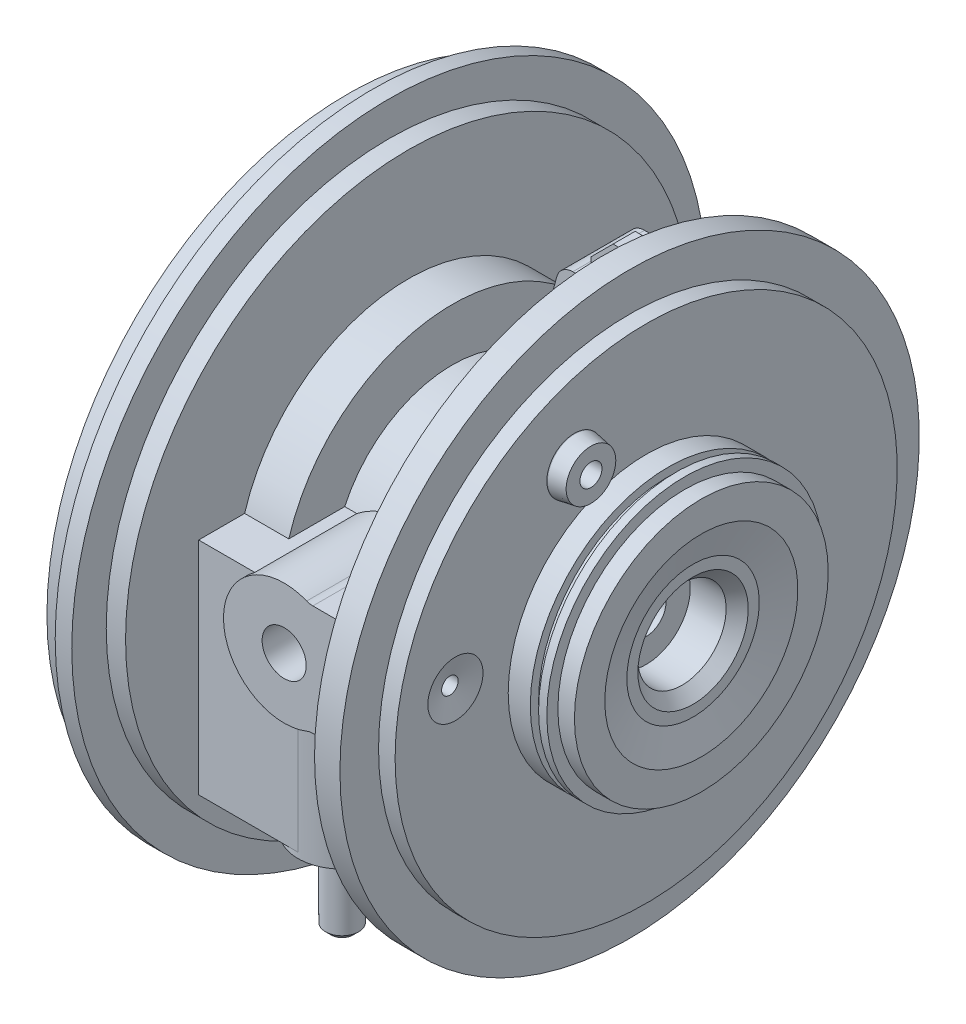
ISO-10303-21;
HEADER;
FILE_DESCRIPTION(('STEP AP214'),'2;1');
FILE_NAME('part.step','',(''),(''),'','','');
FILE_SCHEMA(('AUTOMOTIVE_DESIGN { 1 0 10303 214 1 1 1 1 }'));
ENDSEC;
DATA;
#1=APPLICATION_CONTEXT('core data for automotive mechanical design processes');
#2=APPLICATION_PROTOCOL_DEFINITION('international standard','automotive_design',2000,#1);
#3=PRODUCT_CONTEXT('',#1,'mechanical');
#4=PRODUCT('Part','Part','',(#3));
#5=PRODUCT_RELATED_PRODUCT_CATEGORY('part','',(#4));
#6=PRODUCT_DEFINITION_FORMATION('','',#4);
#7=PRODUCT_DEFINITION_CONTEXT('part definition',#1,'design');
#8=PRODUCT_DEFINITION('design','',#6,#7);
#9=PRODUCT_DEFINITION_SHAPE('','',#8);
#10=(LENGTH_UNIT() NAMED_UNIT(*) SI_UNIT(.MILLI.,.METRE.));
#11=(NAMED_UNIT(*) PLANE_ANGLE_UNIT() SI_UNIT($,.RADIAN.));
#12=(NAMED_UNIT(*) SI_UNIT($,.STERADIAN.) SOLID_ANGLE_UNIT());
#13=UNCERTAINTY_MEASURE_WITH_UNIT(LENGTH_MEASURE(1.E-05),#10,'distance_accuracy_value','');
#14=(GEOMETRIC_REPRESENTATION_CONTEXT(3) GLOBAL_UNCERTAINTY_ASSIGNED_CONTEXT((#13)) GLOBAL_UNIT_ASSIGNED_CONTEXT((#10,
#11,#12)) REPRESENTATION_CONTEXT('',''));
#15=CARTESIAN_POINT('',(0.,0.,0.));
#16=DIRECTION('',(0.,0.,1.));
#17=DIRECTION('',(1.,0.,0.));
#18=AXIS2_PLACEMENT_3D('',#15,#16,#17);
#19=CARTESIAN_POINT('',(-19.6,17.,-18.));
#20=DIRECTION('',(0.,-1.,0.));
#21=DIRECTION('',(1.,0.,0.));
#22=AXIS2_PLACEMENT_3D('',#19,#20,#21);
#23=PLANE('',#22);
#24=DIRECTION('',(-1.,0.,0.));
#25=VECTOR('',#24,1.);
#26=CARTESIAN_POINT('',(-19.6,17.,-19.));
#27=LINE('',#26,#25);
#28=CARTESIAN_POINT('',(-19.6,17.,-19.));
#29=VERTEX_POINT('',#28);
#30=CARTESIAN_POINT('',(-21.0826287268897,17.,-19.));
#31=VERTEX_POINT('',#30);
#32=EDGE_CURVE('E1479',#29,#31,#27,.T.);
#33=ORIENTED_EDGE('',*,*,#32,.F.);
#34=DIRECTION('',(0.,0.,-1.));
#35=VECTOR('',#34,1.);
#36=CARTESIAN_POINT('',(-19.6,17.,-18.));
#37=LINE('',#36,#35);
#38=CARTESIAN_POINT('',(-19.6,17.,-31.));
#39=VERTEX_POINT('',#38);
#40=EDGE_CURVE('E1004',#29,#39,#37,.T.);
#41=ORIENTED_EDGE('',*,*,#40,.T.);
#42=DIRECTION('',(-1.,0.,0.));
#43=VECTOR('',#42,1.);
#44=CARTESIAN_POINT('',(-19.6,17.,-31.));
#45=LINE('',#44,#43);
#46=CARTESIAN_POINT('',(-21.0826287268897,17.,-31.));
#47=VERTEX_POINT('',#46);
#48=EDGE_CURVE('E937',#39,#47,#45,.T.);
#49=ORIENTED_EDGE('',*,*,#48,.T.);
#50=DIRECTION('',(0.,0.,-1.));
#51=VECTOR('',#50,1.);
#52=CARTESIAN_POINT('',(-21.0826287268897,17.,-18.));
#53=LINE('',#52,#51);
#54=EDGE_CURVE('E1041',#31,#47,#53,.T.);
#55=ORIENTED_EDGE('',*,*,#54,.F.);
#56=EDGE_LOOP('',(#33,#41,#49,#55));
#57=FACE_BOUND('',#56,.T.);
#58=ADVANCED_FACE('F33',(#57),#23,.F.);
#59=CARTESIAN_POINT('',(-21.0826287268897,20.,-18.));
#60=DIRECTION('',(0.,0.,-1.));
#61=DIRECTION('',(-1.,0.,0.));
#62=AXIS2_PLACEMENT_3D('',#59,#60,#61);
#63=CYLINDRICAL_SURFACE('',#62,3.);
#64=CARTESIAN_POINT('',(-21.0826287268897,20.,-19.));
#65=DIRECTION('',(0.,0.,1.));
#66=DIRECTION('',(1.,0.,0.));
#67=AXIS2_PLACEMENT_3D('',#64,#65,#66);
#68=CIRCLE('',#67,3.);
#69=CARTESIAN_POINT('',(-23.9804062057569,19.2235428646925,-19.));
#70=VERTEX_POINT('',#69);
#71=EDGE_CURVE('E1484',#31,#70,#68,.F.);
#72=ORIENTED_EDGE('',*,*,#71,.F.);
#73=ORIENTED_EDGE('',*,*,#54,.T.);
#74=CARTESIAN_POINT('',(-21.0826287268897,20.,-31.));
#75=DIRECTION('',(0.,0.,-1.));
#76=DIRECTION('',(-1.,0.,0.));
#77=AXIS2_PLACEMENT_3D('',#74,#75,#76);
#78=CIRCLE('',#77,3.);
#79=CARTESIAN_POINT('',(-23.9804062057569,19.2235428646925,-31.));
#80=VERTEX_POINT('',#79);
#81=EDGE_CURVE('E940',#47,#80,#78,.T.);
#82=ORIENTED_EDGE('',*,*,#81,.T.);
#83=DIRECTION('',(0.,0.,-1.));
#84=VECTOR('',#83,1.);
#85=CARTESIAN_POINT('',(-23.9804062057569,19.2235428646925,-18.));
#86=LINE('',#85,#84);
#87=EDGE_CURVE('E1039',#70,#80,#86,.T.);
#88=ORIENTED_EDGE('',*,*,#87,.F.);
#89=EDGE_LOOP('',(#72,#73,#82,#88));
#90=FACE_BOUND('',#89,.T.);
#91=ADVANCED_FACE('F829',(#90),#63,.F.);
#92=CARTESIAN_POINT('',(-23.9804062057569,19.2235428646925,-18.));
#93=DIRECTION('',(-0.96592582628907,-0.258819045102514,0.));
#94=DIRECTION('',(0.258819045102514,-0.96592582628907,0.));
#95=AXIS2_PLACEMENT_3D('',#92,#93,#94);
#96=PLANE('',#95);
#97=DIRECTION('',(-0.258819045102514,0.96592582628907,0.));
#98=VECTOR('',#97,1.);
#99=CARTESIAN_POINT('',(-23.9804062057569,19.2235428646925,-19.));
#100=LINE('',#99,#98);
#101=CARTESIAN_POINT('',(-26.0042034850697,26.7764571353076,-19.));
#102=VERTEX_POINT('',#101);
#103=EDGE_CURVE('E2510',#70,#102,#100,.T.);
#104=ORIENTED_EDGE('',*,*,#103,.F.);
#105=ORIENTED_EDGE('',*,*,#87,.T.);
#106=DIRECTION('',(-0.258819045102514,0.96592582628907,0.));
#107=VECTOR('',#106,1.);
#108=CARTESIAN_POINT('',(-23.9804062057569,19.2235428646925,-31.));
#109=LINE('',#108,#107);
#110=CARTESIAN_POINT('',(-26.0042034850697,26.7764571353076,-31.));
#111=VERTEX_POINT('',#110);
#112=EDGE_CURVE('E943',#80,#111,#109,.T.);
#113=ORIENTED_EDGE('',*,*,#112,.T.);
#114=DIRECTION('',(0.,0.,-1.));
#115=VECTOR('',#114,1.);
#116=CARTESIAN_POINT('',(-26.0042034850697,26.7764571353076,-18.));
#117=LINE('',#116,#115);
#118=EDGE_CURVE('E1037',#102,#111,#117,.T.);
#119=ORIENTED_EDGE('',*,*,#118,.F.);
#120=EDGE_LOOP('',(#104,#105,#113,#119));
#121=FACE_BOUND('',#120,.T.);
#122=ADVANCED_FACE('F825',(#121),#96,.F.);
#123=CARTESIAN_POINT('',(-28.9019809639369,26.,-18.));
#124=DIRECTION('',(0.,0.,-1.));
#125=DIRECTION('',(-1.,0.,0.));
#126=AXIS2_PLACEMENT_3D('',#123,#124,#125);
#127=CYLINDRICAL_SURFACE('',#126,3.);
#128=CARTESIAN_POINT('',(-28.9019809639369,26.,-19.));
#129=DIRECTION('',(0.,0.,1.));
#130=DIRECTION('',(1.,0.,0.));
#131=AXIS2_PLACEMENT_3D('',#128,#129,#130);
#132=CIRCLE('',#131,3.);
#133=CARTESIAN_POINT('',(-28.9019809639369,29.,-19.));
#134=VERTEX_POINT('',#133);
#135=EDGE_CURVE('E2503',#102,#134,#132,.T.);
#136=ORIENTED_EDGE('',*,*,#135,.F.);
#137=ORIENTED_EDGE('',*,*,#118,.T.);
#138=CARTESIAN_POINT('',(-28.9019809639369,26.,-31.));
#139=DIRECTION('',(0.,0.,1.));
#140=DIRECTION('',(1.,0.,0.));
#141=AXIS2_PLACEMENT_3D('',#138,#139,#140);
#142=CIRCLE('',#141,3.);
#143=CARTESIAN_POINT('',(-28.9019809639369,29.,-31.));
#144=VERTEX_POINT('',#143);
#145=EDGE_CURVE('E946',#111,#144,#142,.T.);
#146=ORIENTED_EDGE('',*,*,#145,.T.);
#147=DIRECTION('',(0.,0.,-1.));
#148=VECTOR('',#147,1.);
#149=CARTESIAN_POINT('',(-28.9019809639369,29.,-18.));
#150=LINE('',#149,#148);
#151=EDGE_CURVE('E1035',#134,#144,#150,.T.);
#152=ORIENTED_EDGE('',*,*,#151,.F.);
#153=EDGE_LOOP('',(#136,#137,#146,#152));
#154=FACE_BOUND('',#153,.T.);
#155=ADVANCED_FACE('F821',(#154),#127,.T.);
#156=CARTESIAN_POINT('',(-10.,25.,0.));
#157=DIRECTION('',(-1.,0.,0.));
#158=DIRECTION('',(0.,0.,1.));
#159=AXIS2_PLACEMENT_3D('',#156,#157,#158);
#160=PLANE('',#159);
#161=CARTESIAN_POINT('',(-10.,5.47568407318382,34.5690162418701));
#162=DIRECTION('',(-1.,0.,0.));
#163=DIRECTION('',(0.,0.,1.));
#164=AXIS2_PLACEMENT_3D('',#161,#162,#163);
#165=CIRCLE('',#164,5.00000000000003);
#166=CARTESIAN_POINT('',(-10.,5.47568407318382,29.5690162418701));
#167=VERTEX_POINT('',#166);
#168=EDGE_CURVE('E11',#167,#167,#165,.T.);
#169=ORIENTED_EDGE('',*,*,#168,.T.);
#170=EDGE_LOOP('',(#169));
#171=FACE_BOUND('',#170,.T.);
#172=CARTESIAN_POINT('',(-10.,0.,0.));
#173=DIRECTION('',(-1.,0.,0.));
#174=DIRECTION('',(0.,0.,1.));
#175=AXIS2_PLACEMENT_3D('',#172,#173,#174);
#176=CIRCLE('',#175,25.);
#177=CARTESIAN_POINT('',(-10.,0.,25.));
#178=VERTEX_POINT('',#177);
#179=EDGE_CURVE('E1284',#178,#178,#176,.T.);
#180=ORIENTED_EDGE('',*,*,#179,.T.);
#181=EDGE_LOOP('',(#180));
#182=FACE_BOUND('',#181,.T.);
#183=CARTESIAN_POINT('',(-10.,0.,0.));
#184=DIRECTION('',(-1.,0.,0.));
#185=DIRECTION('',(0.,0.,1.));
#186=AXIS2_PLACEMENT_3D('',#183,#184,#185);
#187=CIRCLE('',#186,45.5);
#188=CARTESIAN_POINT('',(-10.,0.,45.5));
#189=VERTEX_POINT('',#188);
#190=EDGE_CURVE('E1281',#189,#189,#187,.T.);
#191=ORIENTED_EDGE('',*,*,#190,.F.);
#192=EDGE_LOOP('',(#191));
#193=FACE_BOUND('',#192,.T.);
#194=CARTESIAN_POINT('',(-10.,29.786742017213,13.));
#195=DIRECTION('',(-1.,0.,0.));
#196=DIRECTION('',(0.,0.,1.));
#197=AXIS2_PLACEMENT_3D('',#194,#195,#196);
#198=CIRCLE('',#197,5.);
#199=CARTESIAN_POINT('',(-10.,29.786742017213,18.));
#200=VERTEX_POINT('',#199);
#201=EDGE_CURVE('E2436',#200,#200,#198,.F.);
#202=ORIENTED_EDGE('',*,*,#201,.F.);
#203=EDGE_LOOP('',(#202));
#204=FACE_BOUND('',#203,.T.);
#205=ADVANCED_FACE('F824',(#171,#182,#193,#204),#160,.F.);
#206=CARTESIAN_POINT('',(-19.6,46.5,0.));
#207=DIRECTION('',(1.,0.,0.));
#208=DIRECTION('',(0.,0.,-1.));
#209=AXIS2_PLACEMENT_3D('',#206,#207,#208);
#210=PLANE('',#209);
#211=DIRECTION('',(0.,-1.,0.));
#212=VECTOR('',#211,1.);
#213=CARTESIAN_POINT('',(-19.6,8.99999999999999,-19.));
#214=LINE('',#213,#212);
#215=CARTESIAN_POINT('',(-19.6,30.3775010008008,-19.));
#216=VERTEX_POINT('',#215);
#217=EDGE_CURVE('E2527',#216,#29,#214,.T.);
#218=ORIENTED_EDGE('',*,*,#217,.F.);
#219=DIRECTION('',(0.,0.,-1.));
#220=VECTOR('',#219,1.);
#221=CARTESIAN_POINT('',(-19.6,30.3775010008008,-15.));
#222=LINE('',#221,#220);
#223=CARTESIAN_POINT('',(-19.6,30.3775010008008,-35.2059289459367));
#224=VERTEX_POINT('',#223);
#225=EDGE_CURVE('E457',#216,#224,#222,.T.);
#226=ORIENTED_EDGE('',*,*,#225,.T.);
#227=CARTESIAN_POINT('',(-19.6,0.,0.));
#228=DIRECTION('',(-1.,0.,0.));
#229=DIRECTION('',(0.,0.,1.));
#230=AXIS2_PLACEMENT_3D('',#227,#228,#229);
#231=CIRCLE('',#230,46.5);
#232=CARTESIAN_POINT('',(-19.6,44.0142022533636,-15.));
#233=VERTEX_POINT('',#232);
#234=EDGE_CURVE('E1266',#224,#233,#231,.T.);
#235=ORIENTED_EDGE('',*,*,#234,.T.);
#236=DIRECTION('',(0.,-1.,0.));
#237=VECTOR('',#236,1.);
#238=CARTESIAN_POINT('',(-19.6,46.5,-15.));
#239=LINE('',#238,#237);
#240=CARTESIAN_POINT('',(-19.6,44.,-15.));
#241=VERTEX_POINT('',#240);
#242=EDGE_CURVE('E454',#233,#241,#239,.T.);
#243=ORIENTED_EDGE('',*,*,#242,.T.);
#244=DIRECTION('',(0.,0.,-1.));
#245=VECTOR('',#244,1.);
#246=CARTESIAN_POINT('',(-19.6,44.,-11.));
#247=LINE('',#246,#245);
#248=CARTESIAN_POINT('',(-19.6,44.,-11.));
#249=VERTEX_POINT('',#248);
#250=EDGE_CURVE('E56',#249,#241,#247,.T.);
#251=ORIENTED_EDGE('',*,*,#250,.F.);
#252=DIRECTION('',(0.,-1.,0.));
#253=VECTOR('',#252,1.);
#254=CARTESIAN_POINT('',(-19.6,8.99999999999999,-11.));
#255=LINE('',#254,#253);
#256=CARTESIAN_POINT('',(-19.6,18.4729532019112,-11.));
#257=VERTEX_POINT('',#256);
#258=EDGE_CURVE('E2485',#249,#257,#255,.T.);
#259=ORIENTED_EDGE('',*,*,#258,.T.);
#260=CARTESIAN_POINT('',(-19.6,0.,0.));
#261=DIRECTION('',(-1.,0.,0.));
#262=DIRECTION('',(0.,0.,1.));
#263=AXIS2_PLACEMENT_3D('',#260,#261,#262);
#264=CIRCLE('',#263,21.5);
#265=CARTESIAN_POINT('',(-19.6,10.,19.0328663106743));
#266=VERTEX_POINT('',#265);
#267=EDGE_CURVE('E1263',#266,#257,#264,.T.);
#268=ORIENTED_EDGE('',*,*,#267,.F.);
#269=DIRECTION('',(0.,0.,1.));
#270=VECTOR('',#269,1.);
#271=CARTESIAN_POINT('',(-19.6,10.,-500000.));
#272=LINE('',#271,#270);
#273=CARTESIAN_POINT('',(-19.6,10.,39.));
#274=VERTEX_POINT('',#273);
#275=EDGE_CURVE('E922',#266,#274,#272,.T.);
#276=ORIENTED_EDGE('',*,*,#275,.T.);
#277=DIRECTION('',(0.,-1.,0.));
#278=VECTOR('',#277,1.);
#279=CARTESIAN_POINT('',(-19.6,10.,39.));
#280=LINE('',#279,#278);
#281=CARTESIAN_POINT('',(-19.6,-9.99999999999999,39.));
#282=VERTEX_POINT('',#281);
#283=EDGE_CURVE('E1408',#274,#282,#280,.T.);
#284=ORIENTED_EDGE('',*,*,#283,.T.);
#285=DIRECTION('',(0.,0.,1.));
#286=VECTOR('',#285,1.);
#287=CARTESIAN_POINT('',(-19.6,-10.,-500000.));
#288=LINE('',#287,#286);
#289=CARTESIAN_POINT('',(-19.6,-10.,26.9999999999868));
#290=VERTEX_POINT('',#289);
#291=EDGE_CURVE('E1395',#290,#282,#288,.T.);
#292=ORIENTED_EDGE('',*,*,#291,.F.);
#293=DIRECTION('',(0.,-1.,0.));
#294=VECTOR('',#293,1.);
#295=CARTESIAN_POINT('',(-19.6,9.,27.));
#296=LINE('',#295,#294);
#297=CARTESIAN_POINT('',(-19.6,-31.,27.));
#298=VERTEX_POINT('',#297);
#299=EDGE_CURVE('E1201',#290,#298,#296,.T.);
#300=ORIENTED_EDGE('',*,*,#299,.T.);
#301=DIRECTION('',(0.,0.,-1.));
#302=VECTOR('',#301,1.);
#303=CARTESIAN_POINT('',(-19.6,-31.,27.));
#304=LINE('',#303,#302);
#305=CARTESIAN_POINT('',(-19.6,-31.,-18.));
#306=VERTEX_POINT('',#305);
#307=EDGE_CURVE('E1183',#298,#306,#304,.T.);
#308=ORIENTED_EDGE('',*,*,#307,.T.);
#309=DIRECTION('',(0.,-1.,0.));
#310=VECTOR('',#309,1.);
#311=CARTESIAN_POINT('',(-19.6,9.,-18.));
#312=LINE('',#311,#310);
#313=CARTESIAN_POINT('',(-19.6,-17.,-18.));
#314=VERTEX_POINT('',#313);
#315=EDGE_CURVE('E1199',#314,#306,#312,.T.);
#316=ORIENTED_EDGE('',*,*,#315,.F.);
#317=DIRECTION('',(0.,0.,-1.));
#318=VECTOR('',#317,1.);
#319=CARTESIAN_POINT('',(-19.6,-17.,-18.));
#320=LINE('',#319,#318);
#321=CARTESIAN_POINT('',(-19.6,-17.,-31.));
#322=VERTEX_POINT('',#321);
#323=EDGE_CURVE('E1006',#314,#322,#320,.T.);
#324=ORIENTED_EDGE('',*,*,#323,.T.);
#325=DIRECTION('',(0.,1.,0.));
#326=VECTOR('',#325,1.);
#327=CARTESIAN_POINT('',(-19.6,-17.,-31.));
#328=LINE('',#327,#326);
#329=EDGE_CURVE('E990',#322,#39,#328,.T.);
#330=ORIENTED_EDGE('',*,*,#329,.T.);
#331=ORIENTED_EDGE('',*,*,#40,.F.);
#332=EDGE_LOOP('',(#218,#226,#235,#243,#251,#259,#268,#276,#284,#292,#300,#308,#316,#324,#330,#331));
#333=FACE_BOUND('',#332,.T.);
#334=CARTESIAN_POINT('',(-19.6,29.786742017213,13.));
#335=DIRECTION('',(1.,0.,0.));
#336=DIRECTION('',(0.,0.,-1.));
#337=AXIS2_PLACEMENT_3D('',#334,#335,#336);
#338=CIRCLE('',#337,5.);
#339=CARTESIAN_POINT('',(-19.6,29.786742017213,8.));
#340=VERTEX_POINT('',#339);
#341=EDGE_CURVE('E2439',#340,#340,#338,.F.);
#342=ORIENTED_EDGE('',*,*,#341,.F.);
#343=EDGE_LOOP('',(#342));
#344=FACE_BOUND('',#343,.T.);
#345=ADVANCED_FACE('F841',(#333,#344),#210,.F.);
#346=CARTESIAN_POINT('',(-37.6,-32.,19.9063295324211));
#347=DIRECTION('',(0.,1.,0.));
#348=DIRECTION('',(0.,0.,1.));
#349=AXIS2_PLACEMENT_3D('',#346,#347,#348);
#350=PLANE('',#349);
#351=CARTESIAN_POINT('',(-35.1,-32.,30.));
#352=DIRECTION('',(0.,1.,0.));
#353=DIRECTION('',(0.,0.,1.));
#354=AXIS2_PLACEMENT_3D('',#351,#352,#353);
#355=CIRCLE('',#354,3.);
#356=CARTESIAN_POINT('',(-35.1,-32.,33.));
#357=VERTEX_POINT('',#356);
#358=EDGE_CURVE('E798',#357,#357,#355,.F.);
#359=ORIENTED_EDGE('',*,*,#358,.F.);
#360=EDGE_LOOP('',(#359));
#361=FACE_BOUND('',#360,.T.);
#362=CARTESIAN_POINT('',(-35.1,-32.,-7.49999999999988));
#363=DIRECTION('',(0.,-1.,0.));
#364=DIRECTION('',(0.,0.,-1.));
#365=AXIS2_PLACEMENT_3D('',#362,#363,#364);
#366=CIRCLE('',#365,4.);
#367=CARTESIAN_POINT('',(-35.1,-32.,-11.4999999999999));
#368=VERTEX_POINT('',#367);
#369=EDGE_CURVE('E1500',#368,#368,#366,.T.);
#370=ORIENTED_EDGE('',*,*,#369,.F.);
#371=EDGE_LOOP('',(#370));
#372=FACE_BOUND('',#371,.T.);
#373=CARTESIAN_POINT('',(-35.1,-32.,16.5000000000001));
#374=DIRECTION('',(0.,-1.,0.));
#375=DIRECTION('',(0.,0.,-1.));
#376=AXIS2_PLACEMENT_3D('',#373,#374,#375);
#377=CIRCLE('',#376,4.);
#378=CARTESIAN_POINT('',(-35.1,-32.,12.5000000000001));
#379=VERTEX_POINT('',#378);
#380=EDGE_CURVE('E1506',#379,#379,#377,.T.);
#381=ORIENTED_EDGE('',*,*,#380,.F.);
#382=EDGE_LOOP('',(#381));
#383=FACE_BOUND('',#382,.T.);
#384=CARTESIAN_POINT('',(-37.6,-32.,19.9063295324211));
#385=DIRECTION('',(0.,-1.,0.));
#386=DIRECTION('',(0.,0.,1.));
#387=AXIS2_PLACEMENT_3D('',#384,#385,#386);
#388=CIRCLE('',#387,10.);
#389=CARTESIAN_POINT('',(-46.6630778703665,-32.,24.1325121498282));
#390=VERTEX_POINT('',#389);
#391=CARTESIAN_POINT('',(-47.6,-32.,19.9063295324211));
#392=VERTEX_POINT('',#391);
#393=EDGE_CURVE('E1105',#390,#392,#388,.T.);
#394=ORIENTED_EDGE('',*,*,#393,.T.);
#395=DIRECTION('',(0.,0.,-1.));
#396=VECTOR('',#395,1.);
#397=CARTESIAN_POINT('',(-47.6,-32.,19.9063295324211));
#398=LINE('',#397,#396);
#399=CARTESIAN_POINT('',(-47.6,-32.,-10.906329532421));
#400=VERTEX_POINT('',#399);
#401=EDGE_CURVE('E1108',#392,#400,#398,.T.);
#402=ORIENTED_EDGE('',*,*,#401,.T.);
#403=CARTESIAN_POINT('',(-37.6,-32.,-10.906329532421));
#404=DIRECTION('',(0.,-1.,0.));
#405=DIRECTION('',(0.,0.,1.));
#406=AXIS2_PLACEMENT_3D('',#403,#404,#405);
#407=CIRCLE('',#406,10.);
#408=CARTESIAN_POINT('',(-46.6630778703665,-32.,-15.132512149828));
#409=VERTEX_POINT('',#408);
#410=EDGE_CURVE('E1110',#400,#409,#407,.T.);
#411=ORIENTED_EDGE('',*,*,#410,.T.);
#412=DIRECTION('',(0.422618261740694,0.,-0.906307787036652));
#413=VECTOR('',#412,1.);
#414=CARTESIAN_POINT('',(-46.6630778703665,-32.,-15.132512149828));
#415=LINE('',#414,#413);
#416=CARTESIAN_POINT('',(-42.3504622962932,-32.,-24.3809460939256));
#417=VERTEX_POINT('',#416);
#418=EDGE_CURVE('E1112',#409,#417,#415,.T.);
#419=ORIENTED_EDGE('',*,*,#418,.T.);
#420=CARTESIAN_POINT('',(-35.1,-32.,-21.));
#421=DIRECTION('',(0.,-1.,0.));
#422=DIRECTION('',(0.,0.,-1.));
#423=AXIS2_PLACEMENT_3D('',#420,#421,#422);
#424=CIRCLE('',#423,8.);
#425=CARTESIAN_POINT('',(-27.8495377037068,-32.,-24.3809460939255));
#426=VERTEX_POINT('',#425);
#427=EDGE_CURVE('E1114',#417,#426,#424,.T.);
#428=ORIENTED_EDGE('',*,*,#427,.T.);
#429=DIRECTION('',(0.422618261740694,0.,0.906307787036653));
#430=VECTOR('',#429,1.);
#431=CARTESIAN_POINT('',(-23.5369221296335,-32.,-15.1325121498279));
#432=LINE('',#431,#430);
#433=CARTESIAN_POINT('',(-23.5369221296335,-32.,-15.1325121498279));
#434=VERTEX_POINT('',#433);
#435=EDGE_CURVE('E1116',#426,#434,#432,.T.);
#436=ORIENTED_EDGE('',*,*,#435,.T.);
#437=CARTESIAN_POINT('',(-32.6,-32.,-10.9063295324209));
#438=DIRECTION('',(0.,-1.,0.));
#439=DIRECTION('',(0.,0.,1.));
#440=AXIS2_PLACEMENT_3D('',#437,#438,#439);
#441=CIRCLE('',#440,10.);
#442=CARTESIAN_POINT('',(-22.6,-32.,-10.9063295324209));
#443=VERTEX_POINT('',#442);
#444=EDGE_CURVE('E1118',#434,#443,#441,.T.);
#445=ORIENTED_EDGE('',*,*,#444,.T.);
#446=DIRECTION('',(0.,0.,1.));
#447=VECTOR('',#446,1.);
#448=CARTESIAN_POINT('',(-22.6,-32.,19.9063295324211));
#449=LINE('',#448,#447);
#450=CARTESIAN_POINT('',(-22.6,-32.,19.9063295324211));
#451=VERTEX_POINT('',#450);
#452=EDGE_CURVE('E1120',#443,#451,#449,.T.);
#453=ORIENTED_EDGE('',*,*,#452,.T.);
#454=CARTESIAN_POINT('',(-32.6,-32.,19.9063295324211));
#455=DIRECTION('',(0.,-1.,0.));
#456=DIRECTION('',(0.,0.,1.));
#457=AXIS2_PLACEMENT_3D('',#454,#455,#456);
#458=CIRCLE('',#457,10.);
#459=CARTESIAN_POINT('',(-23.5369221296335,-32.,24.1325121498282));
#460=VERTEX_POINT('',#459);
#461=EDGE_CURVE('E1122',#451,#460,#458,.T.);
#462=ORIENTED_EDGE('',*,*,#461,.T.);
#463=DIRECTION('',(-0.422618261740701,0.,0.906307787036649));
#464=VECTOR('',#463,1.);
#465=CARTESIAN_POINT('',(-23.5369221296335,-32.,24.1325121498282));
#466=LINE('',#465,#464);
#467=CARTESIAN_POINT('',(-27.8495377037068,-32.,33.3809460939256));
#468=VERTEX_POINT('',#467);
#469=EDGE_CURVE('E1124',#460,#468,#466,.T.);
#470=ORIENTED_EDGE('',*,*,#469,.T.);
#471=CARTESIAN_POINT('',(-35.1,-32.,30.));
#472=DIRECTION('',(0.,-1.,0.));
#473=DIRECTION('',(0.,0.,-1.));
#474=AXIS2_PLACEMENT_3D('',#471,#472,#473);
#475=CIRCLE('',#474,8.);
#476=CARTESIAN_POINT('',(-42.3504622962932,-32.,33.3809460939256));
#477=VERTEX_POINT('',#476);
#478=EDGE_CURVE('E1126',#468,#477,#475,.T.);
#479=ORIENTED_EDGE('',*,*,#478,.T.);
#480=DIRECTION('',(-0.4226182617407,0.,-0.90630778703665));
#481=VECTOR('',#480,1.);
#482=CARTESIAN_POINT('',(-46.6630778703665,-32.,24.1325121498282));
#483=LINE('',#482,#481);
#484=EDGE_CURVE('E1128',#477,#390,#483,.T.);
#485=ORIENTED_EDGE('',*,*,#484,.T.);
#486=EDGE_LOOP('',(#394,#402,#411,#419,#428,#436,#445,#453,#462,#470,#479,#485));
#487=FACE_BOUND('',#486,.T.);
#488=CARTESIAN_POINT('',(-35.1,-32.,-21.));
#489=DIRECTION('',(0.,1.,0.));
#490=DIRECTION('',(0.,0.,1.));
#491=AXIS2_PLACEMENT_3D('',#488,#489,#490);
#492=CIRCLE('',#491,3.);
#493=CARTESIAN_POINT('',(-35.1,-32.,-18.));
#494=VERTEX_POINT('',#493);
#495=EDGE_CURVE('E2587',#494,#494,#492,.F.);
#496=ORIENTED_EDGE('',*,*,#495,.F.);
#497=EDGE_LOOP('',(#496));
#498=FACE_BOUND('',#497,.T.);
#499=ADVANCED_FACE('F837',(#361,#372,#383,#487,#498),#350,.F.);
#500=CARTESIAN_POINT('',(-54.6,0.,0.));
#501=DIRECTION('',(-1.,0.,0.));
#502=DIRECTION('',(0.,0.,1.));
#503=AXIS2_PLACEMENT_3D('',#500,#501,#502);
#504=CYLINDRICAL_SURFACE('',#503,21.5);
#505=DIRECTION('',(-1.,0.,0.));
#506=VECTOR('',#505,1.);
#507=CARTESIAN_POINT('',(-54.6,18.4729532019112,-11.));
#508=LINE('',#507,#506);
#509=CARTESIAN_POINT('',(-31.,18.4729532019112,-11.));
#510=VERTEX_POINT('',#509);
#511=EDGE_CURVE('E2457',#257,#510,#508,.T.);
#512=ORIENTED_EDGE('',*,*,#511,.T.);
#513=CARTESIAN_POINT('',(-31.,0.,0.));
#514=DIRECTION('',(-1.,0.,0.));
#515=DIRECTION('',(0.,-1.,0.));
#516=AXIS2_PLACEMENT_3D('',#513,#514,#515);
#517=CIRCLE('',#516,21.5);
#518=CARTESIAN_POINT('',(-31.,11.7579760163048,-18.));
#519=VERTEX_POINT('',#518);
#520=EDGE_CURVE('E1470',#510,#519,#517,.T.);
#521=ORIENTED_EDGE('',*,*,#520,.T.);
#522=DIRECTION('',(-1.,0.,0.));
#523=VECTOR('',#522,1.);
#524=CARTESIAN_POINT('',(-54.6,11.7579760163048,-18.));
#525=LINE('',#524,#523);
#526=CARTESIAN_POINT('',(-45.1,11.7579760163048,-18.));
#527=VERTEX_POINT('',#526);
#528=EDGE_CURVE('E1056',#527,#519,#525,.F.);
#529=ORIENTED_EDGE('',*,*,#528,.F.);
#530=CARTESIAN_POINT('',(-45.1,0.,0.));
#531=DIRECTION('',(-1.,0.,0.));
#532=DIRECTION('',(0.,0.,1.));
#533=AXIS2_PLACEMENT_3D('',#530,#531,#532);
#534=CIRCLE('',#533,21.5);
#535=CARTESIAN_POINT('',(-45.1,9.,19.5256241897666));
#536=VERTEX_POINT('',#535);
#537=EDGE_CURVE('E1260',#536,#527,#534,.T.);
#538=ORIENTED_EDGE('',*,*,#537,.F.);
#539=DIRECTION('',(-1.,0.,0.));
#540=VECTOR('',#539,1.);
#541=CARTESIAN_POINT('',(-54.6,9.,19.5256241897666));
#542=LINE('',#541,#540);
#543=CARTESIAN_POINT('',(-42.9245553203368,9.,19.5256241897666));
#544=VERTEX_POINT('',#543);
#545=EDGE_CURVE('E1215',#536,#544,#542,.F.);
#546=ORIENTED_EDGE('',*,*,#545,.T.);
#547=CARTESIAN_POINT('',(-42.9245553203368,9.,19.5256241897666));
#548=CARTESIAN_POINT('',(-42.6905038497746,9.16448034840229,19.4498097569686));
#549=CARTESIAN_POINT('',(-42.4496482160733,9.32009102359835,19.3755625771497));
#550=CARTESIAN_POINT('',(-41.955255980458,9.6126880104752,19.2320775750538));
#551=CARTESIAN_POINT('',(-41.7017118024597,9.74966300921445,19.162842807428));
#552=CARTESIAN_POINT('',(-41.1820609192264,10.0044390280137,19.0310762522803));
#553=CARTESIAN_POINT('',(-40.9159057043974,10.1221566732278,18.9685739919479));
#554=CARTESIAN_POINT('',(-40.3734272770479,10.3366480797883,18.8525485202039));
#555=CARTESIAN_POINT('',(-40.0971059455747,10.4334256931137,18.7990236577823));
#556=CARTESIAN_POINT('',(-39.5346469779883,10.6054087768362,18.7025422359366));
#557=CARTESIAN_POINT('',(-39.2484717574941,10.6805182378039,18.6596328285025));
#558=CARTESIAN_POINT('',(-38.6694301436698,10.8076506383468,18.586287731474));
#559=CARTESIAN_POINT('',(-38.3765634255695,10.8596724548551,18.5558526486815));
#560=CARTESIAN_POINT('',(-37.7871405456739,10.9397876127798,18.5087334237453));
#561=CARTESIAN_POINT('',(-37.4905941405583,10.9679344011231,18.4920185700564));
#562=CARTESIAN_POINT('',(-36.8957567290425,11.0000553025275,18.4729300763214));
#563=CARTESIAN_POINT('',(-36.5974659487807,11.0040324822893,18.4705546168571));
#564=CARTESIAN_POINT('',(-36.0267775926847,10.9884463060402,18.4798294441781));
#565=CARTESIAN_POINT('',(-35.7543051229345,10.9708279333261,18.4903209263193));
#566=CARTESIAN_POINT('',(-35.2120987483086,10.9154930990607,18.5230408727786));
#567=CARTESIAN_POINT('',(-34.9423650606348,10.8777750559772,18.5452702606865));
#568=CARTESIAN_POINT('',(-34.4076784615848,10.7827382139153,18.6006873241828));
#569=CARTESIAN_POINT('',(-34.142723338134,10.7254287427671,18.6338697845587));
#570=CARTESIAN_POINT('',(-33.6191966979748,10.5918714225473,18.7101084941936));
#571=CARTESIAN_POINT('',(-33.3606222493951,10.5156324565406,18.7531601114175));
#572=CARTESIAN_POINT('',(-33.0065396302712,10.3970212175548,18.8189636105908));
#573=CARTESIAN_POINT('',(-32.907711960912,10.362333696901,18.838092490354));
#574=CARTESIAN_POINT('',(-32.7114788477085,10.2903012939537,18.8775364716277));
#575=CARTESIAN_POINT('',(-32.6140711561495,10.2529613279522,18.8978493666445));
#576=CARTESIAN_POINT('',(-32.5173088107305,10.2142857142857,18.9187305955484));
#577=B_SPLINE_CURVE_WITH_KNOTS('',3,(#547,#548,#549,#550,#551,#552,#553,#554,#555,#556,#557,
#558,#559,#560,#561,#562,#563,#564,#565,#566,#567,#568,#569,#570,#571,#572,#573,#574,#575,#576),
.UNSPECIFIED.,.F.,.F.,(4,2,2,2,2,2,2,2,2,2,2,2,2,2,4),(0.,0.887688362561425,1.77591322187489,
2.66788732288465,3.55969720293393,4.45539995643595,5.35114627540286,6.24488203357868,
7.13850438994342,7.95723275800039,8.77602555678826,9.5944290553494,10.4124492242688,
10.7318242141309,11.0506219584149),.UNSPECIFIED.);
#578=CARTESIAN_POINT('',(-32.5173088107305,10.2142857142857,18.9187305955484));
#579=VERTEX_POINT('',#578);
#580=EDGE_CURVE('E605',#544,#579,#577,.T.);
#581=ORIENTED_EDGE('',*,*,#580,.T.);
#582=CARTESIAN_POINT('',(-32.5173088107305,10.2142857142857,18.9187305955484));
#583=CARTESIAN_POINT('',(-32.4477876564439,10.186484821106,18.9337380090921));
#584=CARTESIAN_POINT('',(-32.3769430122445,10.1611991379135,18.9473129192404));
#585=CARTESIAN_POINT('',(-32.2330486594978,10.1158883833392,18.9715441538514));
#586=CARTESIAN_POINT('',(-32.1599974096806,10.0958670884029,18.9821983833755));
#587=CARTESIAN_POINT('',(-32.0135473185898,10.0616628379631,19.0003500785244));
#588=CARTESIAN_POINT('',(-31.9401777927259,10.0473823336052,19.0079003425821));
#589=CARTESIAN_POINT('',(-31.7923822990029,10.024327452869,19.0200691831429));
#590=CARTESIAN_POINT('',(-31.7179571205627,10.015549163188,19.0246898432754));
#591=CARTESIAN_POINT('',(-31.6035607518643,10.0063896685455,19.029508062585));
#592=CARTESIAN_POINT('',(-31.5637826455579,10.004001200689,19.0307636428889));
#593=CARTESIAN_POINT('',(-31.4839541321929,10.0008023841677,19.03244475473));
#594=CARTESIAN_POINT('',(-31.4439033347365,9.99999966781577,19.0328662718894));
#595=CARTESIAN_POINT('',(-31.4038475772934,10.,19.0328663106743));
#596=B_SPLINE_CURVE_WITH_KNOTS('',3,(#582,#583,#584,#585,#586,#587,#588,#589,#590,#591,#592,
#593,#594,#595),.UNSPECIFIED.,.F.,.F.,(4,2,2,2,2,2,4),(0.,0.229035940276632,0.458235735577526,
0.683357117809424,0.90831820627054,1.02789122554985,1.14803836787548),.UNSPECIFIED.);
#597=CARTESIAN_POINT('',(-31.4038475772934,10.,19.0328663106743));
#598=VERTEX_POINT('',#597);
#599=EDGE_CURVE('E613',#579,#598,#596,.T.);
#600=ORIENTED_EDGE('',*,*,#599,.T.);
#601=DIRECTION('',(-1.,0.,0.));
#602=VECTOR('',#601,1.);
#603=CARTESIAN_POINT('',(-54.6,10.,19.0328663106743));
#604=LINE('',#603,#602);
#605=EDGE_CURVE('E620',#598,#266,#604,.F.);
#606=ORIENTED_EDGE('',*,*,#605,.T.);
#607=ORIENTED_EDGE('',*,*,#267,.T.);
#608=EDGE_LOOP('',(#512,#521,#529,#538,#546,#581,#600,#606,#607));
#609=FACE_BOUND('',#608,.T.);
#610=ADVANCED_FACE('F840',(#609),#504,.T.);
#611=CARTESIAN_POINT('',(-35.1,9.,-21.));
#612=DIRECTION('',(0.,1.,0.));
#613=DIRECTION('',(0.,0.,1.));
#614=AXIS2_PLACEMENT_3D('',#611,#612,#613);
#615=PLANE('',#614);
#616=DIRECTION('',(1.,0.,0.));
#617=VECTOR('',#616,1.);
#618=CARTESIAN_POINT('',(-53.1,9.,38.));
#619=LINE('',#618,#617);
#620=CARTESIAN_POINT('',(-53.1,9.,38.));
#621=VERTEX_POINT('',#620);
#622=CARTESIAN_POINT('',(-42.9245553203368,9.,38.0000000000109));
#623=VERTEX_POINT('',#622);
#624=EDGE_CURVE('E905',#621,#623,#619,.T.);
#625=ORIENTED_EDGE('',*,*,#624,.T.);
#626=DIRECTION('',(0.,0.,1.));
#627=VECTOR('',#626,1.);
#628=CARTESIAN_POINT('',(-42.9245553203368,9.,-500000.));
#629=LINE('',#628,#627);
#630=EDGE_CURVE('E621',#544,#623,#629,.T.);
#631=ORIENTED_EDGE('',*,*,#630,.F.);
#632=ORIENTED_EDGE('',*,*,#545,.F.);
#633=DIRECTION('',(0.,0.,-1.));
#634=VECTOR('',#633,1.);
#635=CARTESIAN_POINT('',(-45.1,9.,0.));
#636=LINE('',#635,#634);
#637=CARTESIAN_POINT('',(-45.1,9.,29.6647939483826));
#638=VERTEX_POINT('',#637);
#639=EDGE_CURVE('E1213',#638,#536,#636,.T.);
#640=ORIENTED_EDGE('',*,*,#639,.F.);
#641=DIRECTION('',(-1.,0.,0.));
#642=VECTOR('',#641,1.);
#643=CARTESIAN_POINT('',(-54.6,9.,29.6647939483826));
#644=LINE('',#643,#642);
#645=CARTESIAN_POINT('',(-53.1,9.,29.6647939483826));
#646=VERTEX_POINT('',#645);
#647=EDGE_CURVE('E1211',#646,#638,#644,.F.);
#648=ORIENTED_EDGE('',*,*,#647,.F.);
#649=DIRECTION('',(0.,0.,-1.));
#650=VECTOR('',#649,1.);
#651=CARTESIAN_POINT('',(-53.1,9.,0.));
#652=LINE('',#651,#650);
#653=EDGE_CURVE('E910',#621,#646,#652,.T.);
#654=ORIENTED_EDGE('',*,*,#653,.F.);
#655=EDGE_LOOP('',(#625,#631,#632,#640,#648,#654));
#656=FACE_BOUND('',#655,.T.);
#657=ADVANCED_FACE('F711',(#656),#615,.T.);
#658=CARTESIAN_POINT('',(-53.1,9.,38.));
#659=DIRECTION('',(0.,0.,-1.));
#660=DIRECTION('',(-1.,0.,0.));
#661=AXIS2_PLACEMENT_3D('',#658,#659,#660);
#662=PLANE('',#661);
#663=CARTESIAN_POINT('',(-36.6,0.,38.0000000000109));
#664=DIRECTION('',(0.,0.,-1.));
#665=DIRECTION('',(-1.,0.,0.));
#666=AXIS2_PLACEMENT_3D('',#663,#664,#665);
#667=CIRCLE('',#666,11.);
#668=CARTESIAN_POINT('',(-35.1,-10.8972473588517,38.));
#669=VERTEX_POINT('',#668);
#670=EDGE_CURVE('E919',#669,#623,#667,.T.);
#671=ORIENTED_EDGE('',*,*,#670,.T.);
#672=ORIENTED_EDGE('',*,*,#624,.F.);
#673=DIRECTION('',(0.,-1.,0.));
#674=VECTOR('',#673,1.);
#675=CARTESIAN_POINT('',(-53.1,9.,38.));
#676=LINE('',#675,#674);
#677=CARTESIAN_POINT('',(-53.1,-31.,38.));
#678=VERTEX_POINT('',#677);
#679=EDGE_CURVE('E1209',#621,#678,#676,.T.);
#680=ORIENTED_EDGE('',*,*,#679,.T.);
#681=DIRECTION('',(1.,0.,0.));
#682=VECTOR('',#681,1.);
#683=CARTESIAN_POINT('',(-53.1,-31.,38.));
#684=LINE('',#683,#682);
#685=CARTESIAN_POINT('',(-35.1,-31.,38.));
#686=VERTEX_POINT('',#685);
#687=EDGE_CURVE('E1173',#678,#686,#684,.T.);
#688=ORIENTED_EDGE('',*,*,#687,.T.);
#689=DIRECTION('',(0.,-1.,0.));
#690=VECTOR('',#689,1.);
#691=CARTESIAN_POINT('',(-35.1,9.,38.));
#692=LINE('',#691,#690);
#693=EDGE_CURVE('E1207',#669,#686,#692,.T.);
#694=ORIENTED_EDGE('',*,*,#693,.F.);
#695=EDGE_LOOP('',(#671,#672,#680,#688,#694));
#696=FACE_BOUND('',#695,.T.);
#697=ADVANCED_FACE('F707',(#696),#662,.F.);
#698=CARTESIAN_POINT('',(-35.1,9.,30.));
#699=DIRECTION('',(0.,-1.,0.));
#700=DIRECTION('',(0.,0.,-1.));
#701=AXIS2_PLACEMENT_3D('',#698,#699,#700);
#702=CYLINDRICAL_SURFACE('',#701,8.);
#703=CARTESIAN_POINT('',(-35.1,-10.,30.));
#704=DIRECTION('',(0.,1.,0.));
#705=DIRECTION('',(0.,0.,1.));
#706=AXIS2_PLACEMENT_3D('',#703,#704,#705);
#707=CIRCLE('',#706,8.);
#708=CARTESIAN_POINT('',(-28.7974563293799,-10.,34.9272652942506));
#709=VERTEX_POINT('',#708);
#710=CARTESIAN_POINT('',(-31.4038475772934,-10.,37.094959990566));
#711=VERTEX_POINT('',#710);
#712=EDGE_CURVE('E934',#709,#711,#707,.F.);
#713=ORIENTED_EDGE('',*,*,#712,.T.);
#714=CARTESIAN_POINT('',(-31.4038475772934,-10.,37.094959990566));
#715=CARTESIAN_POINT('',(-31.4957325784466,-9.99998516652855,37.1428527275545));
#716=CARTESIAN_POINT('',(-31.5886038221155,-10.004223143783,37.1889393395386));
#717=CARTESIAN_POINT('',(-31.7744776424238,-10.021536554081,37.2767631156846));
#718=CARTESIAN_POINT('',(-31.8674705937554,-10.0345276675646,37.318537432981));
#719=CARTESIAN_POINT('',(-32.0535447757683,-10.0696672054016,37.3979279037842));
#720=CARTESIAN_POINT('',(-32.1466260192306,-10.0918172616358,37.4355433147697));
#721=CARTESIAN_POINT('',(-32.3326205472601,-10.1457251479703,37.506778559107));
#722=CARTESIAN_POINT('',(-32.4255236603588,-10.1775730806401,37.5403566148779));
#723=CARTESIAN_POINT('',(-32.5173088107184,-10.2142857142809,37.5716382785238));
#724=B_SPLINE_CURVE_WITH_KNOTS('',3,(#714,#715,#716,#717,#718,#719,#720,#721,#722,#723),
.UNSPECIFIED.,.F.,.F.,(4,2,2,2,4),(0.,0.310803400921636,0.61865482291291,0.92656111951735,
1.23742027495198),.UNSPECIFIED.);
#725=CARTESIAN_POINT('',(-32.5173088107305,-10.2142857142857,37.5716382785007));
#726=VERTEX_POINT('',#725);
#727=EDGE_CURVE('E931',#711,#726,#724,.T.);
#728=ORIENTED_EDGE('',*,*,#727,.T.);
#729=CARTESIAN_POINT('',(-32.5173088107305,-10.2142857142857,37.5716382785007));
#730=CARTESIAN_POINT('',(-32.6867264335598,-10.2820282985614,37.6294456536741));
#731=CARTESIAN_POINT('',(-32.8594458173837,-10.3461509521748,37.6819932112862));
#732=CARTESIAN_POINT('',(-33.2107239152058,-10.4664779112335,37.7758365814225));
#733=CARTESIAN_POINT('',(-33.3892861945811,-10.5226772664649,37.8171253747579));
#734=CARTESIAN_POINT('',(-33.7514899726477,-10.6264552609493,37.8876875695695));
#735=CARTESIAN_POINT('',(-33.9351373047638,-10.674023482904,37.9169465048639));
#736=CARTESIAN_POINT('',(-34.3061284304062,-10.7598505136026,37.9627058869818));
#737=CARTESIAN_POINT('',(-34.4934714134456,-10.7981113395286,37.9792091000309));
#738=CARTESIAN_POINT('',(-34.871333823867,-10.8650205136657,37.9989776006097));
#739=CARTESIAN_POINT('',(-35.0618628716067,-10.8936303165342,38.0021903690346));
#740=CARTESIAN_POINT('',(-35.4439207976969,-10.9407736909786,37.9948873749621));
#741=CARTESIAN_POINT('',(-35.6354497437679,-10.9593065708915,37.9843706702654));
#742=CARTESIAN_POINT('',(-36.0176712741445,-10.9862434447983,37.9495064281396));
#743=CARTESIAN_POINT('',(-36.2083646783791,-10.9946624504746,37.92517946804));
#744=CARTESIAN_POINT('',(-36.5876662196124,-11.0016283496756,37.8628103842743));
#745=CARTESIAN_POINT('',(-36.7762744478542,-11.0001756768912,37.8247688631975));
#746=CARTESIAN_POINT('',(-37.1412908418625,-10.9881206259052,37.7373578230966));
#747=CARTESIAN_POINT('',(-37.3178592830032,-10.9779454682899,37.6885950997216));
#748=CARTESIAN_POINT('',(-37.6667039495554,-10.9495563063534,37.5792781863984));
#749=CARTESIAN_POINT('',(-37.8389786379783,-10.9313394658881,37.5187198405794));
#750=CARTESIAN_POINT('',(-38.1782210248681,-10.8875373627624,37.3863191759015));
#751=CARTESIAN_POINT('',(-38.3451872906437,-10.8619501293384,37.3144738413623));
#752=CARTESIAN_POINT('',(-38.6729491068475,-10.8041947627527,37.1600906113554));
#753=CARTESIAN_POINT('',(-38.8337423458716,-10.7720241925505,37.0775487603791));
#754=CARTESIAN_POINT('',(-39.3263698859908,-10.6622996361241,36.8032965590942));
#755=CARTESIAN_POINT('',(-39.646161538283,-10.5745412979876,36.5936243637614));
#756=CARTESIAN_POINT('',(-40.2496344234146,-10.3817541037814,36.1339654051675));
#757=CARTESIAN_POINT('',(-40.5332790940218,-10.2767080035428,35.8839383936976));
#758=CARTESIAN_POINT('',(-40.9572537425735,-10.1017022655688,35.4538611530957));
#759=CARTESIAN_POINT('',(-41.1100876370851,-10.0341839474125,35.2849425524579));
#760=CARTESIAN_POINT('',(-41.4007299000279,-9.89841941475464,34.9348310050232));
#761=CARTESIAN_POINT('',(-41.5385365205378,-9.83017311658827,34.7536366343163));
#762=CARTESIAN_POINT('',(-41.7982882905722,-9.69531747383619,34.3800282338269));
#763=CARTESIAN_POINT('',(-41.9202545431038,-9.62870604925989,34.1876296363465));
#764=CARTESIAN_POINT('',(-42.1478190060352,-9.49941402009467,33.7921282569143));
#765=CARTESIAN_POINT('',(-42.2534164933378,-9.43673358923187,33.5890250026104));
#766=CARTESIAN_POINT('',(-42.3504622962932,-9.37721618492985,33.3809460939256));
#767=B_SPLINE_CURVE_WITH_KNOTS('',3,(#729,#730,#731,#732,#733,#734,#735,#736,#737,#738,#739,
#740,#741,#742,#743,#744,#745,#746,#747,#748,#749,#750,#751,#752,#753,#754,#755,#756,#757,#758,
#759,#760,#761,#762,#763,#764,#765,#766),.UNSPECIFIED.,.F.,.F.,(4,2,2,2,2,2,2,2,2,2,2,2,2,2,2,2,
2,2,4),(0.,0.574138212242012,1.14863355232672,1.72381772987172,2.29887713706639,
2.87620681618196,3.4535761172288,4.03008738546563,4.60657332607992,5.15633846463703,
5.70629764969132,6.25640402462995,6.80671440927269,7.97888171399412,9.15222539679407,
9.86429593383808,10.5764492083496,11.287643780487,11.9988697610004),.UNSPECIFIED.);
#768=EDGE_CURVE('E926',#726,#669,#767,.T.);
#769=ORIENTED_EDGE('',*,*,#768,.T.);
#770=ORIENTED_EDGE('',*,*,#693,.T.);
#771=CARTESIAN_POINT('',(-35.1,-31.,30.));
#772=DIRECTION('',(0.,1.,0.));
#773=DIRECTION('',(0.,0.,1.));
#774=AXIS2_PLACEMENT_3D('',#771,#772,#773);
#775=CIRCLE('',#774,8.);
#776=CARTESIAN_POINT('',(-42.3504622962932,-31.,33.3809460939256));
#777=VERTEX_POINT('',#776);
#778=EDGE_CURVE('E1341',#686,#777,#775,.F.);
#779=ORIENTED_EDGE('',*,*,#778,.T.);
#780=DIRECTION('',(0.,1.,0.));
#781=VECTOR('',#780,1.);
#782=CARTESIAN_POINT('',(-42.3504622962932,-32.,33.3809460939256));
#783=LINE('',#782,#781);
#784=EDGE_CURVE('E1133',#477,#777,#783,.T.);
#785=ORIENTED_EDGE('',*,*,#784,.F.);
#786=ORIENTED_EDGE('',*,*,#478,.F.);
#787=DIRECTION('',(0.,1.,0.));
#788=VECTOR('',#787,1.);
#789=CARTESIAN_POINT('',(-27.8495377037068,-32.,33.3809460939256));
#790=LINE('',#789,#788);
#791=CARTESIAN_POINT('',(-27.8495377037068,-31.,33.3809460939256));
#792=VERTEX_POINT('',#791);
#793=EDGE_CURVE('E1136',#468,#792,#790,.T.);
#794=ORIENTED_EDGE('',*,*,#793,.T.);
#795=CARTESIAN_POINT('',(-35.1,-31.,30.));
#796=DIRECTION('',(0.,-1.,0.));
#797=DIRECTION('',(0.,0.,-1.));
#798=AXIS2_PLACEMENT_3D('',#795,#796,#797);
#799=CIRCLE('',#798,8.);
#800=CARTESIAN_POINT('',(-28.7974563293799,-31.,34.9272652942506));
#801=VERTEX_POINT('',#800);
#802=EDGE_CURVE('E1099',#792,#801,#799,.T.);
#803=ORIENTED_EDGE('',*,*,#802,.T.);
#804=DIRECTION('',(0.,-1.,0.));
#805=VECTOR('',#804,1.);
#806=CARTESIAN_POINT('',(-28.7974563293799,9.,34.9272652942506));
#807=LINE('',#806,#805);
#808=EDGE_CURVE('E1205',#709,#801,#807,.T.);
#809=ORIENTED_EDGE('',*,*,#808,.F.);
#810=EDGE_LOOP('',(#713,#728,#769,#770,#779,#785,#786,#794,#803,#809));
#811=FACE_BOUND('',#810,.T.);
#812=ADVANCED_FACE('F703',(#811),#702,.T.);
#813=CARTESIAN_POINT('',(-22.6,9.,27.));
#814=DIRECTION('',(-0.787817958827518,0.,-0.615908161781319));
#815=DIRECTION('',(-0.615908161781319,0.,0.787817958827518));
#816=AXIS2_PLACEMENT_3D('',#813,#814,#815);
#817=PLANE('',#816);
#818=DIRECTION('',(-0.615908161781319,0.,0.787817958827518));
#819=VECTOR('',#818,1.);
#820=CARTESIAN_POINT('',(242603.394483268,-10.,-310319.78153879));
#821=LINE('',#820,#819);
#822=CARTESIAN_POINT('',(-22.6,-10.,27.));
#823=VERTEX_POINT('',#822);
#824=EDGE_CURVE('E932',#823,#709,#821,.T.);
#825=ORIENTED_EDGE('',*,*,#824,.T.);
#826=ORIENTED_EDGE('',*,*,#808,.T.);
#827=DIRECTION('',(0.615908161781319,0.,-0.787817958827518));
#828=VECTOR('',#827,1.);
#829=CARTESIAN_POINT('',(-22.6,-31.,27.));
#830=LINE('',#829,#828);
#831=CARTESIAN_POINT('',(-22.6,-31.,27.));
#832=VERTEX_POINT('',#831);
#833=EDGE_CURVE('E1177',#801,#832,#830,.T.);
#834=ORIENTED_EDGE('',*,*,#833,.T.);
#835=DIRECTION('',(0.,-1.,0.));
#836=VECTOR('',#835,1.);
#837=CARTESIAN_POINT('',(-22.6,9.,27.));
#838=LINE('',#837,#836);
#839=EDGE_CURVE('E1203',#823,#832,#838,.T.);
#840=ORIENTED_EDGE('',*,*,#839,.F.);
#841=EDGE_LOOP('',(#825,#826,#834,#840));
#842=FACE_BOUND('',#841,.T.);
#843=ADVANCED_FACE('F699',(#842),#817,.F.);
#844=CARTESIAN_POINT('',(-22.6,9.,27.));
#845=DIRECTION('',(0.,0.,-1.));
#846=DIRECTION('',(-1.,0.,0.));
#847=AXIS2_PLACEMENT_3D('',#844,#845,#846);
#848=PLANE('',#847);
#849=DIRECTION('',(-1.,0.,0.));
#850=VECTOR('',#849,1.);
#851=CARTESIAN_POINT('',(-19.6,-10.,26.9999999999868));
#852=LINE('',#851,#850);
#853=EDGE_CURVE('E935',#290,#823,#852,.T.);
#854=ORIENTED_EDGE('',*,*,#853,.T.);
#855=ORIENTED_EDGE('',*,*,#839,.T.);
#856=DIRECTION('',(1.,0.,0.));
#857=VECTOR('',#856,1.);
#858=CARTESIAN_POINT('',(-22.6,-31.,27.));
#859=LINE('',#858,#857);
#860=EDGE_CURVE('E1180',#832,#298,#859,.T.);
#861=ORIENTED_EDGE('',*,*,#860,.T.);
#862=ORIENTED_EDGE('',*,*,#299,.F.);
#863=EDGE_LOOP('',(#854,#855,#861,#862));
#864=FACE_BOUND('',#863,.T.);
#865=ADVANCED_FACE('F695',(#864),#848,.F.);
#866=CARTESIAN_POINT('',(-54.6,0.,0.));
#867=DIRECTION('',(-1.,0.,0.));
#868=DIRECTION('',(0.,0.,1.));
#869=AXIS2_PLACEMENT_3D('',#866,#867,#868);
#870=CYLINDRICAL_SURFACE('',#869,31.);
#871=CARTESIAN_POINT('',(-51.3705265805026,0.,0.));
#872=DIRECTION('',(0.965925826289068,-0.258819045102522,0.));
#873=DIRECTION('',(-0.258819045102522,-0.965925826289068,0.));
#874=AXIS2_PLACEMENT_3D('',#871,#872,#873);
#875=ELLIPSE('',#874,32.0935615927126,31.);
#876=CARTESIAN_POINT('',(-48.095238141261,12.2235428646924,-28.4883309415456));
#877=VERTEX_POINT('',#876);
#878=CARTESIAN_POINT('',(-45.1,23.4019237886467,-20.3310098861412));
#879=VERTEX_POINT('',#878);
#880=EDGE_CURVE('E1058',#877,#879,#875,.T.);
#881=ORIENTED_EDGE('',*,*,#880,.F.);
#882=CARTESIAN_POINT('',(-53.1,10.8644399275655,-29.033841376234));
#883=CARTESIAN_POINT('',(-53.0430289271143,10.8082188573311,-29.0548796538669));
#884=CARTESIAN_POINT('',(-52.9836096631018,10.7541071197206,-29.0749416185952));
#885=CARTESIAN_POINT('',(-52.8602258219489,10.6505314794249,-29.1130420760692));
#886=CARTESIAN_POINT('',(-52.796260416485,10.6010684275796,-29.1310801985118));
#887=CARTESIAN_POINT('',(-52.6641186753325,10.5072133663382,-29.1650640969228));
#888=CARTESIAN_POINT('',(-52.5959399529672,10.4628242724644,-29.1810086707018));
#889=CARTESIAN_POINT('',(-52.4558758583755,10.3795633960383,-29.2107276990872));
#890=CARTESIAN_POINT('',(-52.3839907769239,10.3406911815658,-29.2245023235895));
#891=CARTESIAN_POINT('',(-52.1632127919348,10.2327948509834,-29.2625319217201));
#892=CARTESIAN_POINT('',(-52.0092956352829,10.1725612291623,-29.2834674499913));
#893=CARTESIAN_POINT('',(-51.6929370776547,10.0781212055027,-29.3161047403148));
#894=CARTESIAN_POINT('',(-51.5305021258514,10.043895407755,-29.327813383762));
#895=CARTESIAN_POINT('',(-51.2059789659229,10.0032193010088,-29.3417118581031));
#896=CARTESIAN_POINT('',(-51.0439867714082,9.99608549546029,-29.3441359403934));
#897=CARTESIAN_POINT('',(-50.7210481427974,10.0079858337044,-29.3400794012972));
#898=CARTESIAN_POINT('',(-50.5601019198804,10.027025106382,-29.3335970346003));
#899=CARTESIAN_POINT('',(-50.2457162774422,10.0901949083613,-29.311926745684));
#900=CARTESIAN_POINT('',(-50.0922130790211,10.1340427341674,-29.2968368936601));
#901=CARTESIAN_POINT('',(-49.7950288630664,10.2450068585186,-29.258217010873));
#902=CARTESIAN_POINT('',(-49.6513470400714,10.3121212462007,-29.2346876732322));
#903=CARTESIAN_POINT('',(-49.3754750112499,10.4683877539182,-29.1790987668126));
#904=CARTESIAN_POINT('',(-49.2434841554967,10.5578485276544,-29.1469191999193));
#905=CARTESIAN_POINT('',(-48.996557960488,10.7551945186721,-29.074676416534));
#906=CARTESIAN_POINT('',(-48.8816255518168,10.8630828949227,-29.0346118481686));
#907=CARTESIAN_POINT('',(-48.6669756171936,11.0984454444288,-28.9454821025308));
#908=CARTESIAN_POINT('',(-48.5680536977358,11.2265318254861,-28.8961202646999));
#909=CARTESIAN_POINT('',(-48.3930009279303,11.494808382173,-28.7904526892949));
#910=CARTESIAN_POINT('',(-48.316875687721,11.6350015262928,-28.7341452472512));
#911=CARTESIAN_POINT('',(-48.1842581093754,11.9327154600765,-28.6118468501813));
#912=CARTESIAN_POINT('',(-48.1293267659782,12.0907711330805,-28.5454674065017));
#913=CARTESIAN_POINT('',(-48.0466179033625,12.4115993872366,-28.4074415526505));
#914=CARTESIAN_POINT('',(-48.0188497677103,12.5743735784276,-28.335793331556));
#915=CARTESIAN_POINT('',(-47.9891042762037,12.91303739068,-28.183159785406));
#916=CARTESIAN_POINT('',(-47.9892534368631,13.0889812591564,-28.1018789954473));
#917=CARTESIAN_POINT('',(-48.0198903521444,13.4371522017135,-27.9370739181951));
#918=CARTESIAN_POINT('',(-48.0503893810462,13.6093778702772,-27.8535488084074));
#919=CARTESIAN_POINT('',(-48.1434701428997,13.9561426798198,-27.6815049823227));
#920=CARTESIAN_POINT('',(-48.2078704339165,14.1301984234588,-27.5929879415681));
#921=CARTESIAN_POINT('',(-48.368359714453,14.4648068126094,-27.4190623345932));
#922=CARTESIAN_POINT('',(-48.4644588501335,14.6253551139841,-27.3336547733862));
#923=CARTESIAN_POINT('',(-48.6868109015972,14.9278239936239,-27.1696442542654));
#924=CARTESIAN_POINT('',(-48.8130077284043,15.0697784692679,-27.0910290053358));
#925=CARTESIAN_POINT('',(-49.0230995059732,15.2646394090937,-26.9814085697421));
#926=CARTESIAN_POINT('',(-49.0966334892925,15.3266047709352,-26.9462383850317));
#927=CARTESIAN_POINT('',(-49.250270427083,15.4437990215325,-26.8792411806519));
#928=CARTESIAN_POINT('',(-49.3303690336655,15.4990323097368,-26.8474119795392));
#929=CARTESIAN_POINT('',(-49.4886596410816,15.5970624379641,-26.7905682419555));
#930=CARTESIAN_POINT('',(-49.5662990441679,15.6405437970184,-26.7651929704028));
#931=CARTESIAN_POINT('',(-49.7259975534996,15.7207800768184,-26.7181442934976));
#932=CARTESIAN_POINT('',(-49.8080538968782,15.757539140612,-26.6964686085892));
#933=CARTESIAN_POINT('',(-49.9759384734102,15.8237711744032,-26.657264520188));
#934=CARTESIAN_POINT('',(-50.0617633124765,15.8532505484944,-26.6397324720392));
#935=CARTESIAN_POINT('',(-50.236438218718,15.9044600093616,-26.6091907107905));
#936=CARTESIAN_POINT('',(-50.3252877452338,15.9261914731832,-26.5961801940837));
#937=CARTESIAN_POINT('',(-50.5691316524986,15.9740248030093,-26.5674961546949));
#938=CARTESIAN_POINT('',(-50.7263292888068,15.9922878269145,-26.5564827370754));
#939=CARTESIAN_POINT('',(-51.0418352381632,16.0037553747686,-26.5495735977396));
#940=CARTESIAN_POINT('',(-51.2001429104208,15.9969733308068,-26.5536697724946));
#941=CARTESIAN_POINT('',(-51.5001288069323,15.9603763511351,-26.5756800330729));
#942=CARTESIAN_POINT('',(-51.642125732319,15.9324432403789,-26.5924649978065));
#943=CARTESIAN_POINT('',(-51.9189771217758,15.8571292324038,-26.6374427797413));
#944=CARTESIAN_POINT('',(-52.0538291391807,15.8097417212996,-26.6656394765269));
#945=CARTESIAN_POINT('',(-52.3183453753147,15.6953786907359,-26.7331188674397));
#946=CARTESIAN_POINT('',(-52.4476162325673,15.6277257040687,-26.7727829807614));
#947=CARTESIAN_POINT('',(-52.6928810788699,15.4761300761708,-26.8606968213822));
#948=CARTESIAN_POINT('',(-52.8088839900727,15.3921984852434,-26.9089407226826));
#949=CARTESIAN_POINT('',(-52.9491517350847,15.2749174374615,-26.9755043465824));
#950=CARTESIAN_POINT('',(-52.9802537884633,15.2477950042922,-26.9908458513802));
#951=CARTESIAN_POINT('',(-53.0411167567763,15.1924793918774,-27.0220201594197));
#952=CARTESIAN_POINT('',(-53.0708800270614,15.1642882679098,-27.0378520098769));
#953=CARTESIAN_POINT('',(-53.1,15.1355600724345,-27.0539243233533));
#954=B_SPLINE_CURVE_WITH_KNOTS('',3,(#882,#883,#884,#885,#886,#887,#888,#889,#890,#891,#892,
#893,#894,#895,#896,#897,#898,#899,#900,#901,#902,#903,#904,#905,#906,#907,#908,#909,#910,#911,
#912,#913,#914,#915,#916,#917,#918,#919,#920,#921,#922,#923,#924,#925,#926,#927,#928,#929,#930,
#931,#932,#933,#934,#935,#936,#937,#938,#939,#940,#941,#942,#943,#944,#945,#946,#947,#948,#949,
#950,#951,#952,#953),.UNSPECIFIED.,.F.,.F.,(4,2,2,2,2,2,2,2,2,2,2,2,2,2,2,2,2,2,2,2,2,2,2,2,2,2,
2,2,2,2,2,2,2,2,2,4),(0.,0.24821506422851,0.49647547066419,0.744877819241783,0.993260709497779,
1.49039232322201,1.98715282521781,2.47129407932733,2.9555302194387,3.4343563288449,
3.91314312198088,4.39894903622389,4.88483831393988,5.39022521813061,5.89573639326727,
6.43347424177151,6.97139778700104,7.55031155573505,8.12944045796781,8.74338622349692,
9.35752869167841,9.97053548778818,10.2773116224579,10.5838861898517,10.8610878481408,
11.1381180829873,11.414903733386,11.691640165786,12.1647235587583,12.6375532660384,
13.0726391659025,13.5078731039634,13.9596881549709,14.4111975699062,14.5432547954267,
14.6750697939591),.UNSPECIFIED.);
#955=CARTESIAN_POINT('',(-50.9930156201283,10.,-29.3428015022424));
#956=VERTEX_POINT('',#955);
#957=EDGE_CURVE('E790',#956,#877,#954,.T.);
#958=ORIENTED_EDGE('',*,*,#957,.F.);
#959=DIRECTION('',(-1.,0.,0.));
#960=VECTOR('',#959,1.);
#961=CARTESIAN_POINT('',(-54.6,10.,-29.3428015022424));
#962=LINE('',#961,#960);
#963=CARTESIAN_POINT('',(-53.1,10.,-29.3428015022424));
#964=VERTEX_POINT('',#963);
#965=EDGE_CURVE('E1066',#964,#956,#962,.F.);
#966=ORIENTED_EDGE('',*,*,#965,.F.);
#967=CARTESIAN_POINT('',(-53.1,0.,0.));
#968=DIRECTION('',(-1.,0.,0.));
#969=DIRECTION('',(0.,0.,1.));
#970=AXIS2_PLACEMENT_3D('',#967,#968,#969);
#971=CIRCLE('',#970,31.);
#972=EDGE_CURVE('E1254',#646,#964,#971,.T.);
#973=ORIENTED_EDGE('',*,*,#972,.F.);
#974=ORIENTED_EDGE('',*,*,#647,.T.);
#975=CARTESIAN_POINT('',(-45.1,0.,0.));
#976=DIRECTION('',(-1.,0.,0.));
#977=DIRECTION('',(0.,0.,1.));
#978=AXIS2_PLACEMENT_3D('',#975,#976,#977);
#979=CIRCLE('',#978,31.);
#980=EDGE_CURVE('E1257',#638,#879,#979,.T.);
#981=ORIENTED_EDGE('',*,*,#980,.T.);
#982=EDGE_LOOP('',(#881,#958,#966,#973,#974,#981));
#983=FACE_BOUND('',#982,.T.);
#984=ADVANCED_FACE('F698',(#983),#870,.T.);
#985=DIRECTION('',(-1.,0.,0.));
#986=VECTOR('',#985,1.);
#987=CARTESIAN_POINT('',(-54.6,-10.,-29.3428015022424));
#988=LINE('',#987,#986);
#989=CARTESIAN_POINT('',(-50.9930156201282,-10.,-29.3428015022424));
#990=VERTEX_POINT('',#989);
#991=CARTESIAN_POINT('',(-53.1,-10.,-29.3428015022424));
#992=VERTEX_POINT('',#991);
#993=EDGE_CURVE('E1063',#990,#992,#988,.T.);
#994=ORIENTED_EDGE('',*,*,#993,.F.);
#995=CARTESIAN_POINT('',(-48.7985384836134,-10.9544511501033,-29.));
#996=CARTESIAN_POINT('',(-48.8532325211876,-10.895762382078,-29.0221697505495));
#997=CARTESIAN_POINT('',(-48.9104782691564,-10.8390811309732,-29.0433762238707));
#998=CARTESIAN_POINT('',(-49.0297447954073,-10.7301812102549,-29.0837854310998));
#999=CARTESIAN_POINT('',(-49.0917665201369,-10.6779634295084,-29.1029877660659));
#1000=CARTESIAN_POINT('',(-49.2202726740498,-10.5784321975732,-29.1393133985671));
#1001=CARTESIAN_POINT('',(-49.2867597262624,-10.5311216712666,-29.1564354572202));
#1002=CARTESIAN_POINT('',(-49.4237115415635,-10.4418805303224,-29.1885144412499));
#1003=CARTESIAN_POINT('',(-49.4941759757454,-10.3999494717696,-29.2034715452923));
#1004=CARTESIAN_POINT('',(-49.7111341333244,-10.2826924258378,-29.2450535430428));
#1005=CARTESIAN_POINT('',(-49.8630850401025,-10.215986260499,-29.2683588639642));
#1006=CARTESIAN_POINT('',(-50.1767660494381,-10.1084183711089,-29.3056846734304));
#1007=CARTESIAN_POINT('',(-50.3384893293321,-10.0675388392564,-29.3197115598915));
#1008=CARTESIAN_POINT('',(-50.6624363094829,-10.0138811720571,-29.338080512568));
#1009=CARTESIAN_POINT('',(-50.8245205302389,-10.0003518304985,-29.3426815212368));
#1010=CARTESIAN_POINT('',(-51.148745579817,-9.99966174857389,-29.342916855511));
#1011=CARTESIAN_POINT('',(-51.310886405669,-10.012499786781,-29.3385515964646));
#1012=CARTESIAN_POINT('',(-51.6281704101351,-10.0636714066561,-29.321037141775));
#1013=CARTESIAN_POINT('',(-51.7833809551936,-10.101632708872,-29.3080161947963));
#1014=CARTESIAN_POINT('',(-52.0850206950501,-10.2012907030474,-29.2734766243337));
#1015=CARTESIAN_POINT('',(-52.2314465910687,-10.2629962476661,-29.2519548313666));
#1016=CARTESIAN_POINT('',(-52.506667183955,-10.4053928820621,-29.201596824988));
#1017=CARTESIAN_POINT('',(-52.6359040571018,-10.4853296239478,-29.1730483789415));
#1018=CARTESIAN_POINT('',(-52.8186379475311,-10.6182365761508,-29.1248222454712));
#1019=CARTESIAN_POINT('',(-52.8777003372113,-10.6647104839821,-29.1078445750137));
#1020=CARTESIAN_POINT('',(-52.9918715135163,-10.7616572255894,-29.072141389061));
#1021=CARTESIAN_POINT('',(-53.0469807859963,-10.8121295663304,-29.0534160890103));
#1022=CARTESIAN_POINT('',(-53.1,-10.8644399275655,-29.033841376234));
#1023=B_SPLINE_CURVE_WITH_KNOTS('',3,(#995,#996,#997,#998,#999,#1000,#1001,#1002,#1003,#1004,
#1005,#1006,#1007,#1008,#1009,#1010,#1011,#1012,#1013,#1014,#1015,#1016,#1017,#1018,#1019,#1020,
#1021,#1022),.UNSPECIFIED.,.F.,.F.,(4,2,2,2,2,2,2,2,2,2,2,2,2,4),(0.,0.249628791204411,
0.499307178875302,0.749133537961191,0.998939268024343,1.49896442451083,1.99864442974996,
2.48440274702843,2.97013856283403,3.44883318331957,3.92770645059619,4.38952651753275,
4.62047681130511,4.85139867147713),.UNSPECIFIED.);
#1024=CARTESIAN_POINT('',(-48.7985384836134,-10.9544511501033,-29.));
#1025=VERTEX_POINT('',#1024);
#1026=EDGE_CURVE('E782',#1025,#990,#1023,.T.);
#1027=ORIENTED_EDGE('',*,*,#1026,.F.);
#1028=DIRECTION('',(-1.,0.,0.));
#1029=VECTOR('',#1028,1.);
#1030=CARTESIAN_POINT('',(-54.6,-10.9544511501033,-29.));
#1031=LINE('',#1030,#1029);
#1032=CARTESIAN_POINT('',(-53.1,-10.9544511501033,-29.));
#1033=VERTEX_POINT('',#1032);
#1034=EDGE_CURVE('E1217',#1033,#1025,#1031,.F.);
#1035=ORIENTED_EDGE('',*,*,#1034,.F.);
#1036=EDGE_CURVE('E1253',#992,#1033,#971,.T.);
#1037=ORIENTED_EDGE('',*,*,#1036,.F.);
#1038=EDGE_LOOP('',(#994,#1027,#1035,#1037));
#1039=FACE_BOUND('',#1038,.T.);
#1040=ADVANCED_FACE('F773',(#1039),#870,.T.);
#1041=CARTESIAN_POINT('',(-53.1,31.,0.));
#1042=DIRECTION('',(-1.,0.,0.));
#1043=DIRECTION('',(0.,0.,1.));
#1044=AXIS2_PLACEMENT_3D('',#1041,#1042,#1043);
#1045=PLANE('',#1044);
#1046=CARTESIAN_POINT('',(-53.1,0.,0.));
#1047=DIRECTION('',(-1.,0.,0.));
#1048=DIRECTION('',(0.,0.,1.));
#1049=AXIS2_PLACEMENT_3D('',#1046,#1047,#1048);
#1050=CIRCLE('',#1049,51.25);
#1051=CARTESIAN_POINT('',(-53.1,0.,51.25));
#1052=VERTEX_POINT('',#1051);
#1053=EDGE_CURVE('E1250',#1052,#1052,#1050,.T.);
#1054=ORIENTED_EDGE('',*,*,#1053,.F.);
#1055=EDGE_LOOP('',(#1054));
#1056=FACE_BOUND('',#1055,.T.);
#1057=DIRECTION('',(0.,0.,1.));
#1058=VECTOR('',#1057,1.);
#1059=CARTESIAN_POINT('',(-53.1,10.,0.));
#1060=LINE('',#1059,#1058);
#1061=CARTESIAN_POINT('',(-53.1,10.,-31.));
#1062=VERTEX_POINT('',#1061);
#1063=EDGE_CURVE('E799',#1062,#964,#1060,.T.);
#1064=ORIENTED_EDGE('',*,*,#1063,.F.);
#1065=DIRECTION('',(0.,-1.,0.));
#1066=VECTOR('',#1065,1.);
#1067=CARTESIAN_POINT('',(-53.1,10.,-31.));
#1068=LINE('',#1067,#1066);
#1069=CARTESIAN_POINT('',(-53.1,-10.,-31.));
#1070=VERTEX_POINT('',#1069);
#1071=EDGE_CURVE('E962',#1062,#1070,#1068,.T.);
#1072=ORIENTED_EDGE('',*,*,#1071,.T.);
#1073=DIRECTION('',(0.,0.,-1.));
#1074=VECTOR('',#1073,1.);
#1075=CARTESIAN_POINT('',(-53.1,-10.,0.));
#1076=LINE('',#1075,#1074);
#1077=EDGE_CURVE('E1456',#992,#1070,#1076,.T.);
#1078=ORIENTED_EDGE('',*,*,#1077,.F.);
#1079=ORIENTED_EDGE('',*,*,#1036,.T.);
#1080=DIRECTION('',(0.,1.,0.));
#1081=VECTOR('',#1080,1.);
#1082=CARTESIAN_POINT('',(-53.1,31.,-29.));
#1083=LINE('',#1082,#1081);
#1084=CARTESIAN_POINT('',(-53.1,-31.,-29.));
#1085=VERTEX_POINT('',#1084);
#1086=EDGE_CURVE('E1337',#1085,#1033,#1083,.T.);
#1087=ORIENTED_EDGE('',*,*,#1086,.F.);
#1088=DIRECTION('',(0.,0.,-1.));
#1089=VECTOR('',#1088,1.);
#1090=CARTESIAN_POINT('',(-53.1,-31.,0.));
#1091=LINE('',#1090,#1089);
#1092=EDGE_CURVE('E1335',#678,#1085,#1091,.T.);
#1093=ORIENTED_EDGE('',*,*,#1092,.F.);
#1094=ORIENTED_EDGE('',*,*,#679,.F.);
#1095=ORIENTED_EDGE('',*,*,#653,.T.);
#1096=ORIENTED_EDGE('',*,*,#972,.T.);
#1097=EDGE_LOOP('',(#1064,#1072,#1078,#1079,#1087,#1093,#1094,#1095,#1096));
#1098=FACE_BOUND('',#1097,.T.);
#1099=ADVANCED_FACE('F770',(#1056,#1098),#1045,.F.);
#1100=CARTESIAN_POINT('',(-45.1,21.5,0.));
#1101=DIRECTION('',(-1.,0.,0.));
#1102=DIRECTION('',(0.,0.,1.));
#1103=AXIS2_PLACEMENT_3D('',#1100,#1101,#1102);
#1104=PLANE('',#1103);
#1105=DIRECTION('',(0.,0.,1.));
#1106=VECTOR('',#1105,1.);
#1107=CARTESIAN_POINT('',(-45.1,23.4019237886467,0.));
#1108=LINE('',#1107,#1106);
#1109=CARTESIAN_POINT('',(-45.1,23.4019237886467,-18.));
#1110=VERTEX_POINT('',#1109);
#1111=EDGE_CURVE('E1454',#879,#1110,#1108,.T.);
#1112=ORIENTED_EDGE('',*,*,#1111,.F.);
#1113=ORIENTED_EDGE('',*,*,#980,.F.);
#1114=ORIENTED_EDGE('',*,*,#639,.T.);
#1115=ORIENTED_EDGE('',*,*,#537,.T.);
#1116=DIRECTION('',(0.,-1.,0.));
#1117=VECTOR('',#1116,1.);
#1118=CARTESIAN_POINT('',(-45.1,21.5,-18.));
#1119=LINE('',#1118,#1117);
#1120=EDGE_CURVE('E1051',#1110,#527,#1119,.T.);
#1121=ORIENTED_EDGE('',*,*,#1120,.F.);
#1122=EDGE_LOOP('',(#1112,#1113,#1114,#1115,#1121));
#1123=FACE_BOUND('',#1122,.T.);
#1124=ADVANCED_FACE('F693',(#1123),#1104,.F.);
#1125=CARTESIAN_POINT('',(-22.6,9.,-18.));
#1126=DIRECTION('',(0.,0.,1.));
#1127=DIRECTION('',(1.,0.,0.));
#1128=AXIS2_PLACEMENT_3D('',#1125,#1126,#1127);
#1129=PLANE('',#1128);
#1130=CARTESIAN_POINT('',(-21.0826287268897,-20.,-18.));
#1131=DIRECTION('',(0.,0.,-1.));
#1132=DIRECTION('',(1.,0.,0.));
#1133=AXIS2_PLACEMENT_3D('',#1130,#1131,#1132);
#1134=CIRCLE('',#1133,3.);
#1135=CARTESIAN_POINT('',(-22.6,-17.4120308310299,-18.));
#1136=VERTEX_POINT('',#1135);
#1137=CARTESIAN_POINT('',(-21.0826287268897,-17.,-18.));
#1138=VERTEX_POINT('',#1137);
#1139=EDGE_CURVE('E1000',#1136,#1138,#1134,.T.);
#1140=ORIENTED_EDGE('',*,*,#1139,.T.);
#1141=DIRECTION('',(1.,0.,0.));
#1142=VECTOR('',#1141,1.);
#1143=CARTESIAN_POINT('',(-19.6,-17.,-18.));
#1144=LINE('',#1143,#1142);
#1145=EDGE_CURVE('E1002',#1138,#314,#1144,.T.);
#1146=ORIENTED_EDGE('',*,*,#1145,.T.);
#1147=ORIENTED_EDGE('',*,*,#315,.T.);
#1148=DIRECTION('',(-1.,0.,0.));
#1149=VECTOR('',#1148,1.);
#1150=CARTESIAN_POINT('',(-22.6,-31.,-18.));
#1151=LINE('',#1150,#1149);
#1152=CARTESIAN_POINT('',(-22.6,-31.,-18.));
#1153=VERTEX_POINT('',#1152);
#1154=EDGE_CURVE('E1186',#306,#1153,#1151,.T.);
#1155=ORIENTED_EDGE('',*,*,#1154,.T.);
#1156=DIRECTION('',(0.,-1.,0.));
#1157=VECTOR('',#1156,1.);
#1158=CARTESIAN_POINT('',(-22.6,9.,-18.));
#1159=LINE('',#1158,#1157);
#1160=EDGE_CURVE('E1197',#1136,#1153,#1159,.T.);
#1161=ORIENTED_EDGE('',*,*,#1160,.F.);
#1162=EDGE_LOOP('',(#1140,#1146,#1147,#1155,#1161));
#1163=FACE_BOUND('',#1162,.T.);
#1164=ADVANCED_FACE('F689',(#1163),#1129,.F.);
#1165=CARTESIAN_POINT('',(-22.6,9.,-18.));
#1166=DIRECTION('',(-0.787817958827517,0.,0.61590816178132));
#1167=DIRECTION('',(0.61590816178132,0.,0.787817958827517));
#1168=AXIS2_PLACEMENT_3D('',#1165,#1166,#1167);
#1169=PLANE('',#1168);
#1170=CARTESIAN_POINT('',(-28.9019809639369,-26.,-26.0609644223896));
#1171=DIRECTION('',(-0.787817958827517,0.,0.61590816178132));
#1172=DIRECTION('',(-0.61590816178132,0.,-0.787817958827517));
#1173=AXIS2_PLACEMENT_3D('',#1170,#1171,#1172);
#1174=ELLIPSE('',#1173,4.87085605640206,3.);
#1175=CARTESIAN_POINT('',(-26.0042034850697,-26.7764571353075,-22.3543710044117));
#1176=VERTEX_POINT('',#1175);
#1177=CARTESIAN_POINT('',(-28.7974563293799,-28.9981785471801,-25.9272652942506));
#1178=VERTEX_POINT('',#1177);
#1179=EDGE_CURVE('E1043',#1176,#1178,#1174,.F.);
#1180=ORIENTED_EDGE('',*,*,#1179,.F.);
#1181=DIRECTION('',(-0.245704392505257,-0.916981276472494,-0.314284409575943));
#1182=VECTOR('',#1181,1.);
#1183=CARTESIAN_POINT('',(-17.4017782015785,5.32823109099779,-11.3508715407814));
#1184=LINE('',#1183,#1182);
#1185=CARTESIAN_POINT('',(-23.9804062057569,-19.2235428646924,-19.7656996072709));
#1186=VERTEX_POINT('',#1185);
#1187=EDGE_CURVE('E1451',#1186,#1176,#1184,.T.);
#1188=ORIENTED_EDGE('',*,*,#1187,.F.);
#1189=CARTESIAN_POINT('',(-21.0826287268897,-20.,-16.059106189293));
#1190=DIRECTION('',(-0.787817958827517,0.,0.61590816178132));
#1191=DIRECTION('',(-0.61590816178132,0.,-0.787817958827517));
#1192=AXIS2_PLACEMENT_3D('',#1189,#1190,#1191);
#1193=ELLIPSE('',#1192,4.87085605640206,3.);
#1194=EDGE_CURVE('E1448',#1136,#1186,#1193,.T.);
#1195=ORIENTED_EDGE('',*,*,#1194,.F.);
#1196=ORIENTED_EDGE('',*,*,#1160,.T.);
#1197=DIRECTION('',(-0.61590816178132,0.,-0.787817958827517));
#1198=VECTOR('',#1197,1.);
#1199=CARTESIAN_POINT('',(-22.6,-31.,-18.));
#1200=LINE('',#1199,#1198);
#1201=CARTESIAN_POINT('',(-28.7974563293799,-31.,-25.9272652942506));
#1202=VERTEX_POINT('',#1201);
#1203=EDGE_CURVE('E1189',#1153,#1202,#1200,.T.);
#1204=ORIENTED_EDGE('',*,*,#1203,.T.);
#1205=DIRECTION('',(0.,-1.,0.));
#1206=VECTOR('',#1205,1.);
#1207=CARTESIAN_POINT('',(-28.7974563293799,9.,-25.9272652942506));
#1208=LINE('',#1207,#1206);
#1209=EDGE_CURVE('E1195',#1178,#1202,#1208,.T.);
#1210=ORIENTED_EDGE('',*,*,#1209,.F.);
#1211=EDGE_LOOP('',(#1180,#1188,#1195,#1196,#1204,#1210));
#1212=FACE_BOUND('',#1211,.T.);
#1213=ADVANCED_FACE('F686',(#1212),#1169,.F.);
#1214=CARTESIAN_POINT('',(-53.1,9.,-29.));
#1215=DIRECTION('',(0.,0.,1.));
#1216=DIRECTION('',(1.,0.,0.));
#1217=AXIS2_PLACEMENT_3D('',#1214,#1215,#1216);
#1218=PLANE('',#1217);
#1219=CARTESIAN_POINT('',(-50.9930156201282,-13.,-29.));
#1220=DIRECTION('',(0.,0.,1.));
#1221=DIRECTION('',(1.,0.,0.));
#1222=AXIS2_PLACEMENT_3D('',#1219,#1220,#1221);
#1223=CIRCLE('',#1222,3.);
#1224=CARTESIAN_POINT('',(-48.095238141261,-12.2235428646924,-29.));
#1225=VERTEX_POINT('',#1224);
#1226=EDGE_CURVE('E1444',#1225,#1025,#1223,.T.);
#1227=ORIENTED_EDGE('',*,*,#1226,.F.);
#1228=DIRECTION('',(-0.258819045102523,0.965925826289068,0.));
#1229=VECTOR('',#1228,1.);
#1230=CARTESIAN_POINT('',(-53.736379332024,8.82948267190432,-29.));
#1231=LINE('',#1230,#1229);
#1232=CARTESIAN_POINT('',(-44.1957965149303,-26.7764571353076,-29.));
#1233=VERTEX_POINT('',#1232);
#1234=EDGE_CURVE('E1440',#1233,#1225,#1231,.T.);
#1235=ORIENTED_EDGE('',*,*,#1234,.F.);
#1236=CARTESIAN_POINT('',(-41.2980190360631,-26.,-29.));
#1237=DIRECTION('',(0.,0.,1.));
#1238=DIRECTION('',(1.,0.,0.));
#1239=AXIS2_PLACEMENT_3D('',#1236,#1237,#1238);
#1240=CIRCLE('',#1239,3.);
#1241=CARTESIAN_POINT('',(-41.2980190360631,-29.,-29.));
#1242=VERTEX_POINT('',#1241);
#1243=EDGE_CURVE('E1438',#1242,#1233,#1240,.F.);
#1244=ORIENTED_EDGE('',*,*,#1243,.F.);
#1245=DIRECTION('',(-1.,0.,0.));
#1246=VECTOR('',#1245,1.);
#1247=CARTESIAN_POINT('',(-53.1,-29.,-29.));
#1248=LINE('',#1247,#1246);
#1249=CARTESIAN_POINT('',(-35.1,-29.,-29.));
#1250=VERTEX_POINT('',#1249);
#1251=EDGE_CURVE('E1045',#1250,#1242,#1248,.T.);
#1252=ORIENTED_EDGE('',*,*,#1251,.F.);
#1253=DIRECTION('',(0.,-1.,0.));
#1254=VECTOR('',#1253,1.);
#1255=CARTESIAN_POINT('',(-35.1,9.,-29.));
#1256=LINE('',#1255,#1254);
#1257=CARTESIAN_POINT('',(-35.1,-31.,-29.));
#1258=VERTEX_POINT('',#1257);
#1259=EDGE_CURVE('E912',#1250,#1258,#1256,.T.);
#1260=ORIENTED_EDGE('',*,*,#1259,.T.);
#1261=DIRECTION('',(-1.,0.,0.));
#1262=VECTOR('',#1261,1.);
#1263=CARTESIAN_POINT('',(-53.1,-31.,-29.));
#1264=LINE('',#1263,#1262);
#1265=EDGE_CURVE('E913',#1258,#1085,#1264,.T.);
#1266=ORIENTED_EDGE('',*,*,#1265,.T.);
#1267=ORIENTED_EDGE('',*,*,#1086,.T.);
#1268=ORIENTED_EDGE('',*,*,#1034,.T.);
#1269=EDGE_LOOP('',(#1227,#1235,#1244,#1252,#1260,#1266,#1267,#1268));
#1270=FACE_BOUND('',#1269,.T.);
#1271=ADVANCED_FACE('F683',(#1270),#1218,.F.);
#1272=CARTESIAN_POINT('',(-35.1,9.,-21.));
#1273=DIRECTION('',(0.,-1.,0.));
#1274=DIRECTION('',(0.,0.,-1.));
#1275=AXIS2_PLACEMENT_3D('',#1272,#1273,#1274);
#1276=CYLINDRICAL_SURFACE('',#1275,8.);
#1277=CARTESIAN_POINT('',(-35.1,-29.,-21.));
#1278=DIRECTION('',(0.,1.,0.));
#1279=DIRECTION('',(-1.,0.,0.));
#1280=AXIS2_PLACEMENT_3D('',#1277,#1278,#1279);
#1281=CIRCLE('',#1280,8.);
#1282=CARTESIAN_POINT('',(-28.9019809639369,-29.,-26.0581182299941));
#1283=VERTEX_POINT('',#1282);
#1284=EDGE_CURVE('E673',#1283,#1250,#1281,.T.);
#1285=ORIENTED_EDGE('',*,*,#1284,.F.);
#1286=CARTESIAN_POINT('',(-27.8495377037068,-28.8093350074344,-24.3809460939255));
#1287=CARTESIAN_POINT('',(-27.932595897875,-28.8404180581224,-24.5590846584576));
#1288=CARTESIAN_POINT('',(-28.0224010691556,-28.8698871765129,-24.7345126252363));
#1289=CARTESIAN_POINT('',(-28.2155835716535,-28.9221518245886,-25.0797133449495));
#1290=CARTESIAN_POINT('',(-28.3190156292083,-28.944919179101,-25.2494596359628));
#1291=CARTESIAN_POINT('',(-28.5403301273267,-28.980256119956,-25.5838269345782));
#1292=CARTESIAN_POINT('',(-28.6583898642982,-28.9926828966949,-25.7483469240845));
#1293=CARTESIAN_POINT('',(-28.9067798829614,-29.0025634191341,-26.0680202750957));
#1294=CARTESIAN_POINT('',(-29.0370852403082,-29.0000469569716,-26.2231916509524));
#1295=CARTESIAN_POINT('',(-29.2442256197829,-28.9812799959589,-26.4517252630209));
#1296=CARTESIAN_POINT('',(-29.3172779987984,-28.972070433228,-26.5291403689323));
#1297=CARTESIAN_POINT('',(-29.4659138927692,-28.9474826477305,-26.6805203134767));
#1298=CARTESIAN_POINT('',(-29.5414974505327,-28.932104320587,-26.7544850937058));
#1299=CARTESIAN_POINT('',(-29.6943337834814,-28.8945371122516,-26.8982829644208));
#1300=CARTESIAN_POINT('',(-29.7715791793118,-28.8723741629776,-26.9681305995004));
#1301=CARTESIAN_POINT('',(-29.9272728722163,-28.8205505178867,-27.1035673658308));
#1302=CARTESIAN_POINT('',(-30.0057209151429,-28.7908913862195,-27.1691573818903));
#1303=CARTESIAN_POINT('',(-30.1639909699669,-28.7230208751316,-27.2965284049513));
#1304=CARTESIAN_POINT('',(-30.243817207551,-28.6846991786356,-27.3582458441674));
#1305=CARTESIAN_POINT('',(-30.4025951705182,-28.5992837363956,-27.4764323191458));
#1306=CARTESIAN_POINT('',(-30.4815474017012,-28.5521953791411,-27.5329045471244));
#1307=CARTESIAN_POINT('',(-30.6373221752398,-28.4489432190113,-27.6402905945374));
#1308=CARTESIAN_POINT('',(-30.714144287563,-28.392777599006,-27.6912032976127));
#1309=CARTESIAN_POINT('',(-30.8641804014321,-28.2713606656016,-27.7871762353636));
#1310=CARTESIAN_POINT('',(-30.937395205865,-28.2061113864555,-27.8322377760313));
#1311=CARTESIAN_POINT('',(-31.0681525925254,-28.0772161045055,-27.9100728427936));
#1312=CARTESIAN_POINT('',(-31.1264027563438,-28.0147860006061,-27.9436764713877));
#1313=CARTESIAN_POINT('',(-31.2382913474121,-27.8838960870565,-28.0065199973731));
#1314=CARTESIAN_POINT('',(-31.2919304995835,-27.815437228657,-28.0357605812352));
#1315=CARTESIAN_POINT('',(-31.3937196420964,-27.6729893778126,-28.0899091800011));
#1316=CARTESIAN_POINT('',(-31.4418720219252,-27.5990028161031,-28.1148190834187));
#1317=CARTESIAN_POINT('',(-31.5319264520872,-27.4461228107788,-28.1604046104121));
#1318=CARTESIAN_POINT('',(-31.5738290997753,-27.3672298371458,-28.1810806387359));
#1319=CARTESIAN_POINT('',(-31.6795040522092,-27.1445013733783,-28.232277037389));
#1320=CARTESIAN_POINT('',(-31.7361948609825,-26.9962237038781,-28.2585950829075));
#1321=CARTESIAN_POINT('',(-31.8256041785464,-26.6911742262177,-28.2993679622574));
#1322=CARTESIAN_POINT('',(-31.8583297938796,-26.5344049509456,-28.3138263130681));
#1323=CARTESIAN_POINT('',(-31.8977658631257,-26.2219873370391,-28.3311761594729));
#1324=CARTESIAN_POINT('',(-31.905256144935,-26.0664566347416,-28.3344144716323));
#1325=CARTESIAN_POINT('',(-31.896085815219,-25.7562505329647,-28.3304133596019));
#1326=CARTESIAN_POINT('',(-31.8794263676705,-25.6015750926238,-28.3231744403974));
#1327=CARTESIAN_POINT('',(-31.8227662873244,-25.2980274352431,-28.2979917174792));
#1328=CARTESIAN_POINT('',(-31.7828474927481,-25.1491368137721,-28.2800854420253));
#1329=CARTESIAN_POINT('',(-31.6814672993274,-24.8607864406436,-28.233030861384));
#1330=CARTESIAN_POINT('',(-31.6200077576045,-24.7213258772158,-28.2038835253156));
#1331=CARTESIAN_POINT('',(-31.4779981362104,-24.4550064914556,-28.1335388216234));
#1332=CARTESIAN_POINT('',(-31.3973666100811,-24.3282048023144,-28.092289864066));
#1333=CARTESIAN_POINT('',(-31.2209026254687,-24.0909510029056,-27.9973289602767));
#1334=CARTESIAN_POINT('',(-31.1250701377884,-23.9804989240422,-27.9436169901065));
#1335=CARTESIAN_POINT('',(-30.9196115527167,-23.7749382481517,-27.8219484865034));
#1336=CARTESIAN_POINT('',(-30.8096646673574,-23.6803711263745,-27.7536221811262));
#1337=CARTESIAN_POINT('',(-30.5831939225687,-23.5113213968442,-27.6043065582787));
#1338=CARTESIAN_POINT('',(-30.4666678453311,-23.4368456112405,-27.5233129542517));
#1339=CARTESIAN_POINT('',(-30.2202156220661,-23.3011270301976,-27.3413987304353));
#1340=CARTESIAN_POINT('',(-30.0900791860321,-23.2418477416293,-27.2393104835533));
#1341=CARTESIAN_POINT('',(-29.8320527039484,-23.1444764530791,-27.0230476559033));
#1342=CARTESIAN_POINT('',(-29.7041633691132,-23.106391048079,-26.9088693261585));
#1343=CARTESIAN_POINT('',(-29.4794129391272,-23.0543163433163,-26.6945615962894));
#1344=CARTESIAN_POINT('',(-29.3815181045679,-23.0370071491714,-26.5962773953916));
#1345=CARTESIAN_POINT('',(-29.1903701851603,-23.0123383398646,-26.3940373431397));
#1346=CARTESIAN_POINT('',(-29.0971195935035,-23.0049840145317,-26.2900785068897));
#1347=CARTESIAN_POINT('',(-28.9157520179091,-22.998654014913,-26.0768835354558));
#1348=CARTESIAN_POINT('',(-28.8276560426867,-22.9997105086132,-25.9676287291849));
#1349=CARTESIAN_POINT('',(-28.6574994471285,-23.0087652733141,-25.7448750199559));
#1350=CARTESIAN_POINT('',(-28.5754375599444,-23.0167620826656,-25.6313770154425));
#1351=CARTESIAN_POINT('',(-28.3722881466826,-23.044470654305,-25.3343155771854));
#1352=CARTESIAN_POINT('',(-28.2558394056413,-23.0682721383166,-25.1479317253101));
#1353=CARTESIAN_POINT('',(-28.0938613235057,-23.1103606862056,-24.8633946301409));
#1354=CARTESIAN_POINT('',(-28.0421849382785,-23.1253745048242,-24.7681529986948));
#1355=CARTESIAN_POINT('',(-27.9428505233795,-23.1569768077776,-24.5758774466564));
#1356=CARTESIAN_POINT('',(-27.8951916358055,-23.1735649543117,-24.4788439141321));
#1357=CARTESIAN_POINT('',(-27.8495377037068,-23.1906649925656,-24.3809460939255));
#1358=B_SPLINE_CURVE_WITH_KNOTS('',3,(#1286,#1287,#1288,#1289,#1290,#1291,#1292,#1293,#1294,
#1295,#1296,#1297,#1298,#1299,#1300,#1301,#1302,#1303,#1304,#1305,#1306,#1307,#1308,#1309,#1310,
#1311,#1312,#1313,#1314,#1315,#1316,#1317,#1318,#1319,#1320,#1321,#1322,#1323,#1324,#1325,#1326,
#1327,#1328,#1329,#1330,#1331,#1332,#1333,#1334,#1335,#1336,#1337,#1338,#1339,#1340,#1341,#1342,
#1343,#1344,#1345,#1346,#1347,#1348,#1349,#1350,#1351,#1352,#1353,#1354,#1355,#1356,#1357),
.UNSPECIFIED.,.F.,.F.,(4,2,2,2,2,2,2,2,2,2,2,2,2,2,2,2,2,2,2,2,2,2,2,2,2,2,2,2,2,2,2,2,2,2,2,4),
(0.,0.597058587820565,1.19659257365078,1.80427517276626,2.41074665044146,2.73104478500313,
3.05134833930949,3.37044261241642,3.68947035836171,4.01281597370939,4.33596349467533,
4.65917578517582,4.98231580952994,5.25719603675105,5.5320329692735,5.80674974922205,
6.08144025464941,6.56156762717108,7.04155256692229,7.50656175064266,7.97154852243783,
8.43490902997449,8.8982295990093,9.36355476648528,9.82888082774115,10.3077788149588,
10.7868392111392,11.3120071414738,11.8373383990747,12.2561583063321,12.6752006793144,
13.0958464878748,13.5164037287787,14.1783766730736,14.5064805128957,14.8345141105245),.UNSPECIFIED.);
#1359=EDGE_CURVE('E665',#1178,#1283,#1358,.T.);
#1360=ORIENTED_EDGE('',*,*,#1359,.F.);
#1361=ORIENTED_EDGE('',*,*,#1209,.T.);
#1362=CARTESIAN_POINT('',(-35.1,-31.,-21.));
#1363=DIRECTION('',(0.,1.,0.));
#1364=DIRECTION('',(0.,0.,1.));
#1365=AXIS2_PLACEMENT_3D('',#1362,#1363,#1364);
#1366=CIRCLE('',#1365,8.);
#1367=CARTESIAN_POINT('',(-27.8495377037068,-31.,-24.3809460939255));
#1368=VERTEX_POINT('',#1367);
#1369=EDGE_CURVE('E674',#1202,#1368,#1366,.F.);
#1370=ORIENTED_EDGE('',*,*,#1369,.T.);
#1371=DIRECTION('',(0.,1.,0.));
#1372=VECTOR('',#1371,1.);
#1373=CARTESIAN_POINT('',(-27.8495377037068,-32.,-24.3809460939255));
#1374=LINE('',#1373,#1372);
#1375=EDGE_CURVE('E1151',#426,#1368,#1374,.T.);
#1376=ORIENTED_EDGE('',*,*,#1375,.F.);
#1377=ORIENTED_EDGE('',*,*,#427,.F.);
#1378=DIRECTION('',(0.,1.,0.));
#1379=VECTOR('',#1378,1.);
#1380=CARTESIAN_POINT('',(-42.3504622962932,-32.,-24.3809460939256));
#1381=LINE('',#1380,#1379);
#1382=CARTESIAN_POINT('',(-42.3504622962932,-31.,-24.3809460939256));
#1383=VERTEX_POINT('',#1382);
#1384=EDGE_CURVE('E1154',#417,#1383,#1381,.T.);
#1385=ORIENTED_EDGE('',*,*,#1384,.T.);
#1386=CARTESIAN_POINT('',(-35.1,-31.,-21.));
#1387=DIRECTION('',(0.,-1.,0.));
#1388=DIRECTION('',(0.,0.,-1.));
#1389=AXIS2_PLACEMENT_3D('',#1386,#1387,#1388);
#1390=CIRCLE('',#1389,8.);
#1391=EDGE_CURVE('E1081',#1383,#1258,#1390,.T.);
#1392=ORIENTED_EDGE('',*,*,#1391,.T.);
#1393=ORIENTED_EDGE('',*,*,#1259,.F.);
#1394=EDGE_LOOP('',(#1285,#1360,#1361,#1370,#1376,#1377,#1385,#1392,#1393));
#1395=FACE_BOUND('',#1394,.T.);
#1396=ADVANCED_FACE('F677',(#1395),#1276,.T.);
#1397=CARTESIAN_POINT('',(-35.1,-31.,-21.));
#1398=DIRECTION('',(0.,1.,0.));
#1399=DIRECTION('',(0.,0.,1.));
#1400=AXIS2_PLACEMENT_3D('',#1397,#1398,#1399);
#1401=PLANE('',#1400);
#1402=ORIENTED_EDGE('',*,*,#1369,.F.);
#1403=ORIENTED_EDGE('',*,*,#1203,.F.);
#1404=ORIENTED_EDGE('',*,*,#1154,.F.);
#1405=ORIENTED_EDGE('',*,*,#307,.F.);
#1406=ORIENTED_EDGE('',*,*,#860,.F.);
#1407=ORIENTED_EDGE('',*,*,#833,.F.);
#1408=ORIENTED_EDGE('',*,*,#802,.F.);
#1409=DIRECTION('',(-0.422618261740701,0.,0.906307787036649));
#1410=VECTOR('',#1409,1.);
#1411=CARTESIAN_POINT('',(-23.5369221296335,-31.,24.1325121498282));
#1412=LINE('',#1411,#1410);
#1413=CARTESIAN_POINT('',(-23.5369221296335,-31.,24.1325121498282));
#1414=VERTEX_POINT('',#1413);
#1415=EDGE_CURVE('E1096',#1414,#792,#1412,.T.);
#1416=ORIENTED_EDGE('',*,*,#1415,.F.);
#1417=CARTESIAN_POINT('',(-32.6,-31.,19.9063295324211));
#1418=DIRECTION('',(0.,-1.,0.));
#1419=DIRECTION('',(0.,0.,1.));
#1420=AXIS2_PLACEMENT_3D('',#1417,#1418,#1419);
#1421=CIRCLE('',#1420,10.);
#1422=CARTESIAN_POINT('',(-22.6,-31.,19.9063295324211));
#1423=VERTEX_POINT('',#1422);
#1424=EDGE_CURVE('E1093',#1423,#1414,#1421,.T.);
#1425=ORIENTED_EDGE('',*,*,#1424,.F.);
#1426=DIRECTION('',(0.,0.,1.));
#1427=VECTOR('',#1426,1.);
#1428=CARTESIAN_POINT('',(-22.6,-31.,19.9063295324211));
#1429=LINE('',#1428,#1427);
#1430=CARTESIAN_POINT('',(-22.6,-31.,-10.9063295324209));
#1431=VERTEX_POINT('',#1430);
#1432=EDGE_CURVE('E1090',#1431,#1423,#1429,.T.);
#1433=ORIENTED_EDGE('',*,*,#1432,.F.);
#1434=CARTESIAN_POINT('',(-32.6,-31.,-10.9063295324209));
#1435=DIRECTION('',(0.,-1.,0.));
#1436=DIRECTION('',(0.,0.,1.));
#1437=AXIS2_PLACEMENT_3D('',#1434,#1435,#1436);
#1438=CIRCLE('',#1437,10.);
#1439=CARTESIAN_POINT('',(-23.5369221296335,-31.,-15.1325121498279));
#1440=VERTEX_POINT('',#1439);
#1441=EDGE_CURVE('E1087',#1440,#1431,#1438,.T.);
#1442=ORIENTED_EDGE('',*,*,#1441,.F.);
#1443=DIRECTION('',(0.422618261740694,0.,0.906307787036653));
#1444=VECTOR('',#1443,1.);
#1445=CARTESIAN_POINT('',(-23.5369221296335,-31.,-15.1325121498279));
#1446=LINE('',#1445,#1444);
#1447=EDGE_CURVE('E1084',#1368,#1440,#1446,.T.);
#1448=ORIENTED_EDGE('',*,*,#1447,.F.);
#1449=EDGE_LOOP('',(#1402,#1403,#1404,#1405,#1406,#1407,#1408,#1416,#1425,#1433,#1442,#1448));
#1450=FACE_BOUND('',#1449,.T.);
#1451=ADVANCED_FACE('F682',(#1450),#1401,.F.);
#1452=ORIENTED_EDGE('',*,*,#1391,.F.);
#1453=DIRECTION('',(0.422618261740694,0.,-0.906307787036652));
#1454=VECTOR('',#1453,1.);
#1455=CARTESIAN_POINT('',(-46.6630778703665,-31.,-15.132512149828));
#1456=LINE('',#1455,#1454);
#1457=CARTESIAN_POINT('',(-46.6630778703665,-31.,-15.132512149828));
#1458=VERTEX_POINT('',#1457);
#1459=EDGE_CURVE('E1078',#1458,#1383,#1456,.T.);
#1460=ORIENTED_EDGE('',*,*,#1459,.F.);
#1461=CARTESIAN_POINT('',(-37.6,-31.,-10.906329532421));
#1462=DIRECTION('',(0.,-1.,0.));
#1463=DIRECTION('',(0.,0.,1.));
#1464=AXIS2_PLACEMENT_3D('',#1461,#1462,#1463);
#1465=CIRCLE('',#1464,10.);
#1466=CARTESIAN_POINT('',(-47.6,-31.,-10.906329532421));
#1467=VERTEX_POINT('',#1466);
#1468=EDGE_CURVE('E1075',#1467,#1458,#1465,.T.);
#1469=ORIENTED_EDGE('',*,*,#1468,.F.);
#1470=DIRECTION('',(0.,0.,-1.));
#1471=VECTOR('',#1470,1.);
#1472=CARTESIAN_POINT('',(-47.6,-31.,19.9063295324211));
#1473=LINE('',#1472,#1471);
#1474=CARTESIAN_POINT('',(-47.6,-31.,19.9063295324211));
#1475=VERTEX_POINT('',#1474);
#1476=EDGE_CURVE('E1072',#1475,#1467,#1473,.T.);
#1477=ORIENTED_EDGE('',*,*,#1476,.F.);
#1478=CARTESIAN_POINT('',(-37.6,-31.,19.9063295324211));
#1479=DIRECTION('',(0.,-1.,0.));
#1480=DIRECTION('',(0.,0.,1.));
#1481=AXIS2_PLACEMENT_3D('',#1478,#1479,#1480);
#1482=CIRCLE('',#1481,10.);
#1483=CARTESIAN_POINT('',(-46.6630778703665,-31.,24.1325121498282));
#1484=VERTEX_POINT('',#1483);
#1485=EDGE_CURVE('E1069',#1484,#1475,#1482,.T.);
#1486=ORIENTED_EDGE('',*,*,#1485,.F.);
#1487=DIRECTION('',(-0.4226182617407,0.,-0.90630778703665));
#1488=VECTOR('',#1487,1.);
#1489=CARTESIAN_POINT('',(-46.6630778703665,-31.,24.1325121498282));
#1490=LINE('',#1489,#1488);
#1491=EDGE_CURVE('E1102',#777,#1484,#1490,.T.);
#1492=ORIENTED_EDGE('',*,*,#1491,.F.);
#1493=ORIENTED_EDGE('',*,*,#778,.F.);
#1494=ORIENTED_EDGE('',*,*,#687,.F.);
#1495=ORIENTED_EDGE('',*,*,#1092,.T.);
#1496=ORIENTED_EDGE('',*,*,#1265,.F.);
#1497=EDGE_LOOP('',(#1452,#1460,#1469,#1477,#1486,#1492,#1493,#1494,#1495,#1496));
#1498=FACE_BOUND('',#1497,.T.);
#1499=ADVANCED_FACE('F892',(#1498),#1401,.F.);
#1500=CARTESIAN_POINT('',(0.,0.,0.));
#1501=DIRECTION('',(-1.,0.,0.));
#1502=DIRECTION('',(0.,0.,1.));
#1503=AXIS2_PLACEMENT_3D('',#1500,#1501,#1502);
#1504=CYLINDRICAL_SURFACE('',#1503,2.5);
#1505=CARTESIAN_POINT('',(-54.6,0.,0.));
#1506=DIRECTION('',(-1.,0.,0.));
#1507=DIRECTION('',(0.,0.,1.));
#1508=AXIS2_PLACEMENT_3D('',#1505,#1506,#1507);
#1509=CIRCLE('',#1508,2.5);
#1510=CARTESIAN_POINT('',(-54.6,0.,2.5));
#1511=VERTEX_POINT('',#1510);
#1512=EDGE_CURVE('E1170',#1511,#1511,#1509,.T.);
#1513=ORIENTED_EDGE('',*,*,#1512,.T.);
#1514=EDGE_LOOP('',(#1513));
#1515=FACE_BOUND('',#1514,.T.);
#1516=CARTESIAN_POINT('',(-25.,0.,0.));
#1517=DIRECTION('',(1.,0.,0.));
#1518=DIRECTION('',(0.,0.,-1.));
#1519=AXIS2_PLACEMENT_3D('',#1516,#1517,#1518);
#1520=CIRCLE('',#1519,2.5);
#1521=CARTESIAN_POINT('',(-25.,0.,-2.5));
#1522=VERTEX_POINT('',#1521);
#1523=EDGE_CURVE('E1169',#1522,#1522,#1520,.F.);
#1524=ORIENTED_EDGE('',*,*,#1523,.F.);
#1525=EDGE_LOOP('',(#1524));
#1526=FACE_BOUND('',#1525,.T.);
#1527=ADVANCED_FACE('F889',(#1515,#1526),#1504,.F.);
#1528=CARTESIAN_POINT('',(-54.6,4.5,0.));
#1529=DIRECTION('',(1.,0.,0.));
#1530=DIRECTION('',(0.,0.,-1.));
#1531=AXIS2_PLACEMENT_3D('',#1528,#1529,#1530);
#1532=PLANE('',#1531);
#1533=ORIENTED_EDGE('',*,*,#1512,.F.);
#1534=EDGE_LOOP('',(#1533));
#1535=FACE_BOUND('',#1534,.T.);
#1536=CARTESIAN_POINT('',(-54.6,0.,0.));
#1537=DIRECTION('',(-1.,0.,0.));
#1538=DIRECTION('',(0.,0.,1.));
#1539=AXIS2_PLACEMENT_3D('',#1536,#1537,#1538);
#1540=CIRCLE('',#1539,4.5);
#1541=CARTESIAN_POINT('',(-54.6,0.,4.5));
#1542=VERTEX_POINT('',#1541);
#1543=EDGE_CURVE('E1220',#1542,#1542,#1540,.T.);
#1544=ORIENTED_EDGE('',*,*,#1543,.T.);
#1545=EDGE_LOOP('',(#1544));
#1546=FACE_BOUND('',#1545,.T.);
#1547=ADVANCED_FACE('F35',(#1535,#1546),#1532,.F.);
#1548=CARTESIAN_POINT('',(-10.,8.,0.));
#1549=DIRECTION('',(-1.,0.,0.));
#1550=DIRECTION('',(0.,0.,1.));
#1551=AXIS2_PLACEMENT_3D('',#1548,#1549,#1550);
#1552=PLANE('',#1551);
#1553=CARTESIAN_POINT('',(-10.,0.,0.));
#1554=DIRECTION('',(-1.,0.,0.));
#1555=DIRECTION('',(0.,0.,1.));
#1556=AXIS2_PLACEMENT_3D('',#1553,#1554,#1555);
#1557=CIRCLE('',#1556,3.6);
#1558=CARTESIAN_POINT('',(-10.,0.,3.6));
#1559=VERTEX_POINT('',#1558);
#1560=EDGE_CURVE('E1174',#1559,#1559,#1557,.T.);
#1561=ORIENTED_EDGE('',*,*,#1560,.T.);
#1562=EDGE_LOOP('',(#1561));
#1563=FACE_BOUND('',#1562,.T.);
#1564=CARTESIAN_POINT('',(-10.,0.,0.));
#1565=DIRECTION('',(-1.,0.,0.));
#1566=DIRECTION('',(0.,0.,1.));
#1567=AXIS2_PLACEMENT_3D('',#1564,#1565,#1566);
#1568=CIRCLE('',#1567,8.);
#1569=CARTESIAN_POINT('',(-10.,0.,8.));
#1570=VERTEX_POINT('',#1569);
#1571=EDGE_CURVE('E1320',#1570,#1570,#1568,.T.);
#1572=ORIENTED_EDGE('',*,*,#1571,.F.);
#1573=EDGE_LOOP('',(#1572));
#1574=FACE_BOUND('',#1573,.T.);
#1575=ADVANCED_FACE('F1594',(#1563,#1574),#1552,.F.);
#1576=CARTESIAN_POINT('',(-54.6,0.,0.));
#1577=DIRECTION('',(-1.,0.,0.));
#1578=DIRECTION('',(0.,0.,1.));
#1579=AXIS2_PLACEMENT_3D('',#1576,#1577,#1578);
#1580=CYLINDRICAL_SURFACE('',#1579,8.);
#1581=CARTESIAN_POINT('',(-3.5,0.,0.));
#1582=DIRECTION('',(-1.,0.,0.));
#1583=DIRECTION('',(0.,0.,1.));
#1584=AXIS2_PLACEMENT_3D('',#1581,#1582,#1583);
#1585=CIRCLE('',#1584,8.);
#1586=CARTESIAN_POINT('',(-3.5,0.,8.));
#1587=VERTEX_POINT('',#1586);
#1588=EDGE_CURVE('E1317',#1587,#1587,#1585,.T.);
#1589=ORIENTED_EDGE('',*,*,#1588,.F.);
#1590=EDGE_LOOP('',(#1589));
#1591=FACE_BOUND('',#1590,.T.);
#1592=ORIENTED_EDGE('',*,*,#1571,.T.);
#1593=EDGE_LOOP('',(#1592));
#1594=FACE_BOUND('',#1593,.T.);
#1595=ADVANCED_FACE('F1602',(#1591,#1594),#1580,.F.);
#1596=CARTESIAN_POINT('',(-3.5,0.,0.));
#1597=DIRECTION('',(1.,0.,0.));
#1598=DIRECTION('',(0.,0.,-1.));
#1599=AXIS2_PLACEMENT_3D('',#1596,#1597,#1598);
#1600=CONICAL_SURFACE('',#1599,8.,0.78539816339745);
#1601=CARTESIAN_POINT('',(-1.5,0.,0.));
#1602=DIRECTION('',(-1.,0.,0.));
#1603=DIRECTION('',(0.,0.,1.));
#1604=AXIS2_PLACEMENT_3D('',#1601,#1602,#1603);
#1605=CIRCLE('',#1604,10.);
#1606=CARTESIAN_POINT('',(-1.5,0.,10.));
#1607=VERTEX_POINT('',#1606);
#1608=EDGE_CURVE('E1314',#1607,#1607,#1605,.T.);
#1609=ORIENTED_EDGE('',*,*,#1608,.F.);
#1610=EDGE_LOOP('',(#1609));
#1611=FACE_BOUND('',#1610,.T.);
#1612=ORIENTED_EDGE('',*,*,#1588,.T.);
#1613=EDGE_LOOP('',(#1612));
#1614=FACE_BOUND('',#1613,.T.);
#1615=ADVANCED_FACE('F1608',(#1611,#1614),#1600,.F.);
#1616=CARTESIAN_POINT('',(-1.5,12.,0.));
#1617=DIRECTION('',(-1.,0.,0.));
#1618=DIRECTION('',(0.,0.,1.));
#1619=AXIS2_PLACEMENT_3D('',#1616,#1617,#1618);
#1620=PLANE('',#1619);
#1621=CARTESIAN_POINT('',(-1.5,0.,0.));
#1622=DIRECTION('',(-1.,0.,0.));
#1623=DIRECTION('',(0.,0.,1.));
#1624=AXIS2_PLACEMENT_3D('',#1621,#1622,#1623);
#1625=CIRCLE('',#1624,12.);
#1626=CARTESIAN_POINT('',(-1.5,0.,12.));
#1627=VERTEX_POINT('',#1626);
#1628=EDGE_CURVE('E1311',#1627,#1627,#1625,.T.);
#1629=ORIENTED_EDGE('',*,*,#1628,.F.);
#1630=EDGE_LOOP('',(#1629));
#1631=FACE_BOUND('',#1630,.T.);
#1632=ORIENTED_EDGE('',*,*,#1608,.T.);
#1633=EDGE_LOOP('',(#1632));
#1634=FACE_BOUND('',#1633,.T.);
#1635=ADVANCED_FACE('F1616',(#1631,#1634),#1620,.F.);
#1636=CARTESIAN_POINT('',(-1.5,0.,0.));
#1637=DIRECTION('',(1.,0.,0.));
#1638=DIRECTION('',(0.,0.,-1.));
#1639=AXIS2_PLACEMENT_3D('',#1636,#1637,#1638);
#1640=CONICAL_SURFACE('',#1639,12.,1.30454427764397);
#1641=CARTESIAN_POINT('',(0.,0.,0.));
#1642=DIRECTION('',(-1.,0.,0.));
#1643=DIRECTION('',(0.,0.,1.));
#1644=AXIS2_PLACEMENT_3D('',#1641,#1642,#1643);
#1645=CIRCLE('',#1644,17.5);
#1646=CARTESIAN_POINT('',(0.,0.,17.5));
#1647=VERTEX_POINT('',#1646);
#1648=EDGE_CURVE('E1308',#1647,#1647,#1645,.T.);
#1649=ORIENTED_EDGE('',*,*,#1648,.F.);
#1650=EDGE_LOOP('',(#1649));
#1651=FACE_BOUND('',#1650,.T.);
#1652=ORIENTED_EDGE('',*,*,#1628,.T.);
#1653=EDGE_LOOP('',(#1652));
#1654=FACE_BOUND('',#1653,.T.);
#1655=ADVANCED_FACE('F1624',(#1651,#1654),#1640,.F.);
#1656=CARTESIAN_POINT('',(0.,17.5,0.));
#1657=DIRECTION('',(-1.,0.,0.));
#1658=DIRECTION('',(0.,0.,1.));
#1659=AXIS2_PLACEMENT_3D('',#1656,#1657,#1658);
#1660=PLANE('',#1659);
#1661=CARTESIAN_POINT('',(0.,0.,0.));
#1662=DIRECTION('',(-1.,0.,0.));
#1663=DIRECTION('',(0.,0.,1.));
#1664=AXIS2_PLACEMENT_3D('',#1661,#1662,#1663);
#1665=CIRCLE('',#1664,23.);
#1666=CARTESIAN_POINT('',(0.,0.,23.));
#1667=VERTEX_POINT('',#1666);
#1668=EDGE_CURVE('E1305',#1667,#1667,#1665,.T.);
#1669=ORIENTED_EDGE('',*,*,#1668,.F.);
#1670=EDGE_LOOP('',(#1669));
#1671=FACE_BOUND('',#1670,.T.);
#1672=ORIENTED_EDGE('',*,*,#1648,.T.);
#1673=EDGE_LOOP('',(#1672));
#1674=FACE_BOUND('',#1673,.T.);
#1675=ADVANCED_FACE('F1632',(#1671,#1674),#1660,.F.);
#1676=CARTESIAN_POINT('',(-54.6,0.,0.));
#1677=DIRECTION('',(-1.,0.,0.));
#1678=DIRECTION('',(0.,0.,1.));
#1679=AXIS2_PLACEMENT_3D('',#1676,#1677,#1678);
#1680=CYLINDRICAL_SURFACE('',#1679,23.);
#1681=CARTESIAN_POINT('',(-3.,0.,0.));
#1682=DIRECTION('',(-1.,0.,0.));
#1683=DIRECTION('',(0.,0.,1.));
#1684=AXIS2_PLACEMENT_3D('',#1681,#1682,#1683);
#1685=CIRCLE('',#1684,23.);
#1686=CARTESIAN_POINT('',(-3.,0.,23.));
#1687=VERTEX_POINT('',#1686);
#1688=EDGE_CURVE('E1302',#1687,#1687,#1685,.T.);
#1689=ORIENTED_EDGE('',*,*,#1688,.F.);
#1690=EDGE_LOOP('',(#1689));
#1691=FACE_BOUND('',#1690,.T.);
#1692=ORIENTED_EDGE('',*,*,#1668,.T.);
#1693=EDGE_LOOP('',(#1692));
#1694=FACE_BOUND('',#1693,.T.);
#1695=ADVANCED_FACE('F1640',(#1691,#1694),#1680,.T.);
#1696=CARTESIAN_POINT('',(-3.,23.,0.));
#1697=DIRECTION('',(-1.,0.,0.));
#1698=DIRECTION('',(0.,0.,1.));
#1699=AXIS2_PLACEMENT_3D('',#1696,#1697,#1698);
#1700=PLANE('',#1699);
#1701=CARTESIAN_POINT('',(-3.,0.,0.));
#1702=DIRECTION('',(-1.,0.,0.));
#1703=DIRECTION('',(0.,0.,1.));
#1704=AXIS2_PLACEMENT_3D('',#1701,#1702,#1703);
#1705=CIRCLE('',#1704,25.);
#1706=CARTESIAN_POINT('',(-3.,0.,25.));
#1707=VERTEX_POINT('',#1706);
#1708=EDGE_CURVE('E1299',#1707,#1707,#1705,.T.);
#1709=ORIENTED_EDGE('',*,*,#1708,.F.);
#1710=EDGE_LOOP('',(#1709));
#1711=FACE_BOUND('',#1710,.T.);
#1712=ORIENTED_EDGE('',*,*,#1688,.T.);
#1713=EDGE_LOOP('',(#1712));
#1714=FACE_BOUND('',#1713,.T.);
#1715=ADVANCED_FACE('F1648',(#1711,#1714),#1700,.F.);
#1716=CARTESIAN_POINT('',(-54.6,0.,0.));
#1717=DIRECTION('',(-1.,0.,0.));
#1718=DIRECTION('',(0.,0.,1.));
#1719=AXIS2_PLACEMENT_3D('',#1716,#1717,#1718);
#1720=CYLINDRICAL_SURFACE('',#1719,25.);
#1721=CARTESIAN_POINT('',(-4.5,0.,0.));
#1722=DIRECTION('',(-1.,0.,0.));
#1723=DIRECTION('',(0.,0.,1.));
#1724=AXIS2_PLACEMENT_3D('',#1721,#1722,#1723);
#1725=CIRCLE('',#1724,25.);
#1726=CARTESIAN_POINT('',(-4.5,0.,25.));
#1727=VERTEX_POINT('',#1726);
#1728=EDGE_CURVE('E1296',#1727,#1727,#1725,.T.);
#1729=ORIENTED_EDGE('',*,*,#1728,.F.);
#1730=EDGE_LOOP('',(#1729));
#1731=FACE_BOUND('',#1730,.T.);
#1732=ORIENTED_EDGE('',*,*,#1708,.T.);
#1733=EDGE_LOOP('',(#1732));
#1734=FACE_BOUND('',#1733,.T.);
#1735=ADVANCED_FACE('F1656',(#1731,#1734),#1720,.T.);
#1736=CARTESIAN_POINT('',(-4.5,25.,0.));
#1737=DIRECTION('',(1.,0.,0.));
#1738=DIRECTION('',(0.,0.,-1.));
#1739=AXIS2_PLACEMENT_3D('',#1736,#1737,#1738);
#1740=PLANE('',#1739);
#1741=CARTESIAN_POINT('',(-4.5,0.,0.));
#1742=DIRECTION('',(-1.,0.,0.));
#1743=DIRECTION('',(0.,0.,1.));
#1744=AXIS2_PLACEMENT_3D('',#1741,#1742,#1743);
#1745=CIRCLE('',#1744,23.5);
#1746=CARTESIAN_POINT('',(-4.5,0.,23.5));
#1747=VERTEX_POINT('',#1746);
#1748=EDGE_CURVE('E1293',#1747,#1747,#1745,.T.);
#1749=ORIENTED_EDGE('',*,*,#1748,.F.);
#1750=EDGE_LOOP('',(#1749));
#1751=FACE_BOUND('',#1750,.T.);
#1752=ORIENTED_EDGE('',*,*,#1728,.T.);
#1753=EDGE_LOOP('',(#1752));
#1754=FACE_BOUND('',#1753,.T.);
#1755=ADVANCED_FACE('F1664',(#1751,#1754),#1740,.F.);
#1756=CARTESIAN_POINT('',(-54.6,0.,0.));
#1757=DIRECTION('',(-1.,0.,0.));
#1758=DIRECTION('',(0.,0.,1.));
#1759=AXIS2_PLACEMENT_3D('',#1756,#1757,#1758);
#1760=CYLINDRICAL_SURFACE('',#1759,23.5);
#1761=CARTESIAN_POINT('',(-6.00000000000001,0.,0.));
#1762=DIRECTION('',(-1.,0.,0.));
#1763=DIRECTION('',(0.,0.,1.));
#1764=AXIS2_PLACEMENT_3D('',#1761,#1762,#1763);
#1765=CIRCLE('',#1764,23.5);
#1766=CARTESIAN_POINT('',(-6.00000000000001,0.,23.5));
#1767=VERTEX_POINT('',#1766);
#1768=EDGE_CURVE('E1290',#1767,#1767,#1765,.T.);
#1769=ORIENTED_EDGE('',*,*,#1768,.F.);
#1770=EDGE_LOOP('',(#1769));
#1771=FACE_BOUND('',#1770,.T.);
#1772=ORIENTED_EDGE('',*,*,#1748,.T.);
#1773=EDGE_LOOP('',(#1772));
#1774=FACE_BOUND('',#1773,.T.);
#1775=ADVANCED_FACE('F1672',(#1771,#1774),#1760,.T.);
#1776=CARTESIAN_POINT('',(-6.00000000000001,23.5,0.));
#1777=DIRECTION('',(-1.,0.,0.));
#1778=DIRECTION('',(0.,0.,1.));
#1779=AXIS2_PLACEMENT_3D('',#1776,#1777,#1778);
#1780=PLANE('',#1779);
#1781=CARTESIAN_POINT('',(-6.00000000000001,0.,0.));
#1782=DIRECTION('',(-1.,0.,0.));
#1783=DIRECTION('',(0.,0.,1.));
#1784=AXIS2_PLACEMENT_3D('',#1781,#1782,#1783);
#1785=CIRCLE('',#1784,25.);
#1786=CARTESIAN_POINT('',(-6.00000000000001,0.,25.));
#1787=VERTEX_POINT('',#1786);
#1788=EDGE_CURVE('E1287',#1787,#1787,#1785,.T.);
#1789=ORIENTED_EDGE('',*,*,#1788,.F.);
#1790=EDGE_LOOP('',(#1789));
#1791=FACE_BOUND('',#1790,.T.);
#1792=ORIENTED_EDGE('',*,*,#1768,.T.);
#1793=EDGE_LOOP('',(#1792));
#1794=FACE_BOUND('',#1793,.T.);
#1795=ADVANCED_FACE('F1680',(#1791,#1794),#1780,.F.);
#1796=CARTESIAN_POINT('',(-54.6,0.,0.));
#1797=DIRECTION('',(-1.,0.,0.));
#1798=DIRECTION('',(0.,0.,1.));
#1799=AXIS2_PLACEMENT_3D('',#1796,#1797,#1798);
#1800=CYLINDRICAL_SURFACE('',#1799,25.);
#1801=ORIENTED_EDGE('',*,*,#179,.F.);
#1802=EDGE_LOOP('',(#1801));
#1803=FACE_BOUND('',#1802,.T.);
#1804=ORIENTED_EDGE('',*,*,#1788,.T.);
#1805=EDGE_LOOP('',(#1804));
#1806=FACE_BOUND('',#1805,.T.);
#1807=ADVANCED_FACE('F1688',(#1803,#1806),#1800,.T.);
#1808=CARTESIAN_POINT('',(-54.6,0.,0.));
#1809=DIRECTION('',(-1.,0.,0.));
#1810=DIRECTION('',(0.,0.,1.));
#1811=AXIS2_PLACEMENT_3D('',#1808,#1809,#1810);
#1812=CYLINDRICAL_SURFACE('',#1811,45.5);
#1813=CARTESIAN_POINT('',(-13.,0.,0.));
#1814=DIRECTION('',(-1.,0.,0.));
#1815=DIRECTION('',(0.,0.,1.));
#1816=AXIS2_PLACEMENT_3D('',#1813,#1814,#1815);
#1817=CIRCLE('',#1816,45.5);
#1818=CARTESIAN_POINT('',(-13.,0.,45.5));
#1819=VERTEX_POINT('',#1818);
#1820=EDGE_CURVE('E1278',#1819,#1819,#1817,.T.);
#1821=ORIENTED_EDGE('',*,*,#1820,.F.);
#1822=EDGE_LOOP('',(#1821));
#1823=FACE_BOUND('',#1822,.T.);
#1824=ORIENTED_EDGE('',*,*,#190,.T.);
#1825=EDGE_LOOP('',(#1824));
#1826=FACE_BOUND('',#1825,.T.);
#1827=ADVANCED_FACE('F1696',(#1823,#1826),#1812,.T.);
#1828=CARTESIAN_POINT('',(-13.,45.5,0.));
#1829=DIRECTION('',(-1.,0.,0.));
#1830=DIRECTION('',(0.,0.,1.));
#1831=AXIS2_PLACEMENT_3D('',#1828,#1829,#1830);
#1832=PLANE('',#1831);
#1833=CARTESIAN_POINT('',(-13.,0.,0.));
#1834=DIRECTION('',(-1.,0.,0.));
#1835=DIRECTION('',(0.,0.,1.));
#1836=AXIS2_PLACEMENT_3D('',#1833,#1834,#1835);
#1837=CIRCLE('',#1836,52.5);
#1838=CARTESIAN_POINT('',(-13.,0.,52.5));
#1839=VERTEX_POINT('',#1838);
#1840=EDGE_CURVE('E1275',#1839,#1839,#1837,.T.);
#1841=ORIENTED_EDGE('',*,*,#1840,.F.);
#1842=EDGE_LOOP('',(#1841));
#1843=FACE_BOUND('',#1842,.T.);
#1844=ORIENTED_EDGE('',*,*,#1820,.T.);
#1845=EDGE_LOOP('',(#1844));
#1846=FACE_BOUND('',#1845,.T.);
#1847=ADVANCED_FACE('F1704',(#1843,#1846),#1832,.F.);
#1848=CARTESIAN_POINT('',(-54.6,0.,0.));
#1849=DIRECTION('',(-1.,0.,0.));
#1850=DIRECTION('',(0.,0.,1.));
#1851=AXIS2_PLACEMENT_3D('',#1848,#1849,#1850);
#1852=CYLINDRICAL_SURFACE('',#1851,52.5);
#1853=CARTESIAN_POINT('',(-17.6,0.,0.));
#1854=DIRECTION('',(-1.,0.,0.));
#1855=DIRECTION('',(0.,0.,1.));
#1856=AXIS2_PLACEMENT_3D('',#1853,#1854,#1855);
#1857=CIRCLE('',#1856,52.5);
#1858=CARTESIAN_POINT('',(-17.6,0.,52.5));
#1859=VERTEX_POINT('',#1858);
#1860=EDGE_CURVE('E1272',#1859,#1859,#1857,.T.);
#1861=ORIENTED_EDGE('',*,*,#1860,.F.);
#1862=EDGE_LOOP('',(#1861));
#1863=FACE_BOUND('',#1862,.T.);
#1864=ORIENTED_EDGE('',*,*,#1840,.T.);
#1865=EDGE_LOOP('',(#1864));
#1866=FACE_BOUND('',#1865,.T.);
#1867=ADVANCED_FACE('F1712',(#1863,#1866),#1852,.T.);
#1868=CARTESIAN_POINT('',(-17.6,52.5,0.));
#1869=DIRECTION('',(1.,0.,0.));
#1870=DIRECTION('',(0.,0.,-1.));
#1871=AXIS2_PLACEMENT_3D('',#1868,#1869,#1870);
#1872=PLANE('',#1871);
#1873=CARTESIAN_POINT('',(-17.6,0.,0.));
#1874=DIRECTION('',(-1.,0.,0.));
#1875=DIRECTION('',(0.,0.,1.));
#1876=AXIS2_PLACEMENT_3D('',#1873,#1874,#1875);
#1877=CIRCLE('',#1876,46.5);
#1878=CARTESIAN_POINT('',(-17.6,0.,46.5));
#1879=VERTEX_POINT('',#1878);
#1880=EDGE_CURVE('E1269',#1879,#1879,#1877,.T.);
#1881=ORIENTED_EDGE('',*,*,#1880,.F.);
#1882=EDGE_LOOP('',(#1881));
#1883=FACE_BOUND('',#1882,.T.);
#1884=ORIENTED_EDGE('',*,*,#1860,.T.);
#1885=EDGE_LOOP('',(#1884));
#1886=FACE_BOUND('',#1885,.T.);
#1887=ADVANCED_FACE('F1720',(#1883,#1886),#1872,.F.);
#1888=CARTESIAN_POINT('',(-54.6,0.,0.));
#1889=DIRECTION('',(-1.,0.,0.));
#1890=DIRECTION('',(0.,0.,1.));
#1891=AXIS2_PLACEMENT_3D('',#1888,#1889,#1890);
#1892=CYLINDRICAL_SURFACE('',#1891,46.5);
#1893=ORIENTED_EDGE('',*,*,#234,.F.);
#1894=CARTESIAN_POINT('',(-19.6,30.3775010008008,-35.2059289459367));
#1895=CARTESIAN_POINT('',(-19.5001756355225,30.4574391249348,-35.1369584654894));
#1896=CARTESIAN_POINT('',(-19.4057889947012,30.5408487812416,-35.0645082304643));
#1897=CARTESIAN_POINT('',(-19.2278516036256,30.7132271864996,-34.913618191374));
#1898=CARTESIAN_POINT('',(-19.1442829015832,30.8021863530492,-34.8351886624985));
#1899=CARTESIAN_POINT('',(-18.9104921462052,31.0743193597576,-34.5932790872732));
#1900=CARTESIAN_POINT('',(-18.7756378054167,31.2640331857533,-34.4220766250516));
#1901=CARTESIAN_POINT('',(-18.5863460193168,31.5828929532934,-34.1291633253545));
#1902=CARTESIAN_POINT('',(-18.5204016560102,31.7094130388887,-34.0116713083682));
#1903=CARTESIAN_POINT('',(-18.4036703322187,31.964798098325,-33.7717694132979));
#1904=CARTESIAN_POINT('',(-18.3528869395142,32.0936636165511,-33.6493583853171));
#1905=CARTESIAN_POINT('',(-18.2218975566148,32.4825104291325,-33.275596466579));
#1906=CARTESIAN_POINT('',(-18.1633269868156,32.7442594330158,-33.0181584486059));
#1907=CARTESIAN_POINT('',(-18.1204575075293,33.0873390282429,-32.6724990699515));
#1908=CARTESIAN_POINT('',(-18.1127333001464,33.1704395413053,-32.5881279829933));
#1909=CARTESIAN_POINT('',(-18.1025195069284,33.3357866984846,-32.4189629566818));
#1910=CARTESIAN_POINT('',(-18.1000070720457,33.4180354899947,-32.3341725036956));
#1911=CARTESIAN_POINT('',(-18.1,33.5,-32.2490309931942));
#1912=B_SPLINE_CURVE_WITH_KNOTS('',3,(#1894,#1895,#1896,#1897,#1898,#1899,#1900,#1901,#1902,
#1903,#1904,#1905,#1906,#1907,#1908,#1909,#1910,#1911),.UNSPECIFIED.,.F.,.F.,(4,2,2,2,2,2,2,2,
4),(0.,0.435426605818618,0.870121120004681,1.73272702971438,2.28658105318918,2.84056531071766,
3.95063701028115,4.30660771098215,4.66101446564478),.UNSPECIFIED.);
#1913=CARTESIAN_POINT('',(-18.1,33.5,-32.2490309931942));
#1914=VERTEX_POINT('',#1913);
#1915=EDGE_CURVE('E460',#224,#1914,#1912,.T.);
#1916=ORIENTED_EDGE('',*,*,#1915,.T.);
#1917=CARTESIAN_POINT('',(-18.1,0.,0.));
#1918=DIRECTION('',(1.,0.,0.));
#1919=DIRECTION('',(0.,1.,0.));
#1920=AXIS2_PLACEMENT_3D('',#1917,#1918,#1919);
#1921=CIRCLE('',#1920,46.5);
#1922=CARTESIAN_POINT('',(-18.1,44.0142022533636,-15.));
#1923=VERTEX_POINT('',#1922);
#1924=EDGE_CURVE('E437',#1914,#1923,#1921,.T.);
#1925=ORIENTED_EDGE('',*,*,#1924,.T.);
#1926=DIRECTION('',(-1.,0.,0.));
#1927=VECTOR('',#1926,1.);
#1928=CARTESIAN_POINT('',(-54.6,44.0142022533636,-15.));
#1929=LINE('',#1928,#1927);
#1930=EDGE_CURVE('E429',#1923,#233,#1929,.T.);
#1931=ORIENTED_EDGE('',*,*,#1930,.T.);
#1932=EDGE_LOOP('',(#1893,#1916,#1925,#1931));
#1933=FACE_BOUND('',#1932,.T.);
#1934=ORIENTED_EDGE('',*,*,#1880,.T.);
#1935=EDGE_LOOP('',(#1934));
#1936=FACE_BOUND('',#1935,.T.);
#1937=ADVANCED_FACE('F469',(#1933,#1936),#1892,.T.);
#1938=CARTESIAN_POINT('',(-54.6,0.,0.));
#1939=DIRECTION('',(-1.,0.,0.));
#1940=DIRECTION('',(0.,0.,1.));
#1941=AXIS2_PLACEMENT_3D('',#1938,#1939,#1940);
#1942=CYLINDRICAL_SURFACE('',#1941,51.25);
#1943=CARTESIAN_POINT('',(-56.6,0.,0.));
#1944=DIRECTION('',(-1.,0.,0.));
#1945=DIRECTION('',(0.,0.,1.));
#1946=AXIS2_PLACEMENT_3D('',#1943,#1944,#1945);
#1947=CIRCLE('',#1946,51.25);
#1948=CARTESIAN_POINT('',(-56.6,0.,51.25));
#1949=VERTEX_POINT('',#1948);
#1950=EDGE_CURVE('E1247',#1949,#1949,#1947,.T.);
#1951=ORIENTED_EDGE('',*,*,#1950,.F.);
#1952=EDGE_LOOP('',(#1951));
#1953=FACE_BOUND('',#1952,.T.);
#1954=ORIENTED_EDGE('',*,*,#1053,.T.);
#1955=EDGE_LOOP('',(#1954));
#1956=FACE_BOUND('',#1955,.T.);
#1957=ADVANCED_FACE('F765',(#1953,#1956),#1942,.T.);
#1958=CARTESIAN_POINT('',(-56.6,51.25,0.));
#1959=DIRECTION('',(-1.,0.,0.));
#1960=DIRECTION('',(0.,0.,1.));
#1961=AXIS2_PLACEMENT_3D('',#1958,#1959,#1960);
#1962=PLANE('',#1961);
#1963=CARTESIAN_POINT('',(-56.6,0.,0.));
#1964=DIRECTION('',(-1.,0.,0.));
#1965=DIRECTION('',(0.,0.,1.));
#1966=AXIS2_PLACEMENT_3D('',#1963,#1964,#1965);
#1967=CIRCLE('',#1966,57.5);
#1968=CARTESIAN_POINT('',(-56.6,0.,57.5));
#1969=VERTEX_POINT('',#1968);
#1970=EDGE_CURVE('E1244',#1969,#1969,#1967,.T.);
#1971=ORIENTED_EDGE('',*,*,#1970,.F.);
#1972=EDGE_LOOP('',(#1971));
#1973=FACE_BOUND('',#1972,.T.);
#1974=ORIENTED_EDGE('',*,*,#1950,.T.);
#1975=EDGE_LOOP('',(#1974));
#1976=FACE_BOUND('',#1975,.T.);
#1977=ADVANCED_FACE('F761',(#1973,#1976),#1962,.F.);
#1978=CARTESIAN_POINT('',(-54.6,0.,0.));
#1979=DIRECTION('',(-1.,0.,0.));
#1980=DIRECTION('',(0.,0.,1.));
#1981=AXIS2_PLACEMENT_3D('',#1978,#1979,#1980);
#1982=CYLINDRICAL_SURFACE('',#1981,57.5);
#1983=CARTESIAN_POINT('',(-59.6,0.,0.));
#1984=DIRECTION('',(-1.,0.,0.));
#1985=DIRECTION('',(0.,0.,1.));
#1986=AXIS2_PLACEMENT_3D('',#1983,#1984,#1985);
#1987=CIRCLE('',#1986,57.5);
#1988=CARTESIAN_POINT('',(-59.6,0.,57.5));
#1989=VERTEX_POINT('',#1988);
#1990=EDGE_CURVE('E1241',#1989,#1989,#1987,.T.);
#1991=ORIENTED_EDGE('',*,*,#1990,.F.);
#1992=EDGE_LOOP('',(#1991));
#1993=FACE_BOUND('',#1992,.T.);
#1994=ORIENTED_EDGE('',*,*,#1970,.T.);
#1995=EDGE_LOOP('',(#1994));
#1996=FACE_BOUND('',#1995,.T.);
#1997=ADVANCED_FACE('F757',(#1993,#1996),#1982,.T.);
#1998=CARTESIAN_POINT('',(-59.6,57.5,0.));
#1999=DIRECTION('',(1.,0.,0.));
#2000=DIRECTION('',(0.,0.,-1.));
#2001=AXIS2_PLACEMENT_3D('',#1998,#1999,#2000);
#2002=PLANE('',#2001);
#2003=CARTESIAN_POINT('',(-59.6,0.,0.));
#2004=DIRECTION('',(-1.,0.,0.));
#2005=DIRECTION('',(0.,0.,1.));
#2006=AXIS2_PLACEMENT_3D('',#2003,#2004,#2005);
#2007=CIRCLE('',#2006,54.5);
#2008=CARTESIAN_POINT('',(-59.6,0.,54.5));
#2009=VERTEX_POINT('',#2008);
#2010=EDGE_CURVE('E1238',#2009,#2009,#2007,.T.);
#2011=ORIENTED_EDGE('',*,*,#2010,.F.);
#2012=EDGE_LOOP('',(#2011));
#2013=FACE_BOUND('',#2012,.T.);
#2014=ORIENTED_EDGE('',*,*,#1990,.T.);
#2015=EDGE_LOOP('',(#2014));
#2016=FACE_BOUND('',#2015,.T.);
#2017=ADVANCED_FACE('F753',(#2013,#2016),#2002,.F.);
#2018=CARTESIAN_POINT('',(-54.6,0.,0.));
#2019=DIRECTION('',(-1.,0.,0.));
#2020=DIRECTION('',(0.,0.,1.));
#2021=AXIS2_PLACEMENT_3D('',#2018,#2019,#2020);
#2022=CYLINDRICAL_SURFACE('',#2021,54.5);
#2023=CARTESIAN_POINT('',(-64.1,0.,0.));
#2024=DIRECTION('',(-1.,0.,0.));
#2025=DIRECTION('',(0.,0.,1.));
#2026=AXIS2_PLACEMENT_3D('',#2023,#2024,#2025);
#2027=CIRCLE('',#2026,54.5);
#2028=CARTESIAN_POINT('',(-64.1,0.,54.5));
#2029=VERTEX_POINT('',#2028);
#2030=EDGE_CURVE('E1235',#2029,#2029,#2027,.T.);
#2031=ORIENTED_EDGE('',*,*,#2030,.F.);
#2032=EDGE_LOOP('',(#2031));
#2033=FACE_BOUND('',#2032,.T.);
#2034=ORIENTED_EDGE('',*,*,#2010,.T.);
#2035=EDGE_LOOP('',(#2034));
#2036=FACE_BOUND('',#2035,.T.);
#2037=ADVANCED_FACE('F749',(#2033,#2036),#2022,.T.);
#2038=CARTESIAN_POINT('',(-64.1,54.5,0.));
#2039=DIRECTION('',(1.,0.,0.));
#2040=DIRECTION('',(0.,0.,-1.));
#2041=AXIS2_PLACEMENT_3D('',#2038,#2039,#2040);
#2042=PLANE('',#2041);
#2043=CARTESIAN_POINT('',(-64.1,0.,0.));
#2044=DIRECTION('',(1.,0.,0.));
#2045=DIRECTION('',(0.,0.,-1.));
#2046=AXIS2_PLACEMENT_3D('',#2043,#2044,#2045);
#2047=CIRCLE('',#2046,53.7840178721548);
#2048=CARTESIAN_POINT('',(-64.1,0.,-53.7840178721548));
#2049=VERTEX_POINT('',#2048);
#2050=EDGE_CURVE('E1332',#2049,#2049,#2047,.T.);
#2051=ORIENTED_EDGE('',*,*,#2050,.T.);
#2052=EDGE_LOOP('',(#2051));
#2053=FACE_BOUND('',#2052,.T.);
#2054=ORIENTED_EDGE('',*,*,#2030,.T.);
#2055=EDGE_LOOP('',(#2054));
#2056=FACE_BOUND('',#2055,.T.);
#2057=ADVANCED_FACE('F745',(#2053,#2056),#2042,.F.);
#2058=CARTESIAN_POINT('',(-69.1,0.,0.));
#2059=DIRECTION('',(-1.,0.,0.));
#2060=DIRECTION('',(0.,0.,1.));
#2061=AXIS2_PLACEMENT_3D('',#2058,#2059,#2060);
#2062=TOROIDAL_SURFACE('',#2061,44.8397459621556,9.99999999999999);
#2063=CARTESIAN_POINT('',(-63.8619047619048,0.,0.));
#2064=DIRECTION('',(-1.,0.,0.));
#2065=DIRECTION('',(0.,0.,1.));
#2066=AXIS2_PLACEMENT_3D('',#2063,#2064,#2065);
#2067=CIRCLE('',#2066,53.3581001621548);
#2068=CARTESIAN_POINT('',(-63.8619047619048,0.,53.3581001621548));
#2069=VERTEX_POINT('',#2068);
#2070=EDGE_CURVE('E1329',#2069,#2069,#2067,.T.);
#2071=ORIENTED_EDGE('',*,*,#2070,.T.);
#2072=EDGE_LOOP('',(#2071));
#2073=FACE_BOUND('',#2072,.T.);
#2074=CARTESIAN_POINT('',(-59.1,0.,0.));
#2075=DIRECTION('',(-1.,0.,0.));
#2076=DIRECTION('',(0.,0.,1.));
#2077=AXIS2_PLACEMENT_3D('',#2074,#2075,#2076);
#2078=CIRCLE('',#2077,44.8397459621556);
#2079=CARTESIAN_POINT('',(-59.1,0.,44.8397459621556));
#2080=VERTEX_POINT('',#2079);
#2081=EDGE_CURVE('E1232',#2080,#2080,#2078,.T.);
#2082=ORIENTED_EDGE('',*,*,#2081,.F.);
#2083=EDGE_LOOP('',(#2082));
#2084=FACE_BOUND('',#2083,.T.);
#2085=ADVANCED_FACE('F741',(#2073,#2084),#2062,.F.);
#2086=CARTESIAN_POINT('',(-59.1,44.8397459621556,0.));
#2087=DIRECTION('',(1.,0.,0.));
#2088=DIRECTION('',(0.,0.,-1.));
#2089=AXIS2_PLACEMENT_3D('',#2086,#2087,#2088);
#2090=PLANE('',#2089);
#2091=CARTESIAN_POINT('',(-59.1,0.,0.));
#2092=DIRECTION('',(1.,0.,0.));
#2093=DIRECTION('',(0.,0.,-1.));
#2094=AXIS2_PLACEMENT_3D('',#2091,#2092,#2093);
#2095=CIRCLE('',#2094,24.5);
#2096=CARTESIAN_POINT('',(-59.1,0.,-24.5));
#2097=VERTEX_POINT('',#2096);
#2098=EDGE_CURVE('E1326',#2097,#2097,#2095,.T.);
#2099=ORIENTED_EDGE('',*,*,#2098,.T.);
#2100=EDGE_LOOP('',(#2099));
#2101=FACE_BOUND('',#2100,.T.);
#2102=ORIENTED_EDGE('',*,*,#2081,.T.);
#2103=EDGE_LOOP('',(#2102));
#2104=FACE_BOUND('',#2103,.T.);
#2105=ADVANCED_FACE('F737',(#2101,#2104),#2090,.F.);
#2106=CARTESIAN_POINT('',(-54.6,0.,0.));
#2107=DIRECTION('',(-1.,0.,0.));
#2108=DIRECTION('',(0.,0.,1.));
#2109=AXIS2_PLACEMENT_3D('',#2106,#2107,#2108);
#2110=CYLINDRICAL_SURFACE('',#2109,24.);
#2111=CARTESIAN_POINT('',(-58.6,0.,0.));
#2112=DIRECTION('',(1.,0.,0.));
#2113=DIRECTION('',(0.,0.,-1.));
#2114=AXIS2_PLACEMENT_3D('',#2111,#2112,#2113);
#2115=CIRCLE('',#2114,24.);
#2116=CARTESIAN_POINT('',(-58.6,0.,-24.));
#2117=VERTEX_POINT('',#2116);
#2118=EDGE_CURVE('E1323',#2117,#2117,#2115,.F.);
#2119=ORIENTED_EDGE('',*,*,#2118,.T.);
#2120=EDGE_LOOP('',(#2119));
#2121=FACE_BOUND('',#2120,.T.);
#2122=CARTESIAN_POINT('',(-58.1,0.,0.));
#2123=DIRECTION('',(-1.,0.,0.));
#2124=DIRECTION('',(0.,0.,1.));
#2125=AXIS2_PLACEMENT_3D('',#2122,#2123,#2124);
#2126=CIRCLE('',#2125,24.);
#2127=CARTESIAN_POINT('',(-58.1,0.,24.));
#2128=VERTEX_POINT('',#2127);
#2129=EDGE_CURVE('E1229',#2128,#2128,#2126,.T.);
#2130=ORIENTED_EDGE('',*,*,#2129,.F.);
#2131=EDGE_LOOP('',(#2130));
#2132=FACE_BOUND('',#2131,.T.);
#2133=ADVANCED_FACE('F733',(#2121,#2132),#2110,.F.);
#2134=CARTESIAN_POINT('',(-58.1,24.,0.));
#2135=DIRECTION('',(1.,0.,0.));
#2136=DIRECTION('',(0.,0.,-1.));
#2137=AXIS2_PLACEMENT_3D('',#2134,#2135,#2136);
#2138=PLANE('',#2137);
#2139=CARTESIAN_POINT('',(-58.1,0.,0.));
#2140=DIRECTION('',(-1.,0.,0.));
#2141=DIRECTION('',(0.,0.,1.));
#2142=AXIS2_PLACEMENT_3D('',#2139,#2140,#2141);
#2143=CIRCLE('',#2142,21.);
#2144=CARTESIAN_POINT('',(-58.1,0.,21.));
#2145=VERTEX_POINT('',#2144);
#2146=EDGE_CURVE('E1226',#2145,#2145,#2143,.T.);
#2147=ORIENTED_EDGE('',*,*,#2146,.F.);
#2148=EDGE_LOOP('',(#2147));
#2149=FACE_BOUND('',#2148,.T.);
#2150=ORIENTED_EDGE('',*,*,#2129,.T.);
#2151=EDGE_LOOP('',(#2150));
#2152=FACE_BOUND('',#2151,.T.);
#2153=ADVANCED_FACE('F729',(#2149,#2152),#2138,.F.);
#2154=CARTESIAN_POINT('',(-25.5999999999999,0.,0.));
#2155=DIRECTION('',(-1.,0.,0.));
#2156=DIRECTION('',(0.,0.,1.));
#2157=AXIS2_PLACEMENT_3D('',#2154,#2155,#2156);
#2158=DEGENERATE_TOROIDAL_SURFACE('',#2157,21.,32.5000000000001,.T.);
#2159=CARTESIAN_POINT('',(-53.6,0.,0.));
#2160=DIRECTION('',(-1.,0.,0.));
#2161=DIRECTION('',(0.,0.,1.));
#2162=AXIS2_PLACEMENT_3D('',#2159,#2160,#2161);
#2163=CIRCLE('',#2162,4.50000000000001);
#2164=CARTESIAN_POINT('',(-53.6,0.,4.50000000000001));
#2165=VERTEX_POINT('',#2164);
#2166=EDGE_CURVE('E1223',#2165,#2165,#2163,.T.);
#2167=ORIENTED_EDGE('',*,*,#2166,.F.);
#2168=EDGE_LOOP('',(#2167));
#2169=FACE_BOUND('',#2168,.T.);
#2170=ORIENTED_EDGE('',*,*,#2146,.T.);
#2171=EDGE_LOOP('',(#2170));
#2172=FACE_BOUND('',#2171,.T.);
#2173=ADVANCED_FACE('F725',(#2169,#2172),#2158,.T.);
#2174=CARTESIAN_POINT('',(-54.6,0.,0.));
#2175=DIRECTION('',(-1.,0.,0.));
#2176=DIRECTION('',(0.,0.,1.));
#2177=AXIS2_PLACEMENT_3D('',#2174,#2175,#2176);
#2178=CYLINDRICAL_SURFACE('',#2177,4.50000000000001);
#2179=ORIENTED_EDGE('',*,*,#1543,.F.);
#2180=EDGE_LOOP('',(#2179));
#2181=FACE_BOUND('',#2180,.T.);
#2182=ORIENTED_EDGE('',*,*,#2166,.T.);
#2183=EDGE_LOOP('',(#2182));
#2184=FACE_BOUND('',#2183,.T.);
#2185=ADVANCED_FACE('F721',(#2181,#2184),#2178,.T.);
#2186=CARTESIAN_POINT('',(-58.6,0.,0.));
#2187=DIRECTION('',(1.,0.,0.));
#2188=DIRECTION('',(0.,0.,-1.));
#2189=AXIS2_PLACEMENT_3D('',#2186,#2187,#2188);
#2190=TOROIDAL_SURFACE('',#2189,24.5,0.5);
#2191=ORIENTED_EDGE('',*,*,#2098,.F.);
#2192=EDGE_LOOP('',(#2191));
#2193=FACE_BOUND('',#2192,.T.);
#2194=ORIENTED_EDGE('',*,*,#2118,.F.);
#2195=EDGE_LOOP('',(#2194));
#2196=FACE_BOUND('',#2195,.T.);
#2197=ADVANCED_FACE('F717',(#2193,#2196),#2190,.T.);
#2198=CARTESIAN_POINT('',(-63.6,0.,0.));
#2199=DIRECTION('',(1.,0.,0.));
#2200=DIRECTION('',(0.,0.,-1.));
#2201=AXIS2_PLACEMENT_3D('',#2198,#2199,#2200);
#2202=TOROIDAL_SURFACE('',#2201,53.7840178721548,0.5);
#2203=ORIENTED_EDGE('',*,*,#2050,.F.);
#2204=EDGE_LOOP('',(#2203));
#2205=FACE_BOUND('',#2204,.T.);
#2206=ORIENTED_EDGE('',*,*,#2070,.F.);
#2207=EDGE_LOOP('',(#2206));
#2208=FACE_BOUND('',#2207,.T.);
#2209=ADVANCED_FACE('F713',(#2205,#2208),#2202,.T.);
#2210=CARTESIAN_POINT('',(-25.,0.,0.));
#2211=DIRECTION('',(1.,0.,0.));
#2212=DIRECTION('',(0.,0.,-1.));
#2213=AXIS2_PLACEMENT_3D('',#2210,#2211,#2212);
#2214=CYLINDRICAL_SURFACE('',#2213,3.6);
#2215=CARTESIAN_POINT('',(-25.,0.,0.));
#2216=DIRECTION('',(1.,0.,0.));
#2217=DIRECTION('',(0.,0.,-1.));
#2218=AXIS2_PLACEMENT_3D('',#2215,#2216,#2217);
#2219=CIRCLE('',#2218,3.6);
#2220=CARTESIAN_POINT('',(-25.,0.,-3.6));
#2221=VERTEX_POINT('',#2220);
#2222=EDGE_CURVE('E1166',#2221,#2221,#2219,.T.);
#2223=ORIENTED_EDGE('',*,*,#2222,.F.);
#2224=EDGE_LOOP('',(#2223));
#2225=FACE_BOUND('',#2224,.T.);
#2226=ORIENTED_EDGE('',*,*,#1560,.F.);
#2227=EDGE_LOOP('',(#2226));
#2228=FACE_BOUND('',#2227,.T.);
#2229=ADVANCED_FACE('F716',(#2225,#2228),#2214,.F.);
#2230=CARTESIAN_POINT('',(-25.,0.,0.));
#2231=DIRECTION('',(1.,0.,0.));
#2232=DIRECTION('',(0.,0.,-1.));
#2233=AXIS2_PLACEMENT_3D('',#2230,#2231,#2232);
#2234=PLANE('',#2233);
#2235=ORIENTED_EDGE('',*,*,#2222,.T.);
#2236=EDGE_LOOP('',(#2235));
#2237=FACE_BOUND('',#2236,.T.);
#2238=ORIENTED_EDGE('',*,*,#1523,.T.);
#2239=EDGE_LOOP('',(#2238));
#2240=FACE_BOUND('',#2239,.T.);
#2241=ADVANCED_FACE('F881',(#2237,#2240),#2234,.T.);
#2242=CARTESIAN_POINT('',(-37.6,-32.,19.9063295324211));
#2243=DIRECTION('',(0.,1.,0.));
#2244=DIRECTION('',(0.,0.,1.));
#2245=AXIS2_PLACEMENT_3D('',#2242,#2243,#2244);
#2246=CYLINDRICAL_SURFACE('',#2245,10.);
#2247=ORIENTED_EDGE('',*,*,#1485,.T.);
#2248=DIRECTION('',(0.,1.,0.));
#2249=VECTOR('',#2248,1.);
#2250=CARTESIAN_POINT('',(-47.6,-32.,19.9063295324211));
#2251=LINE('',#2250,#2249);
#2252=EDGE_CURVE('E1163',#392,#1475,#2251,.T.);
#2253=ORIENTED_EDGE('',*,*,#2252,.F.);
#2254=ORIENTED_EDGE('',*,*,#393,.F.);
#2255=DIRECTION('',(0.,1.,0.));
#2256=VECTOR('',#2255,1.);
#2257=CARTESIAN_POINT('',(-46.6630778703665,-32.,24.1325121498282));
#2258=LINE('',#2257,#2256);
#2259=EDGE_CURVE('E1130',#390,#1484,#2258,.T.);
#2260=ORIENTED_EDGE('',*,*,#2259,.T.);
#2261=EDGE_LOOP('',(#2247,#2253,#2254,#2260));
#2262=FACE_BOUND('',#2261,.T.);
#2263=ADVANCED_FACE('F877',(#2262),#2246,.T.);
#2264=CARTESIAN_POINT('',(-47.6,-32.,19.9063295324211));
#2265=DIRECTION('',(1.,0.,0.));
#2266=DIRECTION('',(0.,0.,-1.));
#2267=AXIS2_PLACEMENT_3D('',#2264,#2265,#2266);
#2268=PLANE('',#2267);
#2269=ORIENTED_EDGE('',*,*,#1476,.T.);
#2270=DIRECTION('',(0.,1.,0.));
#2271=VECTOR('',#2270,1.);
#2272=CARTESIAN_POINT('',(-47.6,-32.,-10.906329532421));
#2273=LINE('',#2272,#2271);
#2274=EDGE_CURVE('E1160',#400,#1467,#2273,.T.);
#2275=ORIENTED_EDGE('',*,*,#2274,.F.);
#2276=ORIENTED_EDGE('',*,*,#401,.F.);
#2277=ORIENTED_EDGE('',*,*,#2252,.T.);
#2278=EDGE_LOOP('',(#2269,#2275,#2276,#2277));
#2279=FACE_BOUND('',#2278,.T.);
#2280=ADVANCED_FACE('F873',(#2279),#2268,.F.);
#2281=CARTESIAN_POINT('',(-37.6,-32.,-10.906329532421));
#2282=DIRECTION('',(0.,1.,0.));
#2283=DIRECTION('',(0.,0.,1.));
#2284=AXIS2_PLACEMENT_3D('',#2281,#2282,#2283);
#2285=CYLINDRICAL_SURFACE('',#2284,10.);
#2286=ORIENTED_EDGE('',*,*,#1468,.T.);
#2287=DIRECTION('',(0.,1.,0.));
#2288=VECTOR('',#2287,1.);
#2289=CARTESIAN_POINT('',(-46.6630778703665,-32.,-15.132512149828));
#2290=LINE('',#2289,#2288);
#2291=EDGE_CURVE('E1157',#409,#1458,#2290,.T.);
#2292=ORIENTED_EDGE('',*,*,#2291,.F.);
#2293=ORIENTED_EDGE('',*,*,#410,.F.);
#2294=ORIENTED_EDGE('',*,*,#2274,.T.);
#2295=EDGE_LOOP('',(#2286,#2292,#2293,#2294));
#2296=FACE_BOUND('',#2295,.T.);
#2297=ADVANCED_FACE('F869',(#2296),#2285,.T.);
#2298=CARTESIAN_POINT('',(-46.6630778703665,-32.,-15.132512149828));
#2299=DIRECTION('',(0.906307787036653,0.,0.422618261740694));
#2300=DIRECTION('',(0.422618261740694,0.,-0.906307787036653));
#2301=AXIS2_PLACEMENT_3D('',#2298,#2299,#2300);
#2302=PLANE('',#2301);
#2303=ORIENTED_EDGE('',*,*,#1459,.T.);
#2304=ORIENTED_EDGE('',*,*,#1384,.F.);
#2305=ORIENTED_EDGE('',*,*,#418,.F.);
#2306=ORIENTED_EDGE('',*,*,#2291,.T.);
#2307=EDGE_LOOP('',(#2303,#2304,#2305,#2306));
#2308=FACE_BOUND('',#2307,.T.);
#2309=ADVANCED_FACE('F865',(#2308),#2302,.F.);
#2310=CARTESIAN_POINT('',(-23.5369221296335,-32.,-15.1325121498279));
#2311=DIRECTION('',(-0.906307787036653,0.,0.422618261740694));
#2312=DIRECTION('',(0.422618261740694,0.,0.906307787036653));
#2313=AXIS2_PLACEMENT_3D('',#2310,#2311,#2312);
#2314=PLANE('',#2313);
#2315=ORIENTED_EDGE('',*,*,#1447,.T.);
#2316=DIRECTION('',(0.,1.,0.));
#2317=VECTOR('',#2316,1.);
#2318=CARTESIAN_POINT('',(-23.5369221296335,-32.,-15.1325121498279));
#2319=LINE('',#2318,#2317);
#2320=EDGE_CURVE('E1148',#434,#1440,#2319,.T.);
#2321=ORIENTED_EDGE('',*,*,#2320,.F.);
#2322=ORIENTED_EDGE('',*,*,#435,.F.);
#2323=ORIENTED_EDGE('',*,*,#1375,.T.);
#2324=EDGE_LOOP('',(#2315,#2321,#2322,#2323));
#2325=FACE_BOUND('',#2324,.T.);
#2326=ADVANCED_FACE('F861',(#2325),#2314,.F.);
#2327=CARTESIAN_POINT('',(-32.6,-32.,-10.9063295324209));
#2328=DIRECTION('',(0.,1.,0.));
#2329=DIRECTION('',(0.,0.,1.));
#2330=AXIS2_PLACEMENT_3D('',#2327,#2328,#2329);
#2331=CYLINDRICAL_SURFACE('',#2330,10.);
#2332=ORIENTED_EDGE('',*,*,#1441,.T.);
#2333=DIRECTION('',(0.,1.,0.));
#2334=VECTOR('',#2333,1.);
#2335=CARTESIAN_POINT('',(-22.6,-32.,-10.9063295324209));
#2336=LINE('',#2335,#2334);
#2337=EDGE_CURVE('E1145',#443,#1431,#2336,.T.);
#2338=ORIENTED_EDGE('',*,*,#2337,.F.);
#2339=ORIENTED_EDGE('',*,*,#444,.F.);
#2340=ORIENTED_EDGE('',*,*,#2320,.T.);
#2341=EDGE_LOOP('',(#2332,#2338,#2339,#2340));
#2342=FACE_BOUND('',#2341,.T.);
#2343=ADVANCED_FACE('F857',(#2342),#2331,.T.);
#2344=CARTESIAN_POINT('',(-22.6,-32.,19.9063295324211));
#2345=DIRECTION('',(-1.,0.,0.));
#2346=DIRECTION('',(0.,0.,1.));
#2347=AXIS2_PLACEMENT_3D('',#2344,#2345,#2346);
#2348=PLANE('',#2347);
#2349=ORIENTED_EDGE('',*,*,#1432,.T.);
#2350=DIRECTION('',(0.,1.,0.));
#2351=VECTOR('',#2350,1.);
#2352=CARTESIAN_POINT('',(-22.6,-32.,19.9063295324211));
#2353=LINE('',#2352,#2351);
#2354=EDGE_CURVE('E1142',#451,#1423,#2353,.T.);
#2355=ORIENTED_EDGE('',*,*,#2354,.F.);
#2356=ORIENTED_EDGE('',*,*,#452,.F.);
#2357=ORIENTED_EDGE('',*,*,#2337,.T.);
#2358=EDGE_LOOP('',(#2349,#2355,#2356,#2357));
#2359=FACE_BOUND('',#2358,.T.);
#2360=ADVANCED_FACE('F853',(#2359),#2348,.F.);
#2361=CARTESIAN_POINT('',(-32.6,-32.,19.9063295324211));
#2362=DIRECTION('',(0.,1.,0.));
#2363=DIRECTION('',(0.,0.,1.));
#2364=AXIS2_PLACEMENT_3D('',#2361,#2362,#2363);
#2365=CYLINDRICAL_SURFACE('',#2364,10.);
#2366=ORIENTED_EDGE('',*,*,#1424,.T.);
#2367=DIRECTION('',(0.,1.,0.));
#2368=VECTOR('',#2367,1.);
#2369=CARTESIAN_POINT('',(-23.5369221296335,-32.,24.1325121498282));
#2370=LINE('',#2369,#2368);
#2371=EDGE_CURVE('E1139',#460,#1414,#2370,.T.);
#2372=ORIENTED_EDGE('',*,*,#2371,.F.);
#2373=ORIENTED_EDGE('',*,*,#461,.F.);
#2374=ORIENTED_EDGE('',*,*,#2354,.T.);
#2375=EDGE_LOOP('',(#2366,#2372,#2373,#2374));
#2376=FACE_BOUND('',#2375,.T.);
#2377=ADVANCED_FACE('F849',(#2376),#2365,.T.);
#2378=CARTESIAN_POINT('',(-23.5369221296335,-32.,24.1325121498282));
#2379=DIRECTION('',(-0.906307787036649,0.,-0.422618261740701));
#2380=DIRECTION('',(-0.422618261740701,0.,0.906307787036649));
#2381=AXIS2_PLACEMENT_3D('',#2378,#2379,#2380);
#2382=PLANE('',#2381);
#2383=ORIENTED_EDGE('',*,*,#1415,.T.);
#2384=ORIENTED_EDGE('',*,*,#793,.F.);
#2385=ORIENTED_EDGE('',*,*,#469,.F.);
#2386=ORIENTED_EDGE('',*,*,#2371,.T.);
#2387=EDGE_LOOP('',(#2383,#2384,#2385,#2386));
#2388=FACE_BOUND('',#2387,.T.);
#2389=ADVANCED_FACE('F845',(#2388),#2382,.F.);
#2390=CARTESIAN_POINT('',(-46.6630778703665,-32.,24.1325121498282));
#2391=DIRECTION('',(0.90630778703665,0.,-0.4226182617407));
#2392=DIRECTION('',(-0.4226182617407,0.,-0.90630778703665));
#2393=AXIS2_PLACEMENT_3D('',#2390,#2391,#2392);
#2394=PLANE('',#2393);
#2395=ORIENTED_EDGE('',*,*,#1491,.T.);
#2396=ORIENTED_EDGE('',*,*,#2259,.F.);
#2397=ORIENTED_EDGE('',*,*,#484,.F.);
#2398=ORIENTED_EDGE('',*,*,#784,.T.);
#2399=EDGE_LOOP('',(#2395,#2396,#2397,#2398));
#2400=FACE_BOUND('',#2399,.T.);
#2401=ADVANCED_FACE('F808',(#2400),#2394,.F.);
#2402=CARTESIAN_POINT('',(-50.9930156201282,13.,-18.));
#2403=DIRECTION('',(0.,0.,-1.));
#2404=DIRECTION('',(-1.,0.,0.));
#2405=AXIS2_PLACEMENT_3D('',#2402,#2403,#2404);
#2406=CYLINDRICAL_SURFACE('',#2405,3.);
#2407=DIRECTION('',(0.,0.,-1.));
#2408=VECTOR('',#2407,1.);
#2409=CARTESIAN_POINT('',(-50.9930156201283,10.,-18.));
#2410=LINE('',#2409,#2408);
#2411=CARTESIAN_POINT('',(-50.9930156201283,10.,-31.));
#2412=VERTEX_POINT('',#2411);
#2413=EDGE_CURVE('E1025',#956,#2412,#2410,.T.);
#2414=ORIENTED_EDGE('',*,*,#2413,.F.);
#2415=ORIENTED_EDGE('',*,*,#957,.T.);
#2416=DIRECTION('',(0.,0.,-1.));
#2417=VECTOR('',#2416,1.);
#2418=CARTESIAN_POINT('',(-48.095238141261,12.2235428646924,-18.));
#2419=LINE('',#2418,#2417);
#2420=CARTESIAN_POINT('',(-48.095238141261,12.2235428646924,-31.));
#2421=VERTEX_POINT('',#2420);
#2422=EDGE_CURVE('E1027',#877,#2421,#2419,.T.);
#2423=ORIENTED_EDGE('',*,*,#2422,.T.);
#2424=CARTESIAN_POINT('',(-50.9930156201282,13.,-31.));
#2425=DIRECTION('',(0.,0.,-1.));
#2426=DIRECTION('',(-1.,0.,0.));
#2427=AXIS2_PLACEMENT_3D('',#2424,#2425,#2426);
#2428=CIRCLE('',#2427,3.);
#2429=EDGE_CURVE('E956',#2421,#2412,#2428,.T.);
#2430=ORIENTED_EDGE('',*,*,#2429,.T.);
#2431=EDGE_LOOP('',(#2414,#2415,#2423,#2430));
#2432=FACE_BOUND('',#2431,.T.);
#2433=ADVANCED_FACE('F802',(#2432),#2406,.F.);
#2434=CARTESIAN_POINT('',(-50.9930156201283,10.,-18.));
#2435=DIRECTION('',(0.,-1.,0.));
#2436=DIRECTION('',(1.,0.,0.));
#2437=AXIS2_PLACEMENT_3D('',#2434,#2435,#2436);
#2438=PLANE('',#2437);
#2439=ORIENTED_EDGE('',*,*,#1063,.T.);
#2440=ORIENTED_EDGE('',*,*,#965,.T.);
#2441=ORIENTED_EDGE('',*,*,#2413,.T.);
#2442=DIRECTION('',(-1.,0.,0.));
#2443=VECTOR('',#2442,1.);
#2444=CARTESIAN_POINT('',(-50.9930156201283,10.,-31.));
#2445=LINE('',#2444,#2443);
#2446=EDGE_CURVE('E959',#2412,#1062,#2445,.T.);
#2447=ORIENTED_EDGE('',*,*,#2446,.T.);
#2448=EDGE_LOOP('',(#2439,#2440,#2441,#2447));
#2449=FACE_BOUND('',#2448,.T.);
#2450=ADVANCED_FACE('F807',(#2449),#2438,.F.);
#2451=CARTESIAN_POINT('',(-50.9930156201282,-9.99999999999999,-18.));
#2452=DIRECTION('',(0.,1.,0.));
#2453=DIRECTION('',(-1.,0.,0.));
#2454=AXIS2_PLACEMENT_3D('',#2451,#2452,#2453);
#2455=PLANE('',#2454);
#2456=DIRECTION('',(0.,0.,-1.));
#2457=VECTOR('',#2456,1.);
#2458=CARTESIAN_POINT('',(-50.9930156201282,-10.,-18.));
#2459=LINE('',#2458,#2457);
#2460=CARTESIAN_POINT('',(-50.9930156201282,-10.,-31.));
#2461=VERTEX_POINT('',#2460);
#2462=EDGE_CURVE('E1023',#990,#2461,#2459,.T.);
#2463=ORIENTED_EDGE('',*,*,#2462,.F.);
#2464=ORIENTED_EDGE('',*,*,#993,.T.);
#2465=ORIENTED_EDGE('',*,*,#1077,.T.);
#2466=DIRECTION('',(1.,0.,0.));
#2467=VECTOR('',#2466,1.);
#2468=CARTESIAN_POINT('',(-50.9930156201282,-9.99999999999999,-31.));
#2469=LINE('',#2468,#2467);
#2470=EDGE_CURVE('E964',#1070,#2461,#2469,.T.);
#2471=ORIENTED_EDGE('',*,*,#2470,.T.);
#2472=EDGE_LOOP('',(#2463,#2464,#2465,#2471));
#2473=FACE_BOUND('',#2472,.T.);
#2474=ADVANCED_FACE('F813',(#2473),#2455,.F.);
#2475=CARTESIAN_POINT('',(-44.1957965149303,26.7764571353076,-18.));
#2476=DIRECTION('',(0.965925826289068,-0.258819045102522,0.));
#2477=DIRECTION('',(0.258819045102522,0.965925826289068,0.));
#2478=AXIS2_PLACEMENT_3D('',#2475,#2476,#2477);
#2479=PLANE('',#2478);
#2480=ORIENTED_EDGE('',*,*,#2422,.F.);
#2481=ORIENTED_EDGE('',*,*,#880,.T.);
#2482=ORIENTED_EDGE('',*,*,#1111,.T.);
#2483=DIRECTION('',(-0.258819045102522,-0.965925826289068,0.));
#2484=VECTOR('',#2483,1.);
#2485=CARTESIAN_POINT('',(-44.1957965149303,26.7764571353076,-18.));
#2486=LINE('',#2485,#2484);
#2487=CARTESIAN_POINT('',(-44.1957965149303,26.7764571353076,-18.));
#2488=VERTEX_POINT('',#2487);
#2489=EDGE_CURVE('E997',#2488,#1110,#2486,.T.);
#2490=ORIENTED_EDGE('',*,*,#2489,.F.);
#2491=DIRECTION('',(0.,0.,-1.));
#2492=VECTOR('',#2491,1.);
#2493=CARTESIAN_POINT('',(-44.1957965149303,26.7764571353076,-18.));
#2494=LINE('',#2493,#2492);
#2495=CARTESIAN_POINT('',(-44.1957965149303,26.7764571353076,-31.));
#2496=VERTEX_POINT('',#2495);
#2497=EDGE_CURVE('E1029',#2488,#2496,#2494,.T.);
#2498=ORIENTED_EDGE('',*,*,#2497,.T.);
#2499=DIRECTION('',(-0.258819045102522,-0.965925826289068,0.));
#2500=VECTOR('',#2499,1.);
#2501=CARTESIAN_POINT('',(-44.1957965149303,26.7764571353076,-31.));
#2502=LINE('',#2501,#2500);
#2503=EDGE_CURVE('E953',#2496,#2421,#2502,.T.);
#2504=ORIENTED_EDGE('',*,*,#2503,.T.);
#2505=EDGE_LOOP('',(#2480,#2481,#2482,#2490,#2498,#2504));
#2506=FACE_BOUND('',#2505,.T.);
#2507=ADVANCED_FACE('F654',(#2506),#2479,.F.);
#2508=CARTESIAN_POINT('',(-23.9804062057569,-19.2235428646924,-18.));
#2509=DIRECTION('',(-0.96592582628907,0.258819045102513,0.));
#2510=DIRECTION('',(-0.258819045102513,-0.965925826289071,0.));
#2511=AXIS2_PLACEMENT_3D('',#2508,#2509,#2510);
#2512=PLANE('',#2511);
#2513=DIRECTION('',(0.,0.,-1.));
#2514=VECTOR('',#2513,1.);
#2515=CARTESIAN_POINT('',(-23.9804062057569,-19.2235428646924,-18.));
#2516=LINE('',#2515,#2514);
#2517=CARTESIAN_POINT('',(-23.9804062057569,-19.2235428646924,-31.));
#2518=VERTEX_POINT('',#2517);
#2519=EDGE_CURVE('E1011',#1186,#2518,#2516,.T.);
#2520=ORIENTED_EDGE('',*,*,#2519,.F.);
#2521=ORIENTED_EDGE('',*,*,#1187,.T.);
#2522=DIRECTION('',(0.,0.,-1.));
#2523=VECTOR('',#2522,1.);
#2524=CARTESIAN_POINT('',(-26.0042034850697,-26.7764571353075,-18.));
#2525=LINE('',#2524,#2523);
#2526=CARTESIAN_POINT('',(-26.0042034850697,-26.7764571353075,-31.));
#2527=VERTEX_POINT('',#2526);
#2528=EDGE_CURVE('E1013',#1176,#2527,#2525,.T.);
#2529=ORIENTED_EDGE('',*,*,#2528,.T.);
#2530=DIRECTION('',(0.258819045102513,0.96592582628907,0.));
#2531=VECTOR('',#2530,1.);
#2532=CARTESIAN_POINT('',(-23.9804062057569,-19.2235428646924,-31.));
#2533=LINE('',#2532,#2531);
#2534=EDGE_CURVE('E982',#2527,#2518,#2533,.T.);
#2535=ORIENTED_EDGE('',*,*,#2534,.T.);
#2536=EDGE_LOOP('',(#2520,#2521,#2529,#2535));
#2537=FACE_BOUND('',#2536,.T.);
#2538=ADVANCED_FACE('F650',(#2537),#2512,.F.);
#2539=CARTESIAN_POINT('',(-21.0826287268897,-20.,-18.));
#2540=DIRECTION('',(0.,0.,-1.));
#2541=DIRECTION('',(-1.,0.,0.));
#2542=AXIS2_PLACEMENT_3D('',#2539,#2540,#2541);
#2543=CYLINDRICAL_SURFACE('',#2542,3.);
#2544=ORIENTED_EDGE('',*,*,#1139,.F.);
#2545=ORIENTED_EDGE('',*,*,#1194,.T.);
#2546=ORIENTED_EDGE('',*,*,#2519,.T.);
#2547=CARTESIAN_POINT('',(-21.0826287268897,-20.,-31.));
#2548=DIRECTION('',(0.,0.,-1.));
#2549=DIRECTION('',(1.,0.,0.));
#2550=AXIS2_PLACEMENT_3D('',#2547,#2548,#2549);
#2551=CIRCLE('',#2550,3.);
#2552=CARTESIAN_POINT('',(-21.0826287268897,-17.,-31.));
#2553=VERTEX_POINT('',#2552);
#2554=EDGE_CURVE('E985',#2518,#2553,#2551,.T.);
#2555=ORIENTED_EDGE('',*,*,#2554,.T.);
#2556=DIRECTION('',(0.,0.,-1.));
#2557=VECTOR('',#2556,1.);
#2558=CARTESIAN_POINT('',(-21.0826287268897,-17.,-18.));
#2559=LINE('',#2558,#2557);
#2560=EDGE_CURVE('E1008',#1138,#2553,#2559,.T.);
#2561=ORIENTED_EDGE('',*,*,#2560,.F.);
#2562=EDGE_LOOP('',(#2544,#2545,#2546,#2555,#2561));
#2563=FACE_BOUND('',#2562,.T.);
#2564=ADVANCED_FACE('F642',(#2563),#2543,.F.);
#2565=CARTESIAN_POINT('',(-21.0826287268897,20.,-18.));
#2566=DIRECTION('',(0.,0.,-1.));
#2567=DIRECTION('',(-1.,0.,0.));
#2568=AXIS2_PLACEMENT_3D('',#2565,#2566,#2567);
#2569=PLANE('',#2568);
#2570=ORIENTED_EDGE('',*,*,#528,.T.);
#2571=DIRECTION('',(0.,1.,0.));
#2572=VECTOR('',#2571,1.);
#2573=CARTESIAN_POINT('',(-31.,20.,-18.));
#2574=LINE('',#2573,#2572);
#2575=CARTESIAN_POINT('',(-31.,29.,-18.));
#2576=VERTEX_POINT('',#2575);
#2577=EDGE_CURVE('E1472',#519,#2576,#2574,.T.);
#2578=ORIENTED_EDGE('',*,*,#2577,.T.);
#2579=DIRECTION('',(-1.,0.,0.));
#2580=VECTOR('',#2579,1.);
#2581=CARTESIAN_POINT('',(-28.9019809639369,29.,-18.));
#2582=LINE('',#2581,#2580);
#2583=CARTESIAN_POINT('',(-41.2980190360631,29.,-18.));
#2584=VERTEX_POINT('',#2583);
#2585=EDGE_CURVE('E993',#2576,#2584,#2582,.T.);
#2586=ORIENTED_EDGE('',*,*,#2585,.T.);
#2587=CARTESIAN_POINT('',(-41.2980190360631,26.,-18.));
#2588=DIRECTION('',(0.,0.,1.));
#2589=DIRECTION('',(1.,0.,0.));
#2590=AXIS2_PLACEMENT_3D('',#2587,#2588,#2589);
#2591=CIRCLE('',#2590,3.);
#2592=EDGE_CURVE('E995',#2584,#2488,#2591,.T.);
#2593=ORIENTED_EDGE('',*,*,#2592,.T.);
#2594=ORIENTED_EDGE('',*,*,#2489,.T.);
#2595=ORIENTED_EDGE('',*,*,#1120,.T.);
#2596=EDGE_LOOP('',(#2570,#2578,#2586,#2593,#2594,#2595));
#2597=FACE_BOUND('',#2596,.T.);
#2598=ADVANCED_FACE('F638',(#2597),#2569,.F.);
#2599=CARTESIAN_POINT('',(-50.9930156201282,-13.,-18.));
#2600=DIRECTION('',(0.,0.,-1.));
#2601=DIRECTION('',(-1.,0.,0.));
#2602=AXIS2_PLACEMENT_3D('',#2599,#2600,#2601);
#2603=CYLINDRICAL_SURFACE('',#2602,3.);
#2604=ORIENTED_EDGE('',*,*,#1226,.T.);
#2605=ORIENTED_EDGE('',*,*,#1026,.T.);
#2606=ORIENTED_EDGE('',*,*,#2462,.T.);
#2607=CARTESIAN_POINT('',(-50.9930156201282,-13.,-31.));
#2608=DIRECTION('',(0.,0.,-1.));
#2609=DIRECTION('',(1.,0.,0.));
#2610=AXIS2_PLACEMENT_3D('',#2607,#2608,#2609);
#2611=CIRCLE('',#2610,3.);
#2612=CARTESIAN_POINT('',(-48.095238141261,-12.2235428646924,-31.));
#2613=VERTEX_POINT('',#2612);
#2614=EDGE_CURVE('E967',#2461,#2613,#2611,.T.);
#2615=ORIENTED_EDGE('',*,*,#2614,.T.);
#2616=DIRECTION('',(0.,0.,-1.));
#2617=VECTOR('',#2616,1.);
#2618=CARTESIAN_POINT('',(-48.095238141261,-12.2235428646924,-18.));
#2619=LINE('',#2618,#2617);
#2620=EDGE_CURVE('E1021',#1225,#2613,#2619,.T.);
#2621=ORIENTED_EDGE('',*,*,#2620,.F.);
#2622=EDGE_LOOP('',(#2604,#2605,#2606,#2615,#2621));
#2623=FACE_BOUND('',#2622,.T.);
#2624=ADVANCED_FACE('F641',(#2623),#2603,.F.);
#2625=CARTESIAN_POINT('',(-44.1957965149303,-26.7764571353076,-18.));
#2626=DIRECTION('',(0.965925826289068,0.258819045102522,0.));
#2627=DIRECTION('',(-0.258819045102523,0.965925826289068,0.));
#2628=AXIS2_PLACEMENT_3D('',#2625,#2626,#2627);
#2629=PLANE('',#2628);
#2630=DIRECTION('',(0.,0.,-1.));
#2631=VECTOR('',#2630,1.);
#2632=CARTESIAN_POINT('',(-44.1957965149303,-26.7764571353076,-18.));
#2633=LINE('',#2632,#2631);
#2634=CARTESIAN_POINT('',(-44.1957965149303,-26.7764571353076,-31.));
#2635=VERTEX_POINT('',#2634);
#2636=EDGE_CURVE('E1019',#1233,#2635,#2633,.T.);
#2637=ORIENTED_EDGE('',*,*,#2636,.F.);
#2638=ORIENTED_EDGE('',*,*,#1234,.T.);
#2639=ORIENTED_EDGE('',*,*,#2620,.T.);
#2640=DIRECTION('',(0.258819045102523,-0.965925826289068,0.));
#2641=VECTOR('',#2640,1.);
#2642=CARTESIAN_POINT('',(-44.1957965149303,-26.7764571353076,-31.));
#2643=LINE('',#2642,#2641);
#2644=EDGE_CURVE('E970',#2613,#2635,#2643,.T.);
#2645=ORIENTED_EDGE('',*,*,#2644,.T.);
#2646=EDGE_LOOP('',(#2637,#2638,#2639,#2645));
#2647=FACE_BOUND('',#2646,.T.);
#2648=ADVANCED_FACE('F1538',(#2647),#2629,.F.);
#2649=CARTESIAN_POINT('',(-41.2980190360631,-26.,-18.));
#2650=DIRECTION('',(0.,0.,-1.));
#2651=DIRECTION('',(-1.,0.,0.));
#2652=AXIS2_PLACEMENT_3D('',#2649,#2650,#2651);
#2653=CYLINDRICAL_SURFACE('',#2652,3.);
#2654=DIRECTION('',(0.,0.,-1.));
#2655=VECTOR('',#2654,1.);
#2656=CARTESIAN_POINT('',(-41.2980190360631,-29.,-18.));
#2657=LINE('',#2656,#2655);
#2658=CARTESIAN_POINT('',(-41.2980190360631,-29.,-31.));
#2659=VERTEX_POINT('',#2658);
#2660=EDGE_CURVE('E1017',#1242,#2659,#2657,.T.);
#2661=ORIENTED_EDGE('',*,*,#2660,.F.);
#2662=ORIENTED_EDGE('',*,*,#1243,.T.);
#2663=ORIENTED_EDGE('',*,*,#2636,.T.);
#2664=CARTESIAN_POINT('',(-41.2980190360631,-26.,-31.));
#2665=DIRECTION('',(0.,0.,1.));
#2666=DIRECTION('',(-1.,0.,0.));
#2667=AXIS2_PLACEMENT_3D('',#2664,#2665,#2666);
#2668=CIRCLE('',#2667,3.);
#2669=EDGE_CURVE('E973',#2635,#2659,#2668,.T.);
#2670=ORIENTED_EDGE('',*,*,#2669,.T.);
#2671=EDGE_LOOP('',(#2661,#2662,#2663,#2670));
#2672=FACE_BOUND('',#2671,.T.);
#2673=ADVANCED_FACE('F1877',(#2672),#2653,.T.);
#2674=CARTESIAN_POINT('',(-28.9019809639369,-29.,-18.));
#2675=DIRECTION('',(0.,1.,0.));
#2676=DIRECTION('',(-1.,0.,0.));
#2677=AXIS2_PLACEMENT_3D('',#2674,#2675,#2676);
#2678=PLANE('',#2677);
#2679=ORIENTED_EDGE('',*,*,#1284,.T.);
#2680=ORIENTED_EDGE('',*,*,#1251,.T.);
#2681=ORIENTED_EDGE('',*,*,#2660,.T.);
#2682=DIRECTION('',(1.,0.,0.));
#2683=VECTOR('',#2682,1.);
#2684=CARTESIAN_POINT('',(-28.9019809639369,-29.,-31.));
#2685=LINE('',#2684,#2683);
#2686=CARTESIAN_POINT('',(-28.9019809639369,-29.,-31.));
#2687=VERTEX_POINT('',#2686);
#2688=EDGE_CURVE('E976',#2659,#2687,#2685,.T.);
#2689=ORIENTED_EDGE('',*,*,#2688,.T.);
#2690=DIRECTION('',(0.,0.,-1.));
#2691=VECTOR('',#2690,1.);
#2692=CARTESIAN_POINT('',(-28.9019809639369,-29.,-18.));
#2693=LINE('',#2692,#2691);
#2694=EDGE_CURVE('E1015',#1283,#2687,#2693,.T.);
#2695=ORIENTED_EDGE('',*,*,#2694,.F.);
#2696=EDGE_LOOP('',(#2679,#2680,#2681,#2689,#2695));
#2697=FACE_BOUND('',#2696,.T.);
#2698=ADVANCED_FACE('F661',(#2697),#2678,.F.);
#2699=CARTESIAN_POINT('',(-28.9019809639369,-26.,-18.));
#2700=DIRECTION('',(0.,0.,-1.));
#2701=DIRECTION('',(-1.,0.,0.));
#2702=AXIS2_PLACEMENT_3D('',#2699,#2700,#2701);
#2703=CYLINDRICAL_SURFACE('',#2702,3.);
#2704=ORIENTED_EDGE('',*,*,#2528,.F.);
#2705=ORIENTED_EDGE('',*,*,#1179,.T.);
#2706=ORIENTED_EDGE('',*,*,#1359,.T.);
#2707=ORIENTED_EDGE('',*,*,#2694,.T.);
#2708=CARTESIAN_POINT('',(-28.9019809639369,-26.,-31.));
#2709=DIRECTION('',(0.,0.,1.));
#2710=DIRECTION('',(-1.,0.,0.));
#2711=AXIS2_PLACEMENT_3D('',#2708,#2709,#2710);
#2712=CIRCLE('',#2711,3.);
#2713=EDGE_CURVE('E979',#2687,#2527,#2712,.T.);
#2714=ORIENTED_EDGE('',*,*,#2713,.T.);
#2715=EDGE_LOOP('',(#2704,#2705,#2706,#2707,#2714));
#2716=FACE_BOUND('',#2715,.T.);
#2717=ADVANCED_FACE('F656',(#2716),#2703,.T.);
#2718=CARTESIAN_POINT('',(-28.9019809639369,29.,-18.));
#2719=DIRECTION('',(0.,-1.,0.));
#2720=DIRECTION('',(0.,0.,-1.));
#2721=AXIS2_PLACEMENT_3D('',#2718,#2719,#2720);
#2722=PLANE('',#2721);
#2723=ORIENTED_EDGE('',*,*,#2585,.F.);
#2724=DIRECTION('',(0.,0.,-1.));
#2725=VECTOR('',#2724,1.);
#2726=CARTESIAN_POINT('',(-31.,29.,-18.));
#2727=LINE('',#2726,#2725);
#2728=CARTESIAN_POINT('',(-31.,29.,-19.));
#2729=VERTEX_POINT('',#2728);
#2730=EDGE_CURVE('E1478',#2576,#2729,#2727,.T.);
#2731=ORIENTED_EDGE('',*,*,#2730,.T.);
#2732=DIRECTION('',(-1.,0.,0.));
#2733=VECTOR('',#2732,1.);
#2734=CARTESIAN_POINT('',(-28.9019809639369,29.,-19.));
#2735=LINE('',#2734,#2733);
#2736=EDGE_CURVE('E2451',#134,#2729,#2735,.T.);
#2737=ORIENTED_EDGE('',*,*,#2736,.F.);
#2738=ORIENTED_EDGE('',*,*,#151,.T.);
#2739=DIRECTION('',(-1.,0.,0.));
#2740=VECTOR('',#2739,1.);
#2741=CARTESIAN_POINT('',(-28.9019809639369,29.,-31.));
#2742=LINE('',#2741,#2740);
#2743=CARTESIAN_POINT('',(-41.2980190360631,29.,-31.));
#2744=VERTEX_POINT('',#2743);
#2745=EDGE_CURVE('E949',#144,#2744,#2742,.T.);
#2746=ORIENTED_EDGE('',*,*,#2745,.T.);
#2747=DIRECTION('',(0.,0.,-1.));
#2748=VECTOR('',#2747,1.);
#2749=CARTESIAN_POINT('',(-41.2980190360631,29.,-18.));
#2750=LINE('',#2749,#2748);
#2751=EDGE_CURVE('E1032',#2584,#2744,#2750,.T.);
#2752=ORIENTED_EDGE('',*,*,#2751,.F.);
#2753=EDGE_LOOP('',(#2723,#2731,#2737,#2738,#2746,#2752));
#2754=FACE_BOUND('',#2753,.T.);
#2755=ADVANCED_FACE('F660',(#2754),#2722,.F.);
#2756=CARTESIAN_POINT('',(-41.2980190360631,26.,-18.));
#2757=DIRECTION('',(0.,0.,-1.));
#2758=DIRECTION('',(-1.,0.,0.));
#2759=AXIS2_PLACEMENT_3D('',#2756,#2757,#2758);
#2760=CYLINDRICAL_SURFACE('',#2759,3.);
#2761=CARTESIAN_POINT('',(-41.2980190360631,26.,-31.));
#2762=DIRECTION('',(0.,0.,1.));
#2763=DIRECTION('',(1.,0.,0.));
#2764=AXIS2_PLACEMENT_3D('',#2761,#2762,#2763);
#2765=CIRCLE('',#2764,3.);
#2766=EDGE_CURVE('E951',#2744,#2496,#2765,.T.);
#2767=ORIENTED_EDGE('',*,*,#2766,.T.);
#2768=ORIENTED_EDGE('',*,*,#2497,.F.);
#2769=ORIENTED_EDGE('',*,*,#2592,.F.);
#2770=ORIENTED_EDGE('',*,*,#2751,.T.);
#2771=EDGE_LOOP('',(#2767,#2768,#2769,#2770));
#2772=FACE_BOUND('',#2771,.T.);
#2773=ADVANCED_FACE('F646',(#2772),#2760,.T.);
#2774=CARTESIAN_POINT('',(-19.6,-17.,-18.));
#2775=DIRECTION('',(0.,1.,0.));
#2776=DIRECTION('',(-1.,0.,0.));
#2777=AXIS2_PLACEMENT_3D('',#2774,#2775,#2776);
#2778=PLANE('',#2777);
#2779=DIRECTION('',(1.,0.,0.));
#2780=VECTOR('',#2779,1.);
#2781=CARTESIAN_POINT('',(-19.6,-17.,-31.));
#2782=LINE('',#2781,#2780);
#2783=EDGE_CURVE('E987',#2553,#322,#2782,.T.);
#2784=ORIENTED_EDGE('',*,*,#2783,.T.);
#2785=ORIENTED_EDGE('',*,*,#323,.F.);
#2786=ORIENTED_EDGE('',*,*,#1145,.F.);
#2787=ORIENTED_EDGE('',*,*,#2560,.T.);
#2788=EDGE_LOOP('',(#2784,#2785,#2786,#2787));
#2789=FACE_BOUND('',#2788,.T.);
#2790=ADVANCED_FACE('F636',(#2789),#2778,.F.);
#2791=CARTESIAN_POINT('',(-21.0826287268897,20.,-31.));
#2792=DIRECTION('',(0.,0.,-1.));
#2793=DIRECTION('',(-1.,0.,0.));
#2794=AXIS2_PLACEMENT_3D('',#2791,#2792,#2793);
#2795=PLANE('',#2794);
#2796=CARTESIAN_POINT('',(-35.1,-20.,-31.));
#2797=DIRECTION('',(0.,0.,-1.));
#2798=DIRECTION('',(-1.,0.,0.));
#2799=AXIS2_PLACEMENT_3D('',#2796,#2797,#2798);
#2800=CIRCLE('',#2799,2.5);
#2801=CARTESIAN_POINT('',(-37.6,-20.,-31.));
#2802=VERTEX_POINT('',#2801);
#2803=EDGE_CURVE('E1512',#2802,#2802,#2800,.T.);
#2804=ORIENTED_EDGE('',*,*,#2803,.F.);
#2805=EDGE_LOOP('',(#2804));
#2806=FACE_BOUND('',#2805,.T.);
#2807=CARTESIAN_POINT('',(-35.1,20.,-31.));
#2808=DIRECTION('',(0.,0.,-1.));
#2809=DIRECTION('',(-1.,0.,0.));
#2810=AXIS2_PLACEMENT_3D('',#2807,#2808,#2809);
#2811=CIRCLE('',#2810,2.5);
#2812=CARTESIAN_POINT('',(-37.6,20.,-31.));
#2813=VERTEX_POINT('',#2812);
#2814=EDGE_CURVE('E1518',#2813,#2813,#2811,.T.);
#2815=ORIENTED_EDGE('',*,*,#2814,.F.);
#2816=EDGE_LOOP('',(#2815));
#2817=FACE_BOUND('',#2816,.T.);
#2818=CARTESIAN_POINT('',(-35.1,0.,-31.));
#2819=DIRECTION('',(0.,0.,-1.));
#2820=DIRECTION('',(-1.,0.,0.));
#2821=AXIS2_PLACEMENT_3D('',#2818,#2819,#2820);
#2822=CIRCLE('',#2821,6.5);
#2823=CARTESIAN_POINT('',(-41.6,0.,-31.));
#2824=VERTEX_POINT('',#2823);
#2825=EDGE_CURVE('E1523',#2824,#2824,#2822,.T.);
#2826=ORIENTED_EDGE('',*,*,#2825,.F.);
#2827=EDGE_LOOP('',(#2826));
#2828=FACE_BOUND('',#2827,.T.);
#2829=ORIENTED_EDGE('',*,*,#1071,.F.);
#2830=ORIENTED_EDGE('',*,*,#2446,.F.);
#2831=ORIENTED_EDGE('',*,*,#2429,.F.);
#2832=ORIENTED_EDGE('',*,*,#2503,.F.);
#2833=ORIENTED_EDGE('',*,*,#2766,.F.);
#2834=ORIENTED_EDGE('',*,*,#2745,.F.);
#2835=ORIENTED_EDGE('',*,*,#145,.F.);
#2836=ORIENTED_EDGE('',*,*,#112,.F.);
#2837=ORIENTED_EDGE('',*,*,#81,.F.);
#2838=ORIENTED_EDGE('',*,*,#48,.F.);
#2839=ORIENTED_EDGE('',*,*,#329,.F.);
#2840=ORIENTED_EDGE('',*,*,#2783,.F.);
#2841=ORIENTED_EDGE('',*,*,#2554,.F.);
#2842=ORIENTED_EDGE('',*,*,#2534,.F.);
#2843=ORIENTED_EDGE('',*,*,#2713,.F.);
#2844=ORIENTED_EDGE('',*,*,#2688,.F.);
#2845=ORIENTED_EDGE('',*,*,#2669,.F.);
#2846=ORIENTED_EDGE('',*,*,#2644,.F.);
#2847=ORIENTED_EDGE('',*,*,#2614,.F.);
#2848=ORIENTED_EDGE('',*,*,#2470,.F.);
#2849=EDGE_LOOP('',(#2829,#2830,#2831,#2832,#2833,#2834,#2835,#2836,#2837,#2838,#2839,#2840,
#2841,#2842,#2843,#2844,#2845,#2846,#2847,#2848));
#2850=FACE_BOUND('',#2849,.T.);
#2851=ADVANCED_FACE('F633',(#2806,#2817,#2828,#2850),#2795,.T.);
#2852=CARTESIAN_POINT('',(-19.6,10.,-500000.));
#2853=DIRECTION('',(0.,-1.,0.));
#2854=DIRECTION('',(0.,0.,-1.));
#2855=AXIS2_PLACEMENT_3D('',#2852,#2853,#2854);
#2856=PLANE('',#2855);
#2857=ORIENTED_EDGE('',*,*,#605,.F.);
#2858=DIRECTION('',(0.,0.,1.));
#2859=VECTOR('',#2858,1.);
#2860=CARTESIAN_POINT('',(-31.4038475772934,10.,-500000.));
#2861=LINE('',#2860,#2859);
#2862=CARTESIAN_POINT('',(-31.4038475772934,10.,39.));
#2863=VERTEX_POINT('',#2862);
#2864=EDGE_CURVE('E921',#598,#2863,#2861,.T.);
#2865=ORIENTED_EDGE('',*,*,#2864,.T.);
#2866=DIRECTION('',(1.,0.,0.));
#2867=VECTOR('',#2866,1.);
#2868=CARTESIAN_POINT('',(-19.6,10.,39.));
#2869=LINE('',#2868,#2867);
#2870=EDGE_CURVE('E1412',#2863,#274,#2869,.T.);
#2871=ORIENTED_EDGE('',*,*,#2870,.T.);
#2872=ORIENTED_EDGE('',*,*,#275,.F.);
#2873=EDGE_LOOP('',(#2857,#2865,#2871,#2872));
#2874=FACE_BOUND('',#2873,.T.);
#2875=ADVANCED_FACE('F598',(#2874),#2856,.F.);
#2876=CARTESIAN_POINT('',(-19.6,-10.,-500000.));
#2877=DIRECTION('',(0.,1.,0.));
#2878=DIRECTION('',(0.,0.,1.));
#2879=AXIS2_PLACEMENT_3D('',#2876,#2877,#2878);
#2880=PLANE('',#2879);
#2881=ORIENTED_EDGE('',*,*,#853,.F.);
#2882=ORIENTED_EDGE('',*,*,#291,.T.);
#2883=DIRECTION('',(-1.,0.,0.));
#2884=VECTOR('',#2883,1.);
#2885=CARTESIAN_POINT('',(-19.6,-10.,39.));
#2886=LINE('',#2885,#2884);
#2887=CARTESIAN_POINT('',(-31.4038475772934,-10.,39.));
#2888=VERTEX_POINT('',#2887);
#2889=EDGE_CURVE('E1393',#282,#2888,#2886,.T.);
#2890=ORIENTED_EDGE('',*,*,#2889,.T.);
#2891=DIRECTION('',(0.,0.,1.));
#2892=VECTOR('',#2891,1.);
#2893=CARTESIAN_POINT('',(-31.4038475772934,-10.,-500000.));
#2894=LINE('',#2893,#2892);
#2895=EDGE_CURVE('E1386',#711,#2888,#2894,.T.);
#2896=ORIENTED_EDGE('',*,*,#2895,.F.);
#2897=ORIENTED_EDGE('',*,*,#712,.F.);
#2898=ORIENTED_EDGE('',*,*,#824,.F.);
#2899=EDGE_LOOP('',(#2881,#2882,#2890,#2896,#2897,#2898));
#2900=FACE_BOUND('',#2899,.T.);
#2901=ADVANCED_FACE('F1390',(#2900),#2880,.F.);
#2902=CARTESIAN_POINT('',(-31.4038475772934,-13.,-500000.));
#2903=DIRECTION('',(0.,0.,1.));
#2904=DIRECTION('',(1.,0.,0.));
#2905=AXIS2_PLACEMENT_3D('',#2902,#2903,#2904);
#2906=CYLINDRICAL_SURFACE('',#2905,3.);
#2907=ORIENTED_EDGE('',*,*,#727,.F.);
#2908=ORIENTED_EDGE('',*,*,#2895,.T.);
#2909=CARTESIAN_POINT('',(-31.4038475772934,-13.,39.));
#2910=DIRECTION('',(0.,0.,1.));
#2911=DIRECTION('',(1.,0.,0.));
#2912=AXIS2_PLACEMENT_3D('',#2909,#2910,#2911);
#2913=CIRCLE('',#2912,3.);
#2914=CARTESIAN_POINT('',(-32.5173088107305,-10.2142857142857,39.));
#2915=VERTEX_POINT('',#2914);
#2916=EDGE_CURVE('E1419',#2888,#2915,#2913,.T.);
#2917=ORIENTED_EDGE('',*,*,#2916,.T.);
#2918=DIRECTION('',(0.,0.,1.));
#2919=VECTOR('',#2918,1.);
#2920=CARTESIAN_POINT('',(-32.5173088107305,-10.2142857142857,-500000.));
#2921=LINE('',#2920,#2919);
#2922=EDGE_CURVE('E1388',#726,#2915,#2921,.T.);
#2923=ORIENTED_EDGE('',*,*,#2922,.F.);
#2924=EDGE_LOOP('',(#2907,#2908,#2917,#2923));
#2925=FACE_BOUND('',#2924,.T.);
#2926=ADVANCED_FACE('F1384',(#2925),#2906,.F.);
#2927=CARTESIAN_POINT('',(-36.6,0.,-500000.));
#2928=DIRECTION('',(0.,0.,1.));
#2929=DIRECTION('',(1.,0.,0.));
#2930=AXIS2_PLACEMENT_3D('',#2927,#2928,#2929);
#2931=CYLINDRICAL_SURFACE('',#2930,11.);
#2932=ORIENTED_EDGE('',*,*,#768,.F.);
#2933=ORIENTED_EDGE('',*,*,#2922,.T.);
#2934=CARTESIAN_POINT('',(-36.6,0.,39.));
#2935=DIRECTION('',(0.,0.,-1.));
#2936=DIRECTION('',(-1.,0.,0.));
#2937=AXIS2_PLACEMENT_3D('',#2934,#2935,#2936);
#2938=CIRCLE('',#2937,11.);
#2939=CARTESIAN_POINT('',(-32.5173088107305,10.2142857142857,39.));
#2940=VERTEX_POINT('',#2939);
#2941=EDGE_CURVE('E1423',#2915,#2940,#2938,.T.);
#2942=ORIENTED_EDGE('',*,*,#2941,.T.);
#2943=DIRECTION('',(0.,0.,1.));
#2944=VECTOR('',#2943,1.);
#2945=CARTESIAN_POINT('',(-32.5173088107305,10.2142857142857,-500000.));
#2946=LINE('',#2945,#2944);
#2947=EDGE_CURVE('E1398',#579,#2940,#2946,.T.);
#2948=ORIENTED_EDGE('',*,*,#2947,.F.);
#2949=ORIENTED_EDGE('',*,*,#580,.F.);
#2950=ORIENTED_EDGE('',*,*,#630,.T.);
#2951=ORIENTED_EDGE('',*,*,#670,.F.);
#2952=EDGE_LOOP('',(#2932,#2933,#2942,#2948,#2949,#2950,#2951));
#2953=FACE_BOUND('',#2952,.T.);
#2954=ADVANCED_FACE('F629',(#2953),#2931,.T.);
#2955=CARTESIAN_POINT('',(-31.4038475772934,13.,-500000.));
#2956=DIRECTION('',(0.,0.,1.));
#2957=DIRECTION('',(1.,0.,0.));
#2958=AXIS2_PLACEMENT_3D('',#2955,#2956,#2957);
#2959=CYLINDRICAL_SURFACE('',#2958,3.);
#2960=ORIENTED_EDGE('',*,*,#599,.F.);
#2961=ORIENTED_EDGE('',*,*,#2947,.T.);
#2962=CARTESIAN_POINT('',(-31.4038475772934,13.,39.));
#2963=DIRECTION('',(0.,0.,1.));
#2964=DIRECTION('',(-1.,0.,0.));
#2965=AXIS2_PLACEMENT_3D('',#2962,#2963,#2964);
#2966=CIRCLE('',#2965,3.);
#2967=EDGE_CURVE('E1425',#2940,#2863,#2966,.T.);
#2968=ORIENTED_EDGE('',*,*,#2967,.T.);
#2969=ORIENTED_EDGE('',*,*,#2864,.F.);
#2970=EDGE_LOOP('',(#2960,#2961,#2968,#2969));
#2971=FACE_BOUND('',#2970,.T.);
#2972=ADVANCED_FACE('F625',(#2971),#2959,.F.);
#2973=CARTESIAN_POINT('',(-31.4038475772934,13.,39.));
#2974=DIRECTION('',(0.,0.,-1.));
#2975=DIRECTION('',(-1.,0.,0.));
#2976=AXIS2_PLACEMENT_3D('',#2973,#2974,#2975);
#2977=PLANE('',#2976);
#2978=CARTESIAN_POINT('',(-36.6,0.,39.));
#2979=DIRECTION('',(0.,0.,1.));
#2980=DIRECTION('',(1.,0.,0.));
#2981=AXIS2_PLACEMENT_3D('',#2978,#2979,#2980);
#2982=CIRCLE('',#2981,4.00000000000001);
#2983=CARTESIAN_POINT('',(-32.6,0.,39.));
#2984=VERTEX_POINT('',#2983);
#2985=EDGE_CURVE('E1494',#2984,#2984,#2982,.T.);
#2986=ORIENTED_EDGE('',*,*,#2985,.F.);
#2987=EDGE_LOOP('',(#2986));
#2988=FACE_BOUND('',#2987,.T.);
#2989=ORIENTED_EDGE('',*,*,#2967,.F.);
#2990=ORIENTED_EDGE('',*,*,#2941,.F.);
#2991=ORIENTED_EDGE('',*,*,#2916,.F.);
#2992=ORIENTED_EDGE('',*,*,#2889,.F.);
#2993=ORIENTED_EDGE('',*,*,#283,.F.);
#2994=ORIENTED_EDGE('',*,*,#2870,.F.);
#2995=EDGE_LOOP('',(#2989,#2990,#2991,#2992,#2993,#2994));
#2996=FACE_BOUND('',#2995,.T.);
#2997=ADVANCED_FACE('F596',(#2988,#2996),#2977,.F.);
#2998=CARTESIAN_POINT('',(-35.1,0.,-19.));
#2999=DIRECTION('',(0.,0.,-1.));
#3000=DIRECTION('',(-1.,0.,0.));
#3001=AXIS2_PLACEMENT_3D('',#2998,#2999,#3000);
#3002=CYLINDRICAL_SURFACE('',#3001,6.5);
#3003=CARTESIAN_POINT('',(-35.1,0.,-19.));
#3004=DIRECTION('',(0.,0.,-1.));
#3005=DIRECTION('',(-1.,0.,0.));
#3006=AXIS2_PLACEMENT_3D('',#3003,#3004,#3005);
#3007=CIRCLE('',#3006,6.5);
#3008=CARTESIAN_POINT('',(-41.6,0.,-19.));
#3009=VERTEX_POINT('',#3008);
#3010=EDGE_CURVE('E622',#3009,#3009,#3007,.T.);
#3011=ORIENTED_EDGE('',*,*,#3010,.F.);
#3012=EDGE_LOOP('',(#3011));
#3013=FACE_BOUND('',#3012,.T.);
#3014=ORIENTED_EDGE('',*,*,#2825,.T.);
#3015=EDGE_LOOP('',(#3014));
#3016=FACE_BOUND('',#3015,.T.);
#3017=ADVANCED_FACE('F592',(#3013,#3016),#3002,.F.);
#3018=CARTESIAN_POINT('',(-35.1,0.,-19.));
#3019=DIRECTION('',(0.,0.,-1.));
#3020=DIRECTION('',(-1.,0.,0.));
#3021=AXIS2_PLACEMENT_3D('',#3018,#3019,#3020);
#3022=PLANE('',#3021);
#3023=ORIENTED_EDGE('',*,*,#3010,.T.);
#3024=EDGE_LOOP('',(#3023));
#3025=FACE_BOUND('',#3024,.T.);
#3026=ADVANCED_FACE('F588',(#3025),#3022,.T.);
#3027=CARTESIAN_POINT('',(-35.1,20.,-19.));
#3028=DIRECTION('',(0.,0.,-1.));
#3029=DIRECTION('',(-1.,0.,0.));
#3030=AXIS2_PLACEMENT_3D('',#3027,#3028,#3029);
#3031=CYLINDRICAL_SURFACE('',#3030,2.5);
#3032=CARTESIAN_POINT('',(-35.1,20.,-19.));
#3033=DIRECTION('',(0.,0.,-1.));
#3034=DIRECTION('',(-1.,0.,0.));
#3035=AXIS2_PLACEMENT_3D('',#3032,#3033,#3034);
#3036=CIRCLE('',#3035,2.5);
#3037=CARTESIAN_POINT('',(-37.6,20.,-19.));
#3038=VERTEX_POINT('',#3037);
#3039=EDGE_CURVE('E1521',#3038,#3038,#3036,.T.);
#3040=ORIENTED_EDGE('',*,*,#3039,.F.);
#3041=EDGE_LOOP('',(#3040));
#3042=FACE_BOUND('',#3041,.T.);
#3043=ORIENTED_EDGE('',*,*,#2814,.T.);
#3044=EDGE_LOOP('',(#3043));
#3045=FACE_BOUND('',#3044,.T.);
#3046=ADVANCED_FACE('F584',(#3042,#3045),#3031,.F.);
#3047=CARTESIAN_POINT('',(-35.1,20.,-19.));
#3048=DIRECTION('',(0.,0.,-1.));
#3049=DIRECTION('',(-1.,0.,0.));
#3050=AXIS2_PLACEMENT_3D('',#3047,#3048,#3049);
#3051=PLANE('',#3050);
#3052=ORIENTED_EDGE('',*,*,#3039,.T.);
#3053=EDGE_LOOP('',(#3052));
#3054=FACE_BOUND('',#3053,.T.);
#3055=ADVANCED_FACE('F580',(#3054),#3051,.T.);
#3056=CARTESIAN_POINT('',(-35.1,-20.,-19.));
#3057=DIRECTION('',(0.,0.,-1.));
#3058=DIRECTION('',(-1.,0.,0.));
#3059=AXIS2_PLACEMENT_3D('',#3056,#3057,#3058);
#3060=CYLINDRICAL_SURFACE('',#3059,2.5);
#3061=CARTESIAN_POINT('',(-35.1,-20.,-19.));
#3062=DIRECTION('',(0.,0.,-1.));
#3063=DIRECTION('',(-1.,0.,0.));
#3064=AXIS2_PLACEMENT_3D('',#3061,#3062,#3063);
#3065=CIRCLE('',#3064,2.5);
#3066=CARTESIAN_POINT('',(-37.6,-20.,-19.));
#3067=VERTEX_POINT('',#3066);
#3068=EDGE_CURVE('E1515',#3067,#3067,#3065,.T.);
#3069=ORIENTED_EDGE('',*,*,#3068,.F.);
#3070=EDGE_LOOP('',(#3069));
#3071=FACE_BOUND('',#3070,.T.);
#3072=ORIENTED_EDGE('',*,*,#2803,.T.);
#3073=EDGE_LOOP('',(#3072));
#3074=FACE_BOUND('',#3073,.T.);
#3075=ADVANCED_FACE('F576',(#3071,#3074),#3060,.F.);
#3076=CARTESIAN_POINT('',(-35.1,-20.,-19.));
#3077=DIRECTION('',(0.,0.,-1.));
#3078=DIRECTION('',(-1.,0.,0.));
#3079=AXIS2_PLACEMENT_3D('',#3076,#3077,#3078);
#3080=PLANE('',#3079);
#3081=ORIENTED_EDGE('',*,*,#3068,.T.);
#3082=EDGE_LOOP('',(#3081));
#3083=FACE_BOUND('',#3082,.T.);
#3084=ADVANCED_FACE('F572',(#3083),#3080,.T.);
#3085=CARTESIAN_POINT('',(-35.1,-20.,16.5000000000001));
#3086=DIRECTION('',(0.,-1.,0.));
#3087=DIRECTION('',(0.,0.,-1.));
#3088=AXIS2_PLACEMENT_3D('',#3085,#3086,#3087);
#3089=CYLINDRICAL_SURFACE('',#3088,4.);
#3090=CARTESIAN_POINT('',(-35.1,-20.,16.5000000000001));
#3091=DIRECTION('',(0.,-1.,0.));
#3092=DIRECTION('',(0.,0.,-1.));
#3093=AXIS2_PLACEMENT_3D('',#3090,#3091,#3092);
#3094=CIRCLE('',#3093,4.);
#3095=CARTESIAN_POINT('',(-35.1,-20.,12.5000000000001));
#3096=VERTEX_POINT('',#3095);
#3097=EDGE_CURVE('E1509',#3096,#3096,#3094,.T.);
#3098=ORIENTED_EDGE('',*,*,#3097,.F.);
#3099=EDGE_LOOP('',(#3098));
#3100=FACE_BOUND('',#3099,.T.);
#3101=ORIENTED_EDGE('',*,*,#380,.T.);
#3102=EDGE_LOOP('',(#3101));
#3103=FACE_BOUND('',#3102,.T.);
#3104=ADVANCED_FACE('F568',(#3100,#3103),#3089,.F.);
#3105=CARTESIAN_POINT('',(-35.1,-20.,16.5000000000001));
#3106=DIRECTION('',(0.,-1.,0.));
#3107=DIRECTION('',(0.,0.,-1.));
#3108=AXIS2_PLACEMENT_3D('',#3105,#3106,#3107);
#3109=PLANE('',#3108);
#3110=ORIENTED_EDGE('',*,*,#3097,.T.);
#3111=EDGE_LOOP('',(#3110));
#3112=FACE_BOUND('',#3111,.T.);
#3113=ADVANCED_FACE('F564',(#3112),#3109,.T.);
#3114=CARTESIAN_POINT('',(-35.1,-20.,-7.49999999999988));
#3115=DIRECTION('',(0.,-1.,0.));
#3116=DIRECTION('',(0.,0.,-1.));
#3117=AXIS2_PLACEMENT_3D('',#3114,#3115,#3116);
#3118=CYLINDRICAL_SURFACE('',#3117,4.);
#3119=CARTESIAN_POINT('',(-35.1,-20.,-7.49999999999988));
#3120=DIRECTION('',(0.,-1.,0.));
#3121=DIRECTION('',(0.,0.,-1.));
#3122=AXIS2_PLACEMENT_3D('',#3119,#3120,#3121);
#3123=CIRCLE('',#3122,4.);
#3124=CARTESIAN_POINT('',(-35.1,-20.,-11.4999999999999));
#3125=VERTEX_POINT('',#3124);
#3126=EDGE_CURVE('E1503',#3125,#3125,#3123,.T.);
#3127=ORIENTED_EDGE('',*,*,#3126,.F.);
#3128=EDGE_LOOP('',(#3127));
#3129=FACE_BOUND('',#3128,.T.);
#3130=ORIENTED_EDGE('',*,*,#369,.T.);
#3131=EDGE_LOOP('',(#3130));
#3132=FACE_BOUND('',#3131,.T.);
#3133=ADVANCED_FACE('F560',(#3129,#3132),#3118,.F.);
#3134=CARTESIAN_POINT('',(-35.1,-20.,-7.49999999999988));
#3135=DIRECTION('',(0.,-1.,0.));
#3136=DIRECTION('',(0.,0.,-1.));
#3137=AXIS2_PLACEMENT_3D('',#3134,#3135,#3136);
#3138=PLANE('',#3137);
#3139=ORIENTED_EDGE('',*,*,#3126,.T.);
#3140=EDGE_LOOP('',(#3139));
#3141=FACE_BOUND('',#3140,.T.);
#3142=ADVANCED_FACE('F556',(#3141),#3138,.T.);
#3143=CARTESIAN_POINT('',(-35.1,-47.,30.));
#3144=DIRECTION('',(0.,1.,0.));
#3145=DIRECTION('',(0.,0.,1.));
#3146=AXIS2_PLACEMENT_3D('',#3143,#3144,#3145);
#3147=CYLINDRICAL_SURFACE('',#3146,3.);
#3148=CARTESIAN_POINT('',(-35.1,-46.,30.));
#3149=DIRECTION('',(0.,-1.,0.));
#3150=DIRECTION('',(0.,0.,-1.));
#3151=AXIS2_PLACEMENT_3D('',#3148,#3149,#3150);
#3152=CIRCLE('',#3151,3.);
#3153=CARTESIAN_POINT('',(-35.1,-46.,27.));
#3154=VERTEX_POINT('',#3153);
#3155=EDGE_CURVE('E2445',#3154,#3154,#3152,.F.);
#3156=ORIENTED_EDGE('',*,*,#3155,.T.);
#3157=EDGE_LOOP('',(#3156));
#3158=FACE_BOUND('',#3157,.T.);
#3159=ORIENTED_EDGE('',*,*,#358,.T.);
#3160=EDGE_LOOP('',(#3159));
#3161=FACE_BOUND('',#3160,.T.);
#3162=ADVANCED_FACE('F552',(#3158,#3161),#3147,.T.);
#3163=CARTESIAN_POINT('',(-35.1,-47.,30.));
#3164=DIRECTION('',(0.,-1.,0.));
#3165=DIRECTION('',(0.,0.,-1.));
#3166=AXIS2_PLACEMENT_3D('',#3163,#3164,#3165);
#3167=PLANE('',#3166);
#3168=CARTESIAN_POINT('',(-35.1,-47.,30.));
#3169=DIRECTION('',(0.,-1.,0.));
#3170=DIRECTION('',(0.,0.,-1.));
#3171=AXIS2_PLACEMENT_3D('',#3168,#3169,#3170);
#3172=CIRCLE('',#3171,2.00000000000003);
#3173=CARTESIAN_POINT('',(-35.1,-47.,28.));
#3174=VERTEX_POINT('',#3173);
#3175=EDGE_CURVE('E2579',#3174,#3174,#3172,.T.);
#3176=ORIENTED_EDGE('',*,*,#3175,.T.);
#3177=EDGE_LOOP('',(#3176));
#3178=FACE_BOUND('',#3177,.T.);
#3179=ADVANCED_FACE('F548',(#3178),#3167,.T.);
#3180=CARTESIAN_POINT('',(-35.1,-47.,-21.));
#3181=DIRECTION('',(0.,1.,0.));
#3182=DIRECTION('',(0.,0.,1.));
#3183=AXIS2_PLACEMENT_3D('',#3180,#3181,#3182);
#3184=CYLINDRICAL_SURFACE('',#3183,3.);
#3185=CARTESIAN_POINT('',(-35.1,-46.,-21.));
#3186=DIRECTION('',(0.,-1.,0.));
#3187=DIRECTION('',(0.,0.,-1.));
#3188=AXIS2_PLACEMENT_3D('',#3185,#3186,#3187);
#3189=CIRCLE('',#3188,3.);
#3190=CARTESIAN_POINT('',(-35.1,-46.,-24.));
#3191=VERTEX_POINT('',#3190);
#3192=EDGE_CURVE('E2582',#3191,#3191,#3189,.F.);
#3193=ORIENTED_EDGE('',*,*,#3192,.T.);
#3194=EDGE_LOOP('',(#3193));
#3195=FACE_BOUND('',#3194,.T.);
#3196=ORIENTED_EDGE('',*,*,#495,.T.);
#3197=EDGE_LOOP('',(#3196));
#3198=FACE_BOUND('',#3197,.T.);
#3199=ADVANCED_FACE('F544',(#3195,#3198),#3184,.T.);
#3200=CARTESIAN_POINT('',(-35.1,-47.,-21.));
#3201=DIRECTION('',(0.,-1.,0.));
#3202=DIRECTION('',(0.,0.,-1.));
#3203=AXIS2_PLACEMENT_3D('',#3200,#3201,#3202);
#3204=PLANE('',#3203);
#3205=CARTESIAN_POINT('',(-35.1,-47.,-21.));
#3206=DIRECTION('',(0.,-1.,0.));
#3207=DIRECTION('',(0.,0.,-1.));
#3208=AXIS2_PLACEMENT_3D('',#3205,#3206,#3207);
#3209=CIRCLE('',#3208,1.99999999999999);
#3210=CARTESIAN_POINT('',(-35.1,-47.,-23.));
#3211=VERTEX_POINT('',#3210);
#3212=EDGE_CURVE('E2585',#3211,#3211,#3209,.T.);
#3213=ORIENTED_EDGE('',*,*,#3212,.T.);
#3214=EDGE_LOOP('',(#3213));
#3215=FACE_BOUND('',#3214,.T.);
#3216=ADVANCED_FACE('F540',(#3215),#3204,.T.);
#3217=CARTESIAN_POINT('',(-35.1,-47.,-21.));
#3218=DIRECTION('',(0.,1.,0.));
#3219=DIRECTION('',(0.,0.,1.));
#3220=AXIS2_PLACEMENT_3D('',#3217,#3218,#3219);
#3221=CONICAL_SURFACE('',#3220,1.99999999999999,0.785398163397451);
#3222=ORIENTED_EDGE('',*,*,#3192,.F.);
#3223=EDGE_LOOP('',(#3222));
#3224=FACE_BOUND('',#3223,.T.);
#3225=ORIENTED_EDGE('',*,*,#3212,.F.);
#3226=EDGE_LOOP('',(#3225));
#3227=FACE_BOUND('',#3226,.T.);
#3228=ADVANCED_FACE('F536',(#3224,#3227),#3221,.T.);
#3229=CARTESIAN_POINT('',(-35.1,-47.,30.));
#3230=DIRECTION('',(0.,1.,0.));
#3231=DIRECTION('',(0.,0.,1.));
#3232=AXIS2_PLACEMENT_3D('',#3229,#3230,#3231);
#3233=CONICAL_SURFACE('',#3232,2.00000000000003,0.785398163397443);
#3234=ORIENTED_EDGE('',*,*,#3155,.F.);
#3235=EDGE_LOOP('',(#3234));
#3236=FACE_BOUND('',#3235,.T.);
#3237=ORIENTED_EDGE('',*,*,#3175,.F.);
#3238=EDGE_LOOP('',(#3237));
#3239=FACE_BOUND('',#3238,.T.);
#3240=ADVANCED_FACE('F532',(#3236,#3239),#3233,.T.);
#3241=CARTESIAN_POINT('',(-36.6,0.,5.));
#3242=DIRECTION('',(0.,0.,1.));
#3243=DIRECTION('',(1.,0.,0.));
#3244=AXIS2_PLACEMENT_3D('',#3241,#3242,#3243);
#3245=CYLINDRICAL_SURFACE('',#3244,4.00000000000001);
#3246=CARTESIAN_POINT('',(-36.6,0.,5.));
#3247=DIRECTION('',(0.,0.,1.));
#3248=DIRECTION('',(1.,0.,0.));
#3249=AXIS2_PLACEMENT_3D('',#3246,#3247,#3248);
#3250=CIRCLE('',#3249,4.00000000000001);
#3251=CARTESIAN_POINT('',(-32.6,0.,5.));
#3252=VERTEX_POINT('',#3251);
#3253=EDGE_CURVE('E1497',#3252,#3252,#3250,.T.);
#3254=ORIENTED_EDGE('',*,*,#3253,.F.);
#3255=EDGE_LOOP('',(#3254));
#3256=FACE_BOUND('',#3255,.T.);
#3257=ORIENTED_EDGE('',*,*,#2985,.T.);
#3258=EDGE_LOOP('',(#3257));
#3259=FACE_BOUND('',#3258,.T.);
#3260=ADVANCED_FACE('F528',(#3256,#3259),#3245,.F.);
#3261=CARTESIAN_POINT('',(-36.6,0.,5.));
#3262=DIRECTION('',(0.,0.,1.));
#3263=DIRECTION('',(1.,0.,0.));
#3264=AXIS2_PLACEMENT_3D('',#3261,#3262,#3263);
#3265=PLANE('',#3264);
#3266=ORIENTED_EDGE('',*,*,#3253,.T.);
#3267=EDGE_LOOP('',(#3266));
#3268=FACE_BOUND('',#3267,.T.);
#3269=ADVANCED_FACE('F524',(#3268),#3265,.T.);
#3270=CARTESIAN_POINT('',(-23.6,29.786742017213,13.));
#3271=DIRECTION('',(1.,0.,0.));
#3272=DIRECTION('',(0.,0.,-1.));
#3273=AXIS2_PLACEMENT_3D('',#3270,#3271,#3272);
#3274=CYLINDRICAL_SURFACE('',#3273,5.);
#3275=CARTESIAN_POINT('',(-23.6,29.786742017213,13.));
#3276=DIRECTION('',(-1.,0.,0.));
#3277=DIRECTION('',(0.,0.,1.));
#3278=AXIS2_PLACEMENT_3D('',#3275,#3276,#3277);
#3279=CIRCLE('',#3278,5.);
#3280=CARTESIAN_POINT('',(-23.6,29.786742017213,18.));
#3281=VERTEX_POINT('',#3280);
#3282=EDGE_CURVE('E1491',#3281,#3281,#3279,.T.);
#3283=ORIENTED_EDGE('',*,*,#3282,.F.);
#3284=EDGE_LOOP('',(#3283));
#3285=FACE_BOUND('',#3284,.T.);
#3286=ORIENTED_EDGE('',*,*,#341,.T.);
#3287=EDGE_LOOP('',(#3286));
#3288=FACE_BOUND('',#3287,.T.);
#3289=ADVANCED_FACE('F520',(#3285,#3288),#3274,.T.);
#3290=CARTESIAN_POINT('',(-23.6,29.786742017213,13.));
#3291=DIRECTION('',(-1.,0.,0.));
#3292=DIRECTION('',(0.,0.,1.));
#3293=AXIS2_PLACEMENT_3D('',#3290,#3291,#3292);
#3294=PLANE('',#3293);
#3295=CARTESIAN_POINT('',(-23.6,29.786742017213,13.));
#3296=DIRECTION('',(-1.,0.,0.));
#3297=DIRECTION('',(0.,0.,1.));
#3298=AXIS2_PLACEMENT_3D('',#3295,#3296,#3297);
#3299=CIRCLE('',#3298,2.);
#3300=CARTESIAN_POINT('',(-23.6,29.786742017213,15.));
#3301=VERTEX_POINT('',#3300);
#3302=EDGE_CURVE('E1481',#3301,#3301,#3299,.T.);
#3303=ORIENTED_EDGE('',*,*,#3302,.F.);
#3304=EDGE_LOOP('',(#3303));
#3305=FACE_BOUND('',#3304,.T.);
#3306=ORIENTED_EDGE('',*,*,#3282,.T.);
#3307=EDGE_LOOP('',(#3306));
#3308=FACE_BOUND('',#3307,.T.);
#3309=ADVANCED_FACE('F516',(#3305,#3308),#3294,.T.);
#3310=CARTESIAN_POINT('',(-7.,29.786742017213,13.));
#3311=DIRECTION('',(-1.,0.,0.));
#3312=DIRECTION('',(0.,0.,1.));
#3313=AXIS2_PLACEMENT_3D('',#3310,#3311,#3312);
#3314=CYLINDRICAL_SURFACE('',#3313,5.);
#3315=CARTESIAN_POINT('',(-9.90000000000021,29.786742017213,13.));
#3316=DIRECTION('',(1.,0.,0.));
#3317=DIRECTION('',(0.,0.,-1.));
#3318=AXIS2_PLACEMENT_3D('',#3315,#3316,#3317);
#3319=CIRCLE('',#3318,5.);
#3320=CARTESIAN_POINT('',(-9.90000000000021,29.786742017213,8.));
#3321=VERTEX_POINT('',#3320);
#3322=EDGE_CURVE('E2442',#3321,#3321,#3319,.F.);
#3323=ORIENTED_EDGE('',*,*,#3322,.T.);
#3324=EDGE_LOOP('',(#3323));
#3325=FACE_BOUND('',#3324,.T.);
#3326=ORIENTED_EDGE('',*,*,#201,.T.);
#3327=EDGE_LOOP('',(#3326));
#3328=FACE_BOUND('',#3327,.T.);
#3329=ADVANCED_FACE('F512',(#3325,#3328),#3314,.T.);
#3330=CARTESIAN_POINT('',(-7.,29.786742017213,13.));
#3331=DIRECTION('',(1.,0.,0.));
#3332=DIRECTION('',(0.,0.,-1.));
#3333=AXIS2_PLACEMENT_3D('',#3330,#3331,#3332);
#3334=PLANE('',#3333);
#3335=CARTESIAN_POINT('',(-7.,29.786742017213,13.));
#3336=DIRECTION('',(1.,0.,0.));
#3337=DIRECTION('',(0.,0.,-1.));
#3338=AXIS2_PLACEMENT_3D('',#3335,#3336,#3337);
#3339=CIRCLE('',#3338,2.);
#3340=CARTESIAN_POINT('',(-7.,29.786742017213,11.));
#3341=VERTEX_POINT('',#3340);
#3342=EDGE_CURVE('E1490',#3341,#3341,#3339,.T.);
#3343=ORIENTED_EDGE('',*,*,#3342,.F.);
#3344=EDGE_LOOP('',(#3343));
#3345=FACE_BOUND('',#3344,.T.);
#3346=CARTESIAN_POINT('',(-7.,29.786742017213,13.));
#3347=DIRECTION('',(1.,0.,0.));
#3348=DIRECTION('',(0.,0.,-1.));
#3349=AXIS2_PLACEMENT_3D('',#3346,#3347,#3348);
#3350=CIRCLE('',#3349,4.49999999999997);
#3351=CARTESIAN_POINT('',(-7.,29.786742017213,8.50000000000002));
#3352=VERTEX_POINT('',#3351);
#3353=EDGE_CURVE('E2438',#3352,#3352,#3350,.T.);
#3354=ORIENTED_EDGE('',*,*,#3353,.T.);
#3355=EDGE_LOOP('',(#3354));
#3356=FACE_BOUND('',#3355,.T.);
#3357=ADVANCED_FACE('F508',(#3345,#3356),#3334,.T.);
#3358=CARTESIAN_POINT('',(-7.,29.786742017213,13.));
#3359=DIRECTION('',(-1.,0.,0.));
#3360=DIRECTION('',(0.,0.,1.));
#3361=AXIS2_PLACEMENT_3D('',#3358,#3359,#3360);
#3362=CONICAL_SURFACE('',#3361,4.49999999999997,0.17073521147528);
#3363=ORIENTED_EDGE('',*,*,#3322,.F.);
#3364=EDGE_LOOP('',(#3363));
#3365=FACE_BOUND('',#3364,.T.);
#3366=ORIENTED_EDGE('',*,*,#3353,.F.);
#3367=EDGE_LOOP('',(#3366));
#3368=FACE_BOUND('',#3367,.T.);
#3369=ADVANCED_FACE('F504',(#3365,#3368),#3362,.T.);
#3370=CARTESIAN_POINT('',(0.,29.786742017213,13.));
#3371=DIRECTION('',(-1.,0.,0.));
#3372=DIRECTION('',(0.,0.,1.));
#3373=AXIS2_PLACEMENT_3D('',#3370,#3371,#3372);
#3374=CYLINDRICAL_SURFACE('',#3373,2.);
#3375=ORIENTED_EDGE('',*,*,#3342,.T.);
#3376=EDGE_LOOP('',(#3375));
#3377=FACE_BOUND('',#3376,.T.);
#3378=ORIENTED_EDGE('',*,*,#3302,.T.);
#3379=EDGE_LOOP('',(#3378));
#3380=FACE_BOUND('',#3379,.T.);
#3381=ADVANCED_FACE('F491',(#3377,#3380),#3374,.F.);
#3382=CARTESIAN_POINT('',(-19.6,44.,-11.));
#3383=DIRECTION('',(0.,0.,1.));
#3384=DIRECTION('',(1.,0.,0.));
#3385=AXIS2_PLACEMENT_3D('',#3382,#3383,#3384);
#3386=PLANE('',#3385);
#3387=CARTESIAN_POINT('',(-25.,38.,-11.));
#3388=DIRECTION('',(0.,0.,1.));
#3389=DIRECTION('',(1.,0.,0.));
#3390=AXIS2_PLACEMENT_3D('',#3387,#3388,#3389);
#3391=CIRCLE('',#3390,2.00000000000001);
#3392=CARTESIAN_POINT('',(-23.,38.,-11.));
#3393=VERTEX_POINT('',#3392);
#3394=EDGE_CURVE('E2474',#3393,#3393,#3391,.F.);
#3395=ORIENTED_EDGE('',*,*,#3394,.T.);
#3396=EDGE_LOOP('',(#3395));
#3397=FACE_BOUND('',#3396,.T.);
#3398=ORIENTED_EDGE('',*,*,#511,.F.);
#3399=ORIENTED_EDGE('',*,*,#258,.F.);
#3400=DIRECTION('',(1.,0.,0.));
#3401=VECTOR('',#3400,1.);
#3402=CARTESIAN_POINT('',(-19.6,44.,-11.));
#3403=LINE('',#3402,#3401);
#3404=CARTESIAN_POINT('',(-27.,44.,-11.));
#3405=VERTEX_POINT('',#3404);
#3406=EDGE_CURVE('E2494',#3405,#249,#3403,.T.);
#3407=ORIENTED_EDGE('',*,*,#3406,.F.);
#3408=DIRECTION('',(0.707106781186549,0.707106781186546,0.));
#3409=VECTOR('',#3408,1.);
#3410=CARTESIAN_POINT('',(-27.,44.,-11.));
#3411=LINE('',#3410,#3409);
#3412=CARTESIAN_POINT('',(-31.,40.,-11.));
#3413=VERTEX_POINT('',#3412);
#3414=EDGE_CURVE('E2490',#3413,#3405,#3411,.T.);
#3415=ORIENTED_EDGE('',*,*,#3414,.F.);
#3416=DIRECTION('',(0.,1.,0.));
#3417=VECTOR('',#3416,1.);
#3418=CARTESIAN_POINT('',(-31.,40.,-11.));
#3419=LINE('',#3418,#3417);
#3420=EDGE_CURVE('E2488',#510,#3413,#3419,.T.);
#3421=ORIENTED_EDGE('',*,*,#3420,.F.);
#3422=EDGE_LOOP('',(#3398,#3399,#3407,#3415,#3421));
#3423=FACE_BOUND('',#3422,.T.);
#3424=ADVANCED_FACE('F488',(#3397,#3423),#3386,.T.);
#3425=CARTESIAN_POINT('',(-31.,40.,-11.));
#3426=DIRECTION('',(-1.,0.,0.));
#3427=DIRECTION('',(0.,-1.,0.));
#3428=AXIS2_PLACEMENT_3D('',#3425,#3426,#3427);
#3429=PLANE('',#3428);
#3430=DIRECTION('',(0.,0.,1.));
#3431=VECTOR('',#3430,1.);
#3432=CARTESIAN_POINT('',(-31.,29.5,-11.));
#3433=LINE('',#3432,#3431);
#3434=CARTESIAN_POINT('',(-31.,29.5,-19.));
#3435=VERTEX_POINT('',#3434);
#3436=CARTESIAN_POINT('',(-31.,29.5,-15.));
#3437=VERTEX_POINT('',#3436);
#3438=EDGE_CURVE('E467',#3435,#3437,#3433,.T.);
#3439=ORIENTED_EDGE('',*,*,#3438,.F.);
#3440=DIRECTION('',(0.,1.,0.));
#3441=VECTOR('',#3440,1.);
#3442=CARTESIAN_POINT('',(-31.,40.,-19.));
#3443=LINE('',#3442,#3441);
#3444=EDGE_CURVE('E2496',#2729,#3435,#3443,.T.);
#3445=ORIENTED_EDGE('',*,*,#3444,.F.);
#3446=ORIENTED_EDGE('',*,*,#2730,.F.);
#3447=ORIENTED_EDGE('',*,*,#2577,.F.);
#3448=ORIENTED_EDGE('',*,*,#520,.F.);
#3449=ORIENTED_EDGE('',*,*,#3420,.T.);
#3450=DIRECTION('',(0.,0.,-1.));
#3451=VECTOR('',#3450,1.);
#3452=CARTESIAN_POINT('',(-31.,40.,-11.));
#3453=LINE('',#3452,#3451);
#3454=CARTESIAN_POINT('',(-31.,40.,-15.));
#3455=VERTEX_POINT('',#3454);
#3456=EDGE_CURVE('E2501',#3413,#3455,#3453,.T.);
#3457=ORIENTED_EDGE('',*,*,#3456,.T.);
#3458=DIRECTION('',(0.,1.,0.));
#3459=VECTOR('',#3458,1.);
#3460=CARTESIAN_POINT('',(-31.,40.,-15.));
#3461=LINE('',#3460,#3459);
#3462=EDGE_CURVE('E48',#3437,#3455,#3461,.T.);
#3463=ORIENTED_EDGE('',*,*,#3462,.F.);
#3464=EDGE_LOOP('',(#3439,#3445,#3446,#3447,#3448,#3449,#3457,#3463));
#3465=FACE_BOUND('',#3464,.T.);
#3466=ADVANCED_FACE('F486',(#3465),#3429,.T.);
#3467=CARTESIAN_POINT('',(-19.6,44.,-19.));
#3468=DIRECTION('',(0.,0.,1.));
#3469=DIRECTION('',(1.,0.,0.));
#3470=AXIS2_PLACEMENT_3D('',#3467,#3468,#3469);
#3471=PLANE('',#3470);
#3472=ORIENTED_EDGE('',*,*,#3444,.T.);
#3473=DIRECTION('',(1.,0.,0.));
#3474=VECTOR('',#3473,1.);
#3475=CARTESIAN_POINT('',(-19.6,29.5,-19.));
#3476=LINE('',#3475,#3474);
#3477=CARTESIAN_POINT('',(-22.1,29.5,-19.));
#3478=VERTEX_POINT('',#3477);
#3479=EDGE_CURVE('E2464',#3435,#3478,#3476,.T.);
#3480=ORIENTED_EDGE('',*,*,#3479,.T.);
#3481=CARTESIAN_POINT('',(-22.1,33.5,-19.));
#3482=DIRECTION('',(0.,0.,1.));
#3483=DIRECTION('',(1.,0.,0.));
#3484=AXIS2_PLACEMENT_3D('',#3481,#3482,#3483);
#3485=CIRCLE('',#3484,4.);
#3486=EDGE_CURVE('E2461',#3478,#216,#3485,.T.);
#3487=ORIENTED_EDGE('',*,*,#3486,.T.);
#3488=ORIENTED_EDGE('',*,*,#217,.T.);
#3489=ORIENTED_EDGE('',*,*,#32,.T.);
#3490=ORIENTED_EDGE('',*,*,#71,.T.);
#3491=ORIENTED_EDGE('',*,*,#103,.T.);
#3492=ORIENTED_EDGE('',*,*,#135,.T.);
#3493=ORIENTED_EDGE('',*,*,#2736,.T.);
#3494=EDGE_LOOP('',(#3472,#3480,#3487,#3488,#3489,#3490,#3491,#3492,#3493));
#3495=FACE_BOUND('',#3494,.T.);
#3496=ADVANCED_FACE('F482',(#3495),#3471,.F.);
#3497=CARTESIAN_POINT('',(-19.6,44.,-11.));
#3498=DIRECTION('',(0.,1.,0.));
#3499=DIRECTION('',(0.,0.,1.));
#3500=AXIS2_PLACEMENT_3D('',#3497,#3498,#3499);
#3501=PLANE('',#3500);
#3502=DIRECTION('',(1.,0.,0.));
#3503=VECTOR('',#3502,1.);
#3504=CARTESIAN_POINT('',(-19.6,44.,-15.));
#3505=LINE('',#3504,#3503);
#3506=CARTESIAN_POINT('',(-27.,44.,-15.));
#3507=VERTEX_POINT('',#3506);
#3508=EDGE_CURVE('E450',#3507,#241,#3505,.T.);
#3509=ORIENTED_EDGE('',*,*,#3508,.F.);
#3510=DIRECTION('',(0.,0.,-1.));
#3511=VECTOR('',#3510,1.);
#3512=CARTESIAN_POINT('',(-27.,44.,-11.));
#3513=LINE('',#3512,#3511);
#3514=EDGE_CURVE('E2504',#3405,#3507,#3513,.T.);
#3515=ORIENTED_EDGE('',*,*,#3514,.F.);
#3516=ORIENTED_EDGE('',*,*,#3406,.T.);
#3517=ORIENTED_EDGE('',*,*,#250,.T.);
#3518=EDGE_LOOP('',(#3509,#3515,#3516,#3517));
#3519=FACE_BOUND('',#3518,.T.);
#3520=ADVANCED_FACE('F485',(#3519),#3501,.T.);
#3521=CARTESIAN_POINT('',(-27.,44.,-11.));
#3522=DIRECTION('',(-0.707106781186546,0.707106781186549,0.));
#3523=DIRECTION('',(-0.707106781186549,-0.707106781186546,0.));
#3524=AXIS2_PLACEMENT_3D('',#3521,#3522,#3523);
#3525=PLANE('',#3524);
#3526=DIRECTION('',(0.707106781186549,0.707106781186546,0.));
#3527=VECTOR('',#3526,1.);
#3528=CARTESIAN_POINT('',(-27.,44.,-15.));
#3529=LINE('',#3528,#3527);
#3530=EDGE_CURVE('E2459',#3455,#3507,#3529,.T.);
#3531=ORIENTED_EDGE('',*,*,#3530,.F.);
#3532=ORIENTED_EDGE('',*,*,#3456,.F.);
#3533=ORIENTED_EDGE('',*,*,#3414,.T.);
#3534=ORIENTED_EDGE('',*,*,#3514,.T.);
#3535=EDGE_LOOP('',(#3531,#3532,#3533,#3534));
#3536=FACE_BOUND('',#3535,.T.);
#3537=ADVANCED_FACE('F481',(#3536),#3525,.T.);
#3538=CARTESIAN_POINT('',(-18.1,54.5,-15.));
#3539=DIRECTION('',(1.,0.,0.));
#3540=DIRECTION('',(0.,1.,0.));
#3541=AXIS2_PLACEMENT_3D('',#3538,#3539,#3540);
#3542=PLANE('',#3541);
#3543=DIRECTION('',(0.,0.,-1.));
#3544=VECTOR('',#3543,1.);
#3545=CARTESIAN_POINT('',(-18.1,33.5,-15.));
#3546=LINE('',#3545,#3544);
#3547=CARTESIAN_POINT('',(-18.1,33.5,-15.));
#3548=VERTEX_POINT('',#3547);
#3549=EDGE_CURVE('E435',#3548,#1914,#3546,.T.);
#3550=ORIENTED_EDGE('',*,*,#3549,.F.);
#3551=DIRECTION('',(0.,-1.,0.));
#3552=VECTOR('',#3551,1.);
#3553=CARTESIAN_POINT('',(-18.1,54.5,-15.));
#3554=LINE('',#3553,#3552);
#3555=EDGE_CURVE('E423',#1923,#3548,#3554,.T.);
#3556=ORIENTED_EDGE('',*,*,#3555,.F.);
#3557=ORIENTED_EDGE('',*,*,#1924,.F.);
#3558=EDGE_LOOP('',(#3550,#3556,#3557));
#3559=FACE_BOUND('',#3558,.T.);
#3560=ADVANCED_FACE('F436',(#3559),#3542,.F.);
#3561=CARTESIAN_POINT('',(-22.1,33.5,-15.));
#3562=DIRECTION('',(0.,0.,-1.));
#3563=DIRECTION('',(-1.,0.,0.));
#3564=AXIS2_PLACEMENT_3D('',#3561,#3562,#3563);
#3565=CYLINDRICAL_SURFACE('',#3564,4.);
#3566=ORIENTED_EDGE('',*,*,#225,.F.);
#3567=ORIENTED_EDGE('',*,*,#3486,.F.);
#3568=DIRECTION('',(0.,0.,-1.));
#3569=VECTOR('',#3568,1.);
#3570=CARTESIAN_POINT('',(-22.1,29.5,-15.));
#3571=LINE('',#3570,#3569);
#3572=CARTESIAN_POINT('',(-22.1,29.5,-15.));
#3573=VERTEX_POINT('',#3572);
#3574=EDGE_CURVE('E440',#3573,#3478,#3571,.T.);
#3575=ORIENTED_EDGE('',*,*,#3574,.F.);
#3576=CARTESIAN_POINT('',(-22.1,33.5,-15.));
#3577=DIRECTION('',(0.,0.,-1.));
#3578=DIRECTION('',(1.,0.,0.));
#3579=AXIS2_PLACEMENT_3D('',#3576,#3577,#3578);
#3580=CIRCLE('',#3579,4.);
#3581=EDGE_CURVE('E427',#3548,#3573,#3580,.T.);
#3582=ORIENTED_EDGE('',*,*,#3581,.F.);
#3583=ORIENTED_EDGE('',*,*,#3549,.T.);
#3584=ORIENTED_EDGE('',*,*,#1915,.F.);
#3585=EDGE_LOOP('',(#3566,#3567,#3575,#3582,#3583,#3584));
#3586=FACE_BOUND('',#3585,.T.);
#3587=ADVANCED_FACE('F443',(#3586),#3565,.F.);
#3588=CARTESIAN_POINT('',(-22.1,33.5,-15.));
#3589=DIRECTION('',(0.,0.,1.));
#3590=DIRECTION('',(1.,0.,0.));
#3591=AXIS2_PLACEMENT_3D('',#3588,#3589,#3590);
#3592=PLANE('',#3591);
#3593=CARTESIAN_POINT('',(-25.,38.,-15.));
#3594=DIRECTION('',(0.,0.,-1.));
#3595=DIRECTION('',(-1.,0.,0.));
#3596=AXIS2_PLACEMENT_3D('',#3593,#3594,#3595);
#3597=CIRCLE('',#3596,2.00000000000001);
#3598=CARTESIAN_POINT('',(-27.,38.,-15.));
#3599=VERTEX_POINT('',#3598);
#3600=EDGE_CURVE('E432',#3599,#3599,#3597,.T.);
#3601=ORIENTED_EDGE('',*,*,#3600,.F.);
#3602=EDGE_LOOP('',(#3601));
#3603=FACE_BOUND('',#3602,.T.);
#3604=ORIENTED_EDGE('',*,*,#3555,.T.);
#3605=ORIENTED_EDGE('',*,*,#3581,.T.);
#3606=DIRECTION('',(-1.,0.,0.));
#3607=VECTOR('',#3606,1.);
#3608=CARTESIAN_POINT('',(-22.1,29.5,-15.));
#3609=LINE('',#3608,#3607);
#3610=EDGE_CURVE('E441',#3573,#3437,#3609,.T.);
#3611=ORIENTED_EDGE('',*,*,#3610,.T.);
#3612=ORIENTED_EDGE('',*,*,#3462,.T.);
#3613=ORIENTED_EDGE('',*,*,#3530,.T.);
#3614=ORIENTED_EDGE('',*,*,#3508,.T.);
#3615=ORIENTED_EDGE('',*,*,#242,.F.);
#3616=ORIENTED_EDGE('',*,*,#1930,.F.);
#3617=EDGE_LOOP('',(#3604,#3605,#3611,#3612,#3613,#3614,#3615,#3616));
#3618=FACE_BOUND('',#3617,.T.);
#3619=ADVANCED_FACE('F425',(#3603,#3618),#3592,.F.);
#3620=CARTESIAN_POINT('',(-22.1,29.5,-15.));
#3621=DIRECTION('',(0.,-1.,0.));
#3622=DIRECTION('',(0.,0.,-1.));
#3623=AXIS2_PLACEMENT_3D('',#3620,#3621,#3622);
#3624=PLANE('',#3623);
#3625=ORIENTED_EDGE('',*,*,#3438,.T.);
#3626=ORIENTED_EDGE('',*,*,#3610,.F.);
#3627=ORIENTED_EDGE('',*,*,#3574,.T.);
#3628=ORIENTED_EDGE('',*,*,#3479,.F.);
#3629=EDGE_LOOP('',(#3625,#3626,#3627,#3628));
#3630=FACE_BOUND('',#3629,.T.);
#3631=ADVANCED_FACE('F477',(#3630),#3624,.F.);
#3632=CARTESIAN_POINT('',(-25.,38.,57.501));
#3633=DIRECTION('',(0.,0.,-1.));
#3634=DIRECTION('',(-1.,0.,0.));
#3635=AXIS2_PLACEMENT_3D('',#3632,#3633,#3634);
#3636=CYLINDRICAL_SURFACE('',#3635,2.00000000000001);
#3637=ORIENTED_EDGE('',*,*,#3394,.F.);
#3638=EDGE_LOOP('',(#3637));
#3639=FACE_BOUND('',#3638,.T.);
#3640=ORIENTED_EDGE('',*,*,#3600,.T.);
#3641=EDGE_LOOP('',(#3640));
#3642=FACE_BOUND('',#3641,.T.);
#3643=ADVANCED_FACE('F2078',(#3639,#3642),#3636,.F.);
#3644=CARTESIAN_POINT('',(-19.,5.47568407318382,34.5690162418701));
#3645=DIRECTION('',(1.,0.,0.));
#3646=DIRECTION('',(0.,0.,-1.));
#3647=AXIS2_PLACEMENT_3D('',#3644,#3645,#3646);
#3648=CYLINDRICAL_SURFACE('',#3647,1.5);
#3649=CARTESIAN_POINT('',(-11.,5.47568407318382,34.5690162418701));
#3650=DIRECTION('',(-1.,0.,0.));
#3651=DIRECTION('',(0.,0.,1.));
#3652=AXIS2_PLACEMENT_3D('',#3649,#3650,#3651);
#3653=CIRCLE('',#3652,1.5);
#3654=CARTESIAN_POINT('',(-11.,5.47568407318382,33.0690162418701));
#3655=VERTEX_POINT('',#3654);
#3656=EDGE_CURVE('E41',#3655,#3655,#3653,.F.);
#3657=ORIENTED_EDGE('',*,*,#3656,.T.);
#3658=EDGE_LOOP('',(#3657));
#3659=FACE_BOUND('',#3658,.T.);
#3660=CARTESIAN_POINT('',(-19.,5.47568407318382,34.5690162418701));
#3661=DIRECTION('',(1.,0.,0.));
#3662=DIRECTION('',(0.,0.,-1.));
#3663=AXIS2_PLACEMENT_3D('',#3660,#3661,#3662);
#3664=CIRCLE('',#3663,1.5);
#3665=CARTESIAN_POINT('',(-19.,5.47568407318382,33.0690162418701));
#3666=VERTEX_POINT('',#3665);
#3667=EDGE_CURVE('E2473',#3666,#3666,#3664,.T.);
#3668=ORIENTED_EDGE('',*,*,#3667,.F.);
#3669=EDGE_LOOP('',(#3668));
#3670=FACE_BOUND('',#3669,.T.);
#3671=ADVANCED_FACE('F2084',(#3659,#3670),#3648,.F.);
#3672=CARTESIAN_POINT('',(-19.,5.47568407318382,34.5690162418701));
#3673=DIRECTION('',(1.,0.,0.));
#3674=DIRECTION('',(0.,0.,-1.));
#3675=AXIS2_PLACEMENT_3D('',#3672,#3673,#3674);
#3676=PLANE('',#3675);
#3677=ORIENTED_EDGE('',*,*,#3667,.T.);
#3678=EDGE_LOOP('',(#3677));
#3679=FACE_BOUND('',#3678,.T.);
#3680=ADVANCED_FACE('F2093',(#3679),#3676,.T.);
#3681=CARTESIAN_POINT('',(-11.,5.47568407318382,34.5690162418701));
#3682=DIRECTION('',(1.,0.,0.));
#3683=DIRECTION('',(0.,0.,-1.));
#3684=AXIS2_PLACEMENT_3D('',#3681,#3682,#3683);
#3685=CONICAL_SURFACE('',#3684,1.5,1.29249666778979);
#3686=CARTESIAN_POINT('',(-10.,5.47568407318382,29.5690162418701));
#3687=CARTESIAN_POINT('',(-10.0104166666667,5.47568407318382,29.6054745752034));
#3688=CARTESIAN_POINT('',(-10.0208333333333,5.47568407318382,29.6419329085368));
#3689=CARTESIAN_POINT('',(-10.0416666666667,5.47568407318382,29.7148495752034));
#3690=CARTESIAN_POINT('',(-10.0520833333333,5.47568407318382,29.7513079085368));
#3691=CARTESIAN_POINT('',(-10.0729166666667,5.47568407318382,29.8242245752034));
#3692=CARTESIAN_POINT('',(-10.0833333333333,5.47568407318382,29.8606829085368));
#3693=CARTESIAN_POINT('',(-10.1041666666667,5.47568407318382,29.9335995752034));
#3694=CARTESIAN_POINT('',(-10.1145833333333,5.47568407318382,29.9700579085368));
#3695=CARTESIAN_POINT('',(-10.1354166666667,5.47568407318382,30.0429745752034));
#3696=CARTESIAN_POINT('',(-10.1458333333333,5.47568407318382,30.0794329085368));
#3697=CARTESIAN_POINT('',(-10.1666666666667,5.47568407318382,30.1523495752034));
#3698=CARTESIAN_POINT('',(-10.1770833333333,5.47568407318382,30.1888079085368));
#3699=CARTESIAN_POINT('',(-10.1979166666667,5.47568407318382,30.2617245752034));
#3700=CARTESIAN_POINT('',(-10.2083333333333,5.47568407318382,30.2981829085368));
#3701=CARTESIAN_POINT('',(-10.2291666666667,5.47568407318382,30.3710995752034));
#3702=CARTESIAN_POINT('',(-10.2395833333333,5.47568407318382,30.4075579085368));
#3703=CARTESIAN_POINT('',(-10.2604166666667,5.47568407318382,30.4804745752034));
#3704=CARTESIAN_POINT('',(-10.2708333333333,5.47568407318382,30.5169329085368));
#3705=CARTESIAN_POINT('',(-10.2916666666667,5.47568407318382,30.5898495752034));
#3706=CARTESIAN_POINT('',(-10.3020833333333,5.47568407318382,30.6263079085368));
#3707=CARTESIAN_POINT('',(-10.3229166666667,5.47568407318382,30.6992245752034));
#3708=CARTESIAN_POINT('',(-10.3333333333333,5.47568407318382,30.7356829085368));
#3709=CARTESIAN_POINT('',(-10.3541666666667,5.47568407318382,30.8085995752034));
#3710=CARTESIAN_POINT('',(-10.3645833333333,5.47568407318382,30.8450579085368));
#3711=CARTESIAN_POINT('',(-10.3854166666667,5.47568407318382,30.9179745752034));
#3712=CARTESIAN_POINT('',(-10.3958333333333,5.47568407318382,30.9544329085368));
#3713=CARTESIAN_POINT('',(-10.4166666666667,5.47568407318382,31.0273495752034));
#3714=CARTESIAN_POINT('',(-10.4270833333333,5.47568407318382,31.0638079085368));
#3715=CARTESIAN_POINT('',(-10.4479166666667,5.47568407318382,31.1367245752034));
#3716=CARTESIAN_POINT('',(-10.4583333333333,5.47568407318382,31.1731829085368));
#3717=CARTESIAN_POINT('',(-10.4791666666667,5.47568407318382,31.2460995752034));
#3718=CARTESIAN_POINT('',(-10.4895833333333,5.47568407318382,31.2825579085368));
#3719=CARTESIAN_POINT('',(-10.5104166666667,5.47568407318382,31.3554745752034));
#3720=CARTESIAN_POINT('',(-10.5208333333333,5.47568407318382,31.3919329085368));
#3721=CARTESIAN_POINT('',(-10.5416666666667,5.47568407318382,31.4648495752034));
#3722=CARTESIAN_POINT('',(-10.5520833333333,5.47568407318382,31.5013079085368));
#3723=CARTESIAN_POINT('',(-10.5729166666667,5.47568407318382,31.5742245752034));
#3724=CARTESIAN_POINT('',(-10.5833333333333,5.47568407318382,31.6106829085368));
#3725=CARTESIAN_POINT('',(-10.6041666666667,5.47568407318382,31.6835995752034));
#3726=CARTESIAN_POINT('',(-10.6145833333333,5.47568407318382,31.7200579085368));
#3727=CARTESIAN_POINT('',(-10.6354166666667,5.47568407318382,31.7929745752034));
#3728=CARTESIAN_POINT('',(-10.6458333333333,5.47568407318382,31.8294329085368));
#3729=CARTESIAN_POINT('',(-10.6666666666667,5.47568407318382,31.9023495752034));
#3730=CARTESIAN_POINT('',(-10.6770833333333,5.47568407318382,31.9388079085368));
#3731=CARTESIAN_POINT('',(-10.6979166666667,5.47568407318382,32.0117245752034));
#3732=CARTESIAN_POINT('',(-10.7083333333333,5.47568407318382,32.0481829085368));
#3733=CARTESIAN_POINT('',(-10.7291666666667,5.47568407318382,32.1210995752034));
#3734=CARTESIAN_POINT('',(-10.7395833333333,5.47568407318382,32.1575579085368));
#3735=CARTESIAN_POINT('',(-10.7604166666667,5.47568407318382,32.2304745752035));
#3736=CARTESIAN_POINT('',(-10.7708333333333,5.47568407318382,32.2669329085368));
#3737=CARTESIAN_POINT('',(-10.7916666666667,5.47568407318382,32.3398495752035));
#3738=CARTESIAN_POINT('',(-10.8020833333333,5.47568407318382,32.3763079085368));
#3739=CARTESIAN_POINT('',(-10.8229166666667,5.47568407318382,32.4492245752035));
#3740=CARTESIAN_POINT('',(-10.8333333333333,5.47568407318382,32.4856829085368));
#3741=CARTESIAN_POINT('',(-10.8541666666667,5.47568407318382,32.5585995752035));
#3742=CARTESIAN_POINT('',(-10.8645833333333,5.47568407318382,32.5950579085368));
#3743=CARTESIAN_POINT('',(-10.8854166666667,5.47568407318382,32.6679745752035));
#3744=CARTESIAN_POINT('',(-10.8958333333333,5.47568407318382,32.7044329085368));
#3745=CARTESIAN_POINT('',(-10.9166666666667,5.47568407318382,32.7773495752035));
#3746=CARTESIAN_POINT('',(-10.9270833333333,5.47568407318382,32.8138079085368));
#3747=CARTESIAN_POINT('',(-10.9479166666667,5.47568407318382,32.8867245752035));
#3748=CARTESIAN_POINT('',(-10.9583333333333,5.47568407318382,32.9231829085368));
#3749=CARTESIAN_POINT('',(-10.9791666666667,5.47568407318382,32.9960995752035));
#3750=CARTESIAN_POINT('',(-10.9895833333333,5.47568407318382,33.0325579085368));
#3751=CARTESIAN_POINT('',(-11.,5.47568407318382,33.0690162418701));
#3752=B_SPLINE_CURVE_WITH_KNOTS('',3,(#3686,#3687,#3688,#3689,#3690,#3691,#3692,#3693,#3694,
#3695,#3696,#3697,#3698,#3699,#3700,#3701,#3702,#3703,#3704,#3705,#3706,#3707,#3708,#3709,#3710,
#3711,#3712,#3713,#3714,#3715,#3716,#3717,#3718,#3719,#3720,#3721,#3722,#3723,#3724,#3725,#3726,
#3727,#3728,#3729,#3730,#3731,#3732,#3733,#3734,#3735,#3736,#3737,#3738,#3739,#3740,#3741,#3742,
#3743,#3744,#3745,#3746,#3747,#3748,#3749,#3750,#3751),.UNSPECIFIED.,.F.,.F.,(4,2,2,2,2,2,2,2,2,
2,2,2,2,2,2,2,2,2,2,2,2,2,2,2,2,2,2,2,2,2,2,2,4),(0.,0.113751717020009,0.227503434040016,
0.341255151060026,0.455006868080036,0.568758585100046,0.682510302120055,0.796262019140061,
0.910013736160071,1.02376545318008,1.13751717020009,1.2512688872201,1.36502060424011,
1.47877232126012,1.59252403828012,1.70627575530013,1.82002747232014,1.93377918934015,
2.04753090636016,2.16128262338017,2.27503434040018,2.38878605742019,2.50253777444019,
2.6162894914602,2.73004120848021,2.84379292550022,2.95754464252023,3.07129635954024,
3.18504807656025,3.29879979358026,3.41255151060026,3.52630322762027,3.64005494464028),.UNSPECIFIED.);
#3753=EDGE_CURVE('BSEAM2102',#167,#3655,#3752,.T.);
#3754=ORIENTED_EDGE('',*,*,#168,.F.);
#3755=ORIENTED_EDGE('',*,*,#3656,.F.);
#3756=ORIENTED_EDGE('',*,*,#3753,.T.);
#3757=ORIENTED_EDGE('',*,*,#3753,.F.);
#3758=EDGE_LOOP('',(#3754,#3756,#3755,#3757));
#3759=FACE_BOUND('',#3758,.T.);
#3760=ADVANCED_FACE('F2102',(#3759),#3685,.F.);
#3761=CLOSED_SHELL('',(#58,#91,#122,#155,#205,#345,#499,#610,#657,#697,#812,#843,#865,#984,
#1040,#1099,#1124,#1164,#1213,#1271,#1396,#1451,#1499,#1527,#1547,#1575,#1595,#1615,#1635,#1655,
#1675,#1695,#1715,#1735,#1755,#1775,#1795,#1807,#1827,#1847,#1867,#1887,#1937,#1957,#1977,#1997,
#2017,#2037,#2057,#2085,#2105,#2133,#2153,#2173,#2185,#2197,#2209,#2229,#2241,#2263,#2280,#2297,
#2309,#2326,#2343,#2360,#2377,#2389,#2401,#2433,#2450,#2474,#2507,#2538,#2564,#2598,#2624,#2648,
#2673,#2698,#2717,#2755,#2773,#2790,#2851,#2875,#2901,#2926,#2954,#2972,#2997,#3017,#3026,#3046,
#3055,#3075,#3084,#3104,#3113,#3133,#3142,#3162,#3179,#3199,#3216,#3228,#3240,#3260,#3269,#3289,
#3309,#3329,#3357,#3369,#3381,#3424,#3466,#3496,#3520,#3537,#3560,#3587,#3619,#3631,#3643,#3671,
#3680,#3760));
#3762=MANIFOLD_SOLID_BREP('B2',#3761);
#3763=ADVANCED_BREP_SHAPE_REPRESENTATION('',(#18,#3762),#14);
#3764=SHAPE_DEFINITION_REPRESENTATION(#9,#3763);
ENDSEC;
END-ISO-10303-21;
